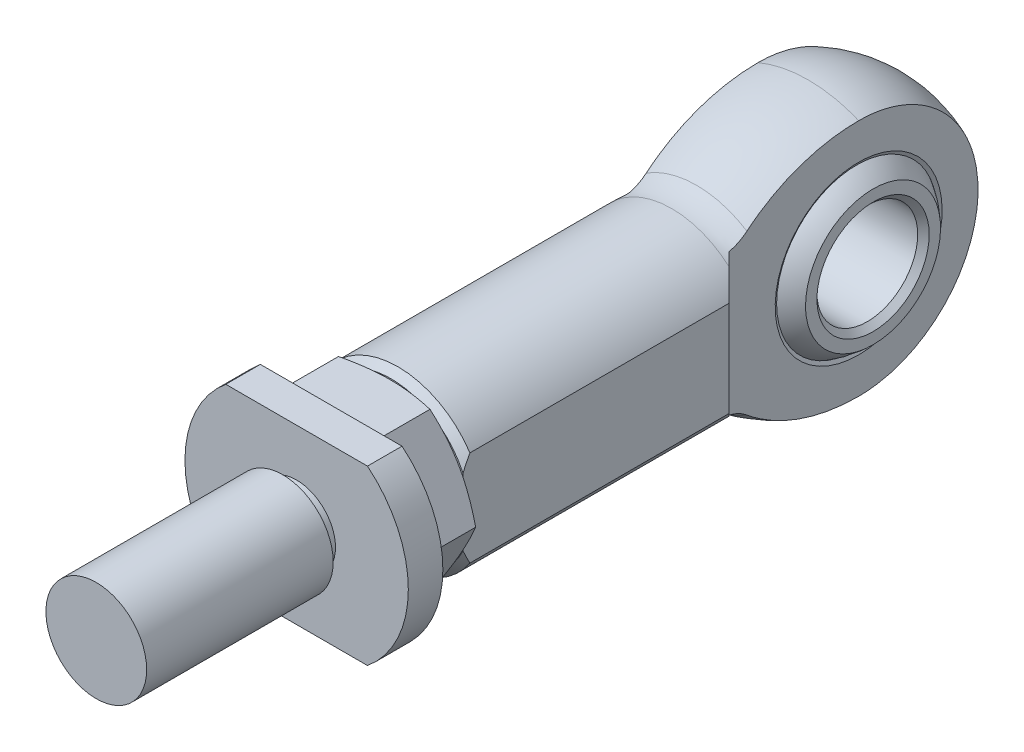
ISO-10303-21;
HEADER;
FILE_DESCRIPTION(('STEP AP214'),'2;1');
FILE_NAME('part.step','',(''),(''),'','','');
FILE_SCHEMA(('AUTOMOTIVE_DESIGN { 1 0 10303 214 1 1 1 1 }'));
ENDSEC;
DATA;
#1=APPLICATION_CONTEXT('core data for automotive mechanical design processes');
#2=APPLICATION_PROTOCOL_DEFINITION('international standard','automotive_design',2000,#1);
#3=PRODUCT_CONTEXT('',#1,'mechanical');
#4=PRODUCT('Part','Part','',(#3));
#5=PRODUCT_RELATED_PRODUCT_CATEGORY('part','',(#4));
#6=PRODUCT_DEFINITION_FORMATION('','',#4);
#7=PRODUCT_DEFINITION_CONTEXT('part definition',#1,'design');
#8=PRODUCT_DEFINITION('design','',#6,#7);
#9=PRODUCT_DEFINITION_SHAPE('','',#8);
#10=(LENGTH_UNIT() NAMED_UNIT(*) SI_UNIT(.MILLI.,.METRE.));
#11=(NAMED_UNIT(*) PLANE_ANGLE_UNIT() SI_UNIT($,.RADIAN.));
#12=(NAMED_UNIT(*) SI_UNIT($,.STERADIAN.) SOLID_ANGLE_UNIT());
#13=UNCERTAINTY_MEASURE_WITH_UNIT(LENGTH_MEASURE(1.E-05),#10,'distance_accuracy_value','');
#14=(GEOMETRIC_REPRESENTATION_CONTEXT(3) GLOBAL_UNCERTAINTY_ASSIGNED_CONTEXT((#13)) GLOBAL_UNIT_ASSIGNED_CONTEXT((#10,
#11,#12)) REPRESENTATION_CONTEXT('',''));
#15=CARTESIAN_POINT('',(0.,0.,0.));
#16=DIRECTION('',(0.,0.,1.));
#17=DIRECTION('',(1.,0.,0.));
#18=AXIS2_PLACEMENT_3D('',#15,#16,#17);
#19=CARTESIAN_POINT('',(0.,0.,-56.4387942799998));
#20=DIRECTION('',(1.,0.,0.));
#21=DIRECTION('',(0.,0.,-1.));
#22=AXIS2_PLACEMENT_3D('',#19,#20,#21);
#23=CYLINDRICAL_SURFACE('',#22,5.55625);
#24=CARTESIAN_POINT('',(-6.50239999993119,0.,-56.4387942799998));
#25=DIRECTION('',(-1.,0.,0.));
#26=DIRECTION('',(0.,0.,1.));
#27=AXIS2_PLACEMENT_3D('',#24,#25,#26);
#28=CIRCLE('',#27,5.55624999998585);
#29=CARTESIAN_POINT('',(-6.50239999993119,0.,-50.882544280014));
#30=VERTEX_POINT('',#29);
#31=EDGE_CURVE('P0_E78',#30,#30,#28,.T.);
#32=ORIENTED_EDGE('',*,*,#31,.T.);
#33=EDGE_LOOP('',(#32));
#34=FACE_BOUND('',#33,.T.);
#35=CARTESIAN_POINT('',(6.50239999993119,0.,-56.4387942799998));
#36=DIRECTION('',(1.,0.,0.));
#37=DIRECTION('',(0.,0.,1.));
#38=AXIS2_PLACEMENT_3D('',#35,#36,#37);
#39=CIRCLE('',#38,5.55624999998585);
#40=CARTESIAN_POINT('',(6.50239999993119,0.,-50.882544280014));
#41=VERTEX_POINT('',#40);
#42=EDGE_CURVE('P0_E76',#41,#41,#39,.T.);
#43=ORIENTED_EDGE('',*,*,#42,.T.);
#44=EDGE_LOOP('',(#43));
#45=FACE_BOUND('',#44,.T.);
#46=ADVANCED_FACE('P0_F15',(#34,#45),#23,.F.);
#47=CARTESIAN_POINT('',(-7.13739999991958,0.,-56.4387942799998));
#48=DIRECTION('',(-1.,0.,0.));
#49=DIRECTION('',(0.,0.,1.));
#50=AXIS2_PLACEMENT_3D('',#47,#48,#49);
#51=CONICAL_SURFACE('',#50,6.19124999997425,0.785398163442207);
#52=ORIENTED_EDGE('',*,*,#31,.F.);
#53=EDGE_LOOP('',(#52));
#54=FACE_BOUND('',#53,.T.);
#55=CARTESIAN_POINT('',(-7.13739999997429,0.,-56.4387942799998));
#56=DIRECTION('',(-1.,0.,0.));
#57=DIRECTION('',(0.,0.,1.));
#58=AXIS2_PLACEMENT_3D('',#55,#56,#57);
#59=CIRCLE('',#58,6.19125000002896);
#60=CARTESIAN_POINT('',(-7.13739999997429,0.,-50.2475442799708));
#61=VERTEX_POINT('',#60);
#62=EDGE_CURVE('P0_E21',#61,#61,#59,.T.);
#63=ORIENTED_EDGE('',*,*,#62,.T.);
#64=EDGE_LOOP('',(#63));
#65=FACE_BOUND('',#64,.T.);
#66=ADVANCED_FACE('P0_F68',(#54,#65),#51,.F.);
#67=CARTESIAN_POINT('',(7.13739999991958,0.,-56.4387942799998));
#68=DIRECTION('',(1.,0.,0.));
#69=DIRECTION('',(0.,0.,-1.));
#70=AXIS2_PLACEMENT_3D('',#67,#68,#69);
#71=CONICAL_SURFACE('',#70,6.19124999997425,0.785398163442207);
#72=ORIENTED_EDGE('',*,*,#42,.F.);
#73=EDGE_LOOP('',(#72));
#74=FACE_BOUND('',#73,.T.);
#75=CARTESIAN_POINT('',(7.13739999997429,0.,-56.4387942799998));
#76=DIRECTION('',(1.,0.,0.));
#77=DIRECTION('',(0.,0.,-1.));
#78=AXIS2_PLACEMENT_3D('',#75,#76,#77);
#79=CIRCLE('',#78,6.19125000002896);
#80=CARTESIAN_POINT('',(7.13739999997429,0.,-62.6300442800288));
#81=VERTEX_POINT('',#80);
#82=EDGE_CURVE('P0_E41',#81,#81,#79,.T.);
#83=ORIENTED_EDGE('',*,*,#82,.T.);
#84=EDGE_LOOP('',(#83));
#85=FACE_BOUND('',#84,.T.);
#86=ADVANCED_FACE('P0_F56',(#74,#85),#71,.F.);
#87=CARTESIAN_POINT('',(-7.1374,0.,-56.4387942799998));
#88=DIRECTION('',(1.,0.,0.));
#89=DIRECTION('',(0.,0.,-1.));
#90=AXIS2_PLACEMENT_3D('',#87,#88,#89);
#91=PLANE('',#90);
#92=CARTESIAN_POINT('',(-7.1374,0.,-63.8821211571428));
#93=CARTESIAN_POINT('',(-7.1374,0.209122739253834,-63.8821226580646));
#94=CARTESIAN_POINT('',(-7.1374,0.418220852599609,-63.8733044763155));
#95=CARTESIAN_POINT('',(-7.1374,0.835000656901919,-63.8380932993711));
#96=CARTESIAN_POINT('',(-7.1374,1.04268196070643,-63.8116956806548));
#97=CARTESIAN_POINT('',(-7.1374,1.45526472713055,-63.7414754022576));
#98=CARTESIAN_POINT('',(-7.1374,1.66016354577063,-63.6976372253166));
#99=CARTESIAN_POINT('',(-7.1374,2.06561280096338,-63.5928292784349));
#100=CARTESIAN_POINT('',(-7.1374,2.26616161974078,-63.5318532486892));
#101=CARTESIAN_POINT('',(-7.1374,2.66123701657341,-63.3932689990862));
#102=CARTESIAN_POINT('',(-7.1374,2.85576854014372,-63.3156748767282));
#103=CARTESIAN_POINT('',(-7.1374,3.23767444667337,-63.1443439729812));
#104=CARTESIAN_POINT('',(-7.13739999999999,3.42504616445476,-63.050601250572));
#105=CARTESIAN_POINT('',(-7.13740000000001,3.79114275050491,-62.8477045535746));
#106=CARTESIAN_POINT('',(-7.13740000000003,3.96987139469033,-62.7385573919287));
#107=CARTESIAN_POINT('',(-7.13739999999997,4.31750265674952,-62.5055946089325));
#108=CARTESIAN_POINT('',(-7.13739999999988,4.48640512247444,-62.3817787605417));
#109=CARTESIAN_POINT('',(-7.13739999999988,4.81319441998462,-62.1203488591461));
#110=CARTESIAN_POINT('',(-7.13739999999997,4.97108031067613,-61.9827336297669));
#111=CARTESIAN_POINT('',(-7.13740000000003,5.27470181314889,-61.6946886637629));
#112=CARTESIAN_POINT('',(-7.1374,5.42043713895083,-61.5442586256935));
#113=CARTESIAN_POINT('',(-7.1374,5.69869699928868,-61.2316790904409));
#114=CARTESIAN_POINT('',(-7.13740000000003,5.8312234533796,-61.0695313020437));
#115=CARTESIAN_POINT('',(-7.13739999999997,6.08219130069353,-60.734591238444));
#116=CARTESIAN_POINT('',(-7.13739999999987,6.20062780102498,-60.56179529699));
#117=CARTESIAN_POINT('',(-7.13739999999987,6.4224783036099,-60.2069054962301));
#118=CARTESIAN_POINT('',(-7.13739999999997,6.52589794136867,-60.0248151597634));
#119=CARTESIAN_POINT('',(-7.13740000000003,6.71706815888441,-59.6525019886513));
#120=CARTESIAN_POINT('',(-7.1374,6.80481293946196,-59.4622761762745));
#121=CARTESIAN_POINT('',(-7.1374,6.96394696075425,-59.0751454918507));
#122=CARTESIAN_POINT('',(-7.13740000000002,7.03533937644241,-58.8782419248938));
#123=CARTESIAN_POINT('',(-7.13739999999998,7.16128395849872,-58.4791173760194));
#124=CARTESIAN_POINT('',(-7.13739999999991,7.21583586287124,-58.2768963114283));
#125=CARTESIAN_POINT('',(-7.13739999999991,7.30770926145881,-57.8685810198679));
#126=CARTESIAN_POINT('',(-7.13739999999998,7.34503105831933,-57.6624868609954));
#127=CARTESIAN_POINT('',(-7.13740000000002,7.40218099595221,-57.2478822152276));
#128=CARTESIAN_POINT('',(-7.13740000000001,7.42200872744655,-57.0393716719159));
#129=CARTESIAN_POINT('',(-7.13739999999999,7.44402603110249,-56.6214605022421));
#130=CARTESIAN_POINT('',(-7.1374,7.44621889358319,-56.4120600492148));
#131=CARTESIAN_POINT('',(-7.1374,7.43295720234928,-55.9937460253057));
#132=CARTESIAN_POINT('',(-7.1374,7.41749653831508,-55.7848326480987));
#133=CARTESIAN_POINT('',(-7.1374,7.36903650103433,-55.3691258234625));
#134=CARTESIAN_POINT('',(-7.1374,7.33604339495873,-55.1623316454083));
#135=CARTESIAN_POINT('',(-7.1374,7.25274141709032,-54.7521811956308));
#136=CARTESIAN_POINT('',(-7.1374,7.20242615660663,-54.5488262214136));
#137=CARTESIAN_POINT('',(-7.1374,7.08485157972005,-54.1471173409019));
#138=CARTESIAN_POINT('',(-7.1374,7.01759550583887,-53.9487624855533));
#139=CARTESIAN_POINT('',(-7.1374,6.86661151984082,-53.5584205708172));
#140=CARTESIAN_POINT('',(-7.1374,6.78288335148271,-53.3664336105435));
#141=CARTESIAN_POINT('',(-7.1374,6.59955283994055,-52.9901993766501));
#142=CARTESIAN_POINT('',(-7.1374,6.49995081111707,-52.8059519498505));
#143=CARTESIAN_POINT('',(-7.1374,6.28557730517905,-52.4464985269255));
#144=CARTESIAN_POINT('',(-7.1374,6.17080547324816,-52.2712927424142));
#145=CARTESIAN_POINT('',(-7.1374,5.92693148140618,-51.931203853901));
#146=CARTESIAN_POINT('',(-7.1374,5.79783197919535,-51.7663188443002));
#147=CARTESIAN_POINT('',(-7.1374,5.5261605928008,-51.4479549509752));
#148=CARTESIAN_POINT('',(-7.1374,5.38358405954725,-51.2944800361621));
#149=CARTESIAN_POINT('',(-7.1374,5.0860455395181,-51.0001355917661));
#150=CARTESIAN_POINT('',(-7.1374,4.93108799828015,-50.8592615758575));
#151=CARTESIAN_POINT('',(-7.1374,4.60985257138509,-50.5910388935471));
#152=CARTESIAN_POINT('',(-7.1374,4.44357052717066,-50.46369524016));
#153=CARTESIAN_POINT('',(-7.1374,3.92958368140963,-50.1034898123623));
#154=CARTESIAN_POINT('',(-7.1374,3.56641448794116,-49.8921339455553));
#155=CARTESIAN_POINT('',(-7.1374,2.80993865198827,-49.5335186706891));
#156=CARTESIAN_POINT('',(-7.1374,2.41663201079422,-49.3862592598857));
#157=CARTESIAN_POINT('',(-7.1374,1.61083062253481,-49.1598253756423));
#158=CARTESIAN_POINT('',(-7.1374,1.19833587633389,-49.0806508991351));
#159=CARTESIAN_POINT('',(-7.1374,0.365908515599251,-48.9926950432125));
#160=CARTESIAN_POINT('',(-7.1374,-0.0540240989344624,-48.9839136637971));
#161=CARTESIAN_POINT('',(-7.1374,-0.88935404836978,-49.0369424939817));
#162=CARTESIAN_POINT('',(-7.1374,-1.30475138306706,-49.0987527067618));
#163=CARTESIAN_POINT('',(-7.1374,-2.1194696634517,-49.2913526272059));
#164=CARTESIAN_POINT('',(-7.1374,-2.51879060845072,-49.4221423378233));
#165=CARTESIAN_POINT('',(-7.1374,-3.0967069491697,-49.6669752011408));
#166=CARTESIAN_POINT('',(-7.1374,-3.28593071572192,-49.7567554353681));
#167=CARTESIAN_POINT('',(-7.1374,-3.65612851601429,-49.9519199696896));
#168=CARTESIAN_POINT('',(-7.1374,-3.83710556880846,-50.0572984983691));
#169=CARTESIAN_POINT('',(-7.1374,-4.18958894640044,-50.2829603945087));
#170=CARTESIAN_POINT('',(-7.1374,-4.36109186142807,-50.4032490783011));
#171=CARTESIAN_POINT('',(-7.1374,-4.69329914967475,-50.6578060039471));
#172=CARTESIAN_POINT('',(-7.1374,-4.85400723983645,-50.7920693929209));
#173=CARTESIAN_POINT('',(-7.1374,-5.16357128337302,-51.073680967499));
#174=CARTESIAN_POINT('',(-7.1374,-5.31242503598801,-51.2210315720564));
#175=CARTESIAN_POINT('',(-7.1374,-5.5971870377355,-51.5277453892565));
#176=CARTESIAN_POINT('',(-7.1374,-5.73309558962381,-51.6871083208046));
#177=CARTESIAN_POINT('',(-7.1374,-5.9910071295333,-52.0167200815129));
#178=CARTESIAN_POINT('',(-7.1374,-6.11300984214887,-52.1869691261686));
#179=CARTESIAN_POINT('',(-7.1374,-6.34223751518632,-52.5371371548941));
#180=CARTESIAN_POINT('',(-7.1374,-6.44946270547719,-52.7170559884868));
#181=CARTESIAN_POINT('',(-7.1374,-6.6483943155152,-53.0853222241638));
#182=CARTESIAN_POINT('',(-7.1374,-6.74009776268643,-53.2736712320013));
#183=CARTESIAN_POINT('',(-7.1374,-6.90727780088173,-53.6573552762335));
#184=CARTESIAN_POINT('',(-7.1374,-6.982760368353,-53.8526877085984));
#185=CARTESIAN_POINT('',(-7.1374,-7.11702908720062,-54.2490870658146));
#186=CARTESIAN_POINT('',(-7.1374,-7.17580926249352,-54.4501560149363));
#187=CARTESIAN_POINT('',(-7.1374,-7.27620177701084,-54.856461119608));
#188=CARTESIAN_POINT('',(-7.1374,-7.31782005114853,-55.061695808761));
#189=CARTESIAN_POINT('',(-7.1374,-7.38362842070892,-55.4749799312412));
#190=CARTESIAN_POINT('',(-7.1374,-7.40781526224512,-55.6830298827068));
#191=CARTESIAN_POINT('',(-7.1374,-7.43857577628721,-56.1004228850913));
#192=CARTESIAN_POINT('',(-7.1374,-7.44514986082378,-56.3097659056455));
#193=CARTESIAN_POINT('',(-7.1374,-7.44063927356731,-56.7282653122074));
#194=CARTESIAN_POINT('',(-7.1374,-7.42955429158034,-56.9374216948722));
#195=CARTESIAN_POINT('',(-7.1374,-7.38980411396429,-57.3540538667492));
#196=CARTESIAN_POINT('',(-7.1374,-7.36113919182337,-57.5615296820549));
#197=CARTESIAN_POINT('',(-7.1374,-7.28642587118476,-57.9733691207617));
#198=CARTESIAN_POINT('',(-7.1374,-7.24037409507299,-58.1777321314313));
#199=CARTESIAN_POINT('',(-7.1374,-7.1312352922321,-58.581776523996));
#200=CARTESIAN_POINT('',(-7.1374,-7.06815455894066,-58.7814596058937));
#201=CARTESIAN_POINT('',(-7.1374,-6.92537164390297,-59.1748772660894));
#202=CARTESIAN_POINT('',(-7.1374,-6.84566321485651,-59.3686095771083));
#203=CARTESIAN_POINT('',(-7.1374,-6.67023662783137,-59.7486032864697));
#204=CARTESIAN_POINT('',(-7.1374,-6.57452402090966,-59.9348672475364));
#205=CARTESIAN_POINT('',(-7.1374,-6.36773495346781,-60.2986979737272));
#206=CARTESIAN_POINT('',(-7.1374,-6.25665625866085,-60.4762634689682));
#207=CARTESIAN_POINT('',(-7.1374,-6.0199381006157,-60.8214017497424));
#208=CARTESIAN_POINT('',(-7.1374,-5.89429898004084,-60.9889747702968));
#209=CARTESIAN_POINT('',(-7.1374,-5.62936232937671,-61.3129275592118));
#210=CARTESIAN_POINT('',(-7.1374,-5.49006596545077,-61.4693082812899));
#211=CARTESIAN_POINT('',(-7.1374,-5.19879823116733,-61.7697783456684));
#212=CARTESIAN_POINT('',(-7.1374,-5.04682705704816,-61.9138678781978));
#213=CARTESIAN_POINT('',(-7.1374,-4.73121822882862,-62.1887948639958));
#214=CARTESIAN_POINT('',(-7.1374,-4.56757545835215,-62.3196264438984));
#215=CARTESIAN_POINT('',(-7.1374,-4.22990946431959,-62.5669886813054));
#216=CARTESIAN_POINT('',(-7.1374,-4.05589008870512,-62.6835245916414));
#217=CARTESIAN_POINT('',(-7.1374,-3.69850167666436,-62.9016155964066));
#218=CARTESIAN_POINT('',(-7.1374,-3.51512485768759,-63.003157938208));
#219=CARTESIAN_POINT('',(-7.1374,-3.14053273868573,-63.1903865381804));
#220=CARTESIAN_POINT('',(-7.1374,-2.94932032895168,-63.2760785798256));
#221=CARTESIAN_POINT('',(-7.1374,-2.5605237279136,-63.4309741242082));
#222=CARTESIAN_POINT('',(-7.1374,-2.3629453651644,-63.5001922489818));
#223=CARTESIAN_POINT('',(-7.1374,-1.96272783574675,-63.621728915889));
#224=CARTESIAN_POINT('',(-7.1374,-1.76009001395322,-63.6740518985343));
#225=CARTESIAN_POINT('',(-7.1374,-1.30018767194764,-63.7723340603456));
#226=CARTESIAN_POINT('',(-7.1374,-1.0418781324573,-63.8134692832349));
#227=CARTESIAN_POINT('',(-7.1374,-0.522366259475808,-63.8683618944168));
#228=CARTESIAN_POINT('',(-7.1374,-0.261163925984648,-63.8821192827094));
#229=CARTESIAN_POINT('',(-7.1374,0.,-63.8821211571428));
#230=B_SPLINE_CURVE_WITH_KNOTS('',3,(#92,#93,#94,#95,#96,#97,#98,#99,#100,#101,#102,#103,#104,
#105,#106,#107,#108,#109,#110,#111,#112,#113,#114,#115,#116,#117,#118,#119,#120,#121,#122,#123,
#124,#125,#126,#127,#128,#129,#130,#131,#132,#133,#134,#135,#136,#137,#138,#139,#140,#141,#142,
#143,#144,#145,#146,#147,#148,#149,#150,#151,#152,#153,#154,#155,#156,#157,#158,#159,#160,#161,
#162,#163,#164,#165,#166,#167,#168,#169,#170,#171,#172,#173,#174,#175,#176,#177,#178,#179,#180,
#181,#182,#183,#184,#185,#186,#187,#188,#189,#190,#191,#192,#193,#194,#195,#196,#197,#198,#199,
#200,#201,#202,#203,#204,#205,#206,#207,#208,#209,#210,#211,#212,#213,#214,#215,#216,#217,#218,
#219,#220,#221,#222,#223,#224,#225,#226,#227,#228,#229),.UNSPECIFIED.,.T.,.F.,(4,2,2,2,2,2,2,2,
2,2,2,2,2,2,2,2,2,2,2,2,2,2,2,2,2,2,2,2,2,2,2,2,2,2,2,2,2,2,2,2,2,2,2,2,2,2,2,2,2,2,2,2,2,2,2,2,
2,2,2,2,2,2,2,2,2,2,2,2,4),(0.,0.627140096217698,1.25444520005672,1.88230968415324,
2.51040380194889,3.13796718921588,3.76576195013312,4.39327992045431,5.02080760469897,
5.64838883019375,6.27598482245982,6.90348947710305,7.53121140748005,8.15869715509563,
8.78641457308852,9.41401001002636,10.0416152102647,10.6692093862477,11.2968182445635,
11.9243100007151,12.5520190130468,13.1795037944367,13.8072202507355,14.4348166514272,
15.0624228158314,15.6900165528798,16.317624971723,16.9451171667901,17.5728266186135,
18.2003116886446,18.8280284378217,20.0821144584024,21.3362004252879,22.5902863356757,
23.8443722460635,25.0984582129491,26.3525442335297,26.9802609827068,27.607746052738,
28.2354555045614,28.8629476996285,29.4905561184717,30.11814985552,30.7457560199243,
31.373352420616,32.0010688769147,32.6285536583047,33.2562626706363,33.8837544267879,
34.5113632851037,35.1389574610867,35.766562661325,36.3941580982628,37.0218755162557,
37.6493612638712,38.2770831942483,38.9045878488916,39.5321838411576,40.1597650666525,
40.7872927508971,41.4148107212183,42.0426054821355,42.6701688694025,43.2982629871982,
43.9261274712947,44.5534325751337,45.1805726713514,45.9637795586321,46.7469864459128),.UNSPECIFIED.);
#231=CARTESIAN_POINT('',(-7.1374,0.,-63.8821211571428));
#232=VERTEX_POINT('',#231);
#233=EDGE_CURVE('P0_E26',#232,#232,#230,.T.);
#234=ORIENTED_EDGE('',*,*,#233,.F.);
#235=EDGE_LOOP('',(#234));
#236=FACE_BOUND('',#235,.T.);
#237=ORIENTED_EDGE('',*,*,#62,.F.);
#238=EDGE_LOOP('',(#237));
#239=FACE_BOUND('',#238,.T.);
#240=ADVANCED_FACE('P0_F52',(#236,#239),#91,.F.);
#241=CARTESIAN_POINT('',(7.1374,0.,-56.4387942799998));
#242=DIRECTION('',(-1.,0.,0.));
#243=DIRECTION('',(0.,0.,1.));
#244=AXIS2_PLACEMENT_3D('',#241,#242,#243);
#245=PLANE('',#244);
#246=CARTESIAN_POINT('',(7.1374,0.,-48.9954674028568));
#247=CARTESIAN_POINT('',(7.13739999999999,0.209122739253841,-48.995465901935));
#248=CARTESIAN_POINT('',(7.1374,0.418220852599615,-49.004284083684));
#249=CARTESIAN_POINT('',(7.1374,0.835000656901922,-49.0394952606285));
#250=CARTESIAN_POINT('',(7.1374,1.04268196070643,-49.0658928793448));
#251=CARTESIAN_POINT('',(7.1374,1.45526472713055,-49.136113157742));
#252=CARTESIAN_POINT('',(7.1374,1.66016354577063,-49.179951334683));
#253=CARTESIAN_POINT('',(7.1374,2.06561280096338,-49.2847592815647));
#254=CARTESIAN_POINT('',(7.1374,2.26616161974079,-49.3457353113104));
#255=CARTESIAN_POINT('',(7.1374,2.66123701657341,-49.4843195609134));
#256=CARTESIAN_POINT('',(7.1374,2.85576854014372,-49.5619136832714));
#257=CARTESIAN_POINT('',(7.1374,3.23767444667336,-49.7332445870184));
#258=CARTESIAN_POINT('',(7.1374,3.42504616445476,-49.8269873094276));
#259=CARTESIAN_POINT('',(7.1374,3.79114275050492,-50.0298840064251));
#260=CARTESIAN_POINT('',(7.1374,3.96987139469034,-50.1390311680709));
#261=CARTESIAN_POINT('',(7.1374,4.31750265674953,-50.3719939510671));
#262=CARTESIAN_POINT('',(7.1374,4.48640512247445,-50.4958097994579));
#263=CARTESIAN_POINT('',(7.1374,4.81319441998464,-50.7572397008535));
#264=CARTESIAN_POINT('',(7.1374,4.97108031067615,-50.8948549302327));
#265=CARTESIAN_POINT('',(7.1374,5.27470181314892,-51.1828998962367));
#266=CARTESIAN_POINT('',(7.1374,5.42043713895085,-51.3333299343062));
#267=CARTESIAN_POINT('',(7.1374,5.69869699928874,-51.6459094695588));
#268=CARTESIAN_POINT('',(7.1374,5.83122345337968,-51.808057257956));
#269=CARTESIAN_POINT('',(7.1374,6.08219130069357,-52.1429973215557));
#270=CARTESIAN_POINT('',(7.1374,6.20062780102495,-52.3157932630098));
#271=CARTESIAN_POINT('',(7.1374,6.42247830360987,-52.6706830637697));
#272=CARTESIAN_POINT('',(7.1374,6.5258979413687,-52.8527734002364));
#273=CARTESIAN_POINT('',(7.1374,6.71706815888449,-53.2250865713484));
#274=CARTESIAN_POINT('',(7.1374,6.80481293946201,-53.4153123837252));
#275=CARTESIAN_POINT('',(7.1374,6.96394696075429,-53.8024430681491));
#276=CARTESIAN_POINT('',(7.1374,7.03533937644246,-53.9993466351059));
#277=CARTESIAN_POINT('',(7.1374,7.16128395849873,-54.3984711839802));
#278=CARTESIAN_POINT('',(7.1374,7.21583586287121,-54.6006922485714));
#279=CARTESIAN_POINT('',(7.1374,7.30770926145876,-55.0090075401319));
#280=CARTESIAN_POINT('',(7.1374,7.34503105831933,-55.2151016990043));
#281=CARTESIAN_POINT('',(7.1374,7.40218099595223,-55.6297063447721));
#282=CARTESIAN_POINT('',(7.1374,7.42200872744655,-55.8382168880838));
#283=CARTESIAN_POINT('',(7.1374,7.44402603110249,-56.2561280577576));
#284=CARTESIAN_POINT('',(7.1374,7.44621889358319,-56.4655285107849));
#285=CARTESIAN_POINT('',(7.1374,7.43295720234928,-56.883842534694));
#286=CARTESIAN_POINT('',(7.1374,7.41749653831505,-57.092755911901));
#287=CARTESIAN_POINT('',(7.1374,7.3690365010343,-57.5084627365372));
#288=CARTESIAN_POINT('',(7.1374,7.33604339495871,-57.7152569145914));
#289=CARTESIAN_POINT('',(7.1374,7.25274141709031,-58.1254073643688));
#290=CARTESIAN_POINT('',(7.1374,7.20242615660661,-58.3287623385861));
#291=CARTESIAN_POINT('',(7.1374,7.08485157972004,-58.7304712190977));
#292=CARTESIAN_POINT('',(7.1374,7.01759550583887,-58.9288260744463));
#293=CARTESIAN_POINT('',(7.1374,6.86661151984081,-59.3191679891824));
#294=CARTESIAN_POINT('',(7.1374,6.78288335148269,-59.5111549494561));
#295=CARTESIAN_POINT('',(7.1374,6.59955283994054,-59.8873891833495));
#296=CARTESIAN_POINT('',(7.1374,6.49995081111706,-60.0716366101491));
#297=CARTESIAN_POINT('',(7.1374,6.28557730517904,-60.4310900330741));
#298=CARTESIAN_POINT('',(7.1374,6.17080547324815,-60.6062958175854));
#299=CARTESIAN_POINT('',(7.1374,5.92693148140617,-60.9463847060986));
#300=CARTESIAN_POINT('',(7.1374,5.79783197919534,-61.1112697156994));
#301=CARTESIAN_POINT('',(7.1374,5.52616059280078,-61.4296336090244));
#302=CARTESIAN_POINT('',(7.1374,5.38358405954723,-61.5831085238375));
#303=CARTESIAN_POINT('',(7.1374,5.08604553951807,-61.8774529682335));
#304=CARTESIAN_POINT('',(7.1374,4.93108799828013,-62.0183269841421));
#305=CARTESIAN_POINT('',(7.1374,4.60985257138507,-62.2865496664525));
#306=CARTESIAN_POINT('',(7.1374,4.44357052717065,-62.4138933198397));
#307=CARTESIAN_POINT('',(7.1374,3.92958368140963,-62.7740987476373));
#308=CARTESIAN_POINT('',(7.1374,3.56641448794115,-62.9854546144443));
#309=CARTESIAN_POINT('',(7.1374,2.80993865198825,-63.3440698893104));
#310=CARTESIAN_POINT('',(7.1374,2.41663201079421,-63.4913293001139));
#311=CARTESIAN_POINT('',(7.1374,1.6108306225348,-63.7177631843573));
#312=CARTESIAN_POINT('',(7.1374,1.19833587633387,-63.7969376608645));
#313=CARTESIAN_POINT('',(7.1374,0.365908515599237,-63.8848935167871));
#314=CARTESIAN_POINT('',(7.1374,-0.0540240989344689,-63.8936748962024));
#315=CARTESIAN_POINT('',(7.1374,-0.889354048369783,-63.8406460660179));
#316=CARTESIAN_POINT('',(7.1374,-1.30475138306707,-63.7788358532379));
#317=CARTESIAN_POINT('',(7.1374,-2.11946966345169,-63.5862359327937));
#318=CARTESIAN_POINT('',(7.1374,-2.51879060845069,-63.4554462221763));
#319=CARTESIAN_POINT('',(7.1374,-3.09670694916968,-63.2106133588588));
#320=CARTESIAN_POINT('',(7.1374,-3.28593071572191,-63.1208331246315));
#321=CARTESIAN_POINT('',(7.1374,-3.65612851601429,-62.92566859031));
#322=CARTESIAN_POINT('',(7.1374,-3.83710556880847,-62.8202900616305));
#323=CARTESIAN_POINT('',(7.1374,-4.18958894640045,-62.594628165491));
#324=CARTESIAN_POINT('',(7.1374,-4.36109186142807,-62.4743394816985));
#325=CARTESIAN_POINT('',(7.1374,-4.69329914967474,-62.2197825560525));
#326=CARTESIAN_POINT('',(7.1374,-4.85400723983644,-62.0855191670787));
#327=CARTESIAN_POINT('',(7.1374,-5.16357128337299,-61.8039075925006));
#328=CARTESIAN_POINT('',(7.1374,-5.31242503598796,-61.6565569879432));
#329=CARTESIAN_POINT('',(7.1374,-5.59718703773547,-61.3498431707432));
#330=CARTESIAN_POINT('',(7.1374,-5.73309558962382,-61.1904802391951));
#331=CARTESIAN_POINT('',(7.1374,-5.99100712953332,-60.8608684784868));
#332=CARTESIAN_POINT('',(7.1374,-6.11300984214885,-60.6906194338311));
#333=CARTESIAN_POINT('',(7.1374,-6.34223751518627,-60.3404514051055));
#334=CARTESIAN_POINT('',(7.1374,-6.44946270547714,-60.1605325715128));
#335=CARTESIAN_POINT('',(7.1374,-6.64839431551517,-59.7922663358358));
#336=CARTESIAN_POINT('',(7.1374,-6.7400977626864,-59.6039173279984));
#337=CARTESIAN_POINT('',(7.1374,-6.90727780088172,-59.2202332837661));
#338=CARTESIAN_POINT('',(7.1374,-6.98276036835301,-59.0249008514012));
#339=CARTESIAN_POINT('',(7.1374,-7.11702908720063,-58.628501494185));
#340=CARTESIAN_POINT('',(7.1374,-7.17580926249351,-58.4274325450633));
#341=CARTESIAN_POINT('',(7.1374,-7.27620177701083,-58.0211274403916));
#342=CARTESIAN_POINT('',(7.1374,-7.31782005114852,-57.8158927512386));
#343=CARTESIAN_POINT('',(7.1374,-7.38362842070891,-57.4026086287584));
#344=CARTESIAN_POINT('',(7.1374,-7.40781526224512,-57.1945586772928));
#345=CARTESIAN_POINT('',(7.1374,-7.4385757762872,-56.7771656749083));
#346=CARTESIAN_POINT('',(7.1374,-7.44514986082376,-56.5678226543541));
#347=CARTESIAN_POINT('',(7.1374,-7.44063927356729,-56.1493232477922));
#348=CARTESIAN_POINT('',(7.1374,-7.42955429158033,-55.9401668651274));
#349=CARTESIAN_POINT('',(7.1374,-7.38980411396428,-55.5235346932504));
#350=CARTESIAN_POINT('',(7.1374,-7.36113919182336,-55.3160588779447));
#351=CARTESIAN_POINT('',(7.1374,-7.28642587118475,-54.9042194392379));
#352=CARTESIAN_POINT('',(7.1374,-7.24037409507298,-54.6998564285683));
#353=CARTESIAN_POINT('',(7.1374,-7.13123529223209,-54.2958120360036));
#354=CARTESIAN_POINT('',(7.1374,-7.06815455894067,-54.0961289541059));
#355=CARTESIAN_POINT('',(7.1374,-6.92537164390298,-53.7027112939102));
#356=CARTESIAN_POINT('',(7.1374,-6.8456632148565,-53.5089789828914));
#357=CARTESIAN_POINT('',(7.1374,-6.67023662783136,-53.1289852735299));
#358=CARTESIAN_POINT('',(7.13739999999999,-6.57452402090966,-52.9427213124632));
#359=CARTESIAN_POINT('',(7.13740000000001,-6.36773495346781,-52.5788905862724));
#360=CARTESIAN_POINT('',(7.13740000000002,-6.25665625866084,-52.4013250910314));
#361=CARTESIAN_POINT('',(7.13739999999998,-6.01993810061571,-52.0561868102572));
#362=CARTESIAN_POINT('',(7.13739999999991,-5.89429898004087,-51.8886137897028));
#363=CARTESIAN_POINT('',(7.13739999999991,-5.62936232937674,-51.5646610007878));
#364=CARTESIAN_POINT('',(7.13739999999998,-5.49006596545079,-51.4082802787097));
#365=CARTESIAN_POINT('',(7.13740000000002,-5.19879823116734,-51.1078102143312));
#366=CARTESIAN_POINT('',(7.1374,-5.04682705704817,-50.9637206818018));
#367=CARTESIAN_POINT('',(7.1374,-4.73121822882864,-50.6887936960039));
#368=CARTESIAN_POINT('',(7.13740000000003,-4.56757545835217,-50.5579621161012));
#369=CARTESIAN_POINT('',(7.13739999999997,-4.22990946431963,-50.3105998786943));
#370=CARTESIAN_POINT('',(7.13739999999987,-4.05589008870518,-50.1940639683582));
#371=CARTESIAN_POINT('',(7.13739999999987,-3.69850167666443,-49.975972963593));
#372=CARTESIAN_POINT('',(7.13739999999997,-3.51512485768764,-49.8744306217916));
#373=CARTESIAN_POINT('',(7.13740000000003,-3.14053273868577,-49.6872020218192));
#374=CARTESIAN_POINT('',(7.1374,-2.94932032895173,-49.6015099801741));
#375=CARTESIAN_POINT('',(7.1374,-2.56052372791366,-49.4466144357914));
#376=CARTESIAN_POINT('',(7.13740000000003,-2.36294536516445,-49.3773963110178));
#377=CARTESIAN_POINT('',(7.13739999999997,-1.9627278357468,-49.2558596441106));
#378=CARTESIAN_POINT('',(7.13739999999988,-1.76009001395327,-49.2035366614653));
#379=CARTESIAN_POINT('',(7.13739999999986,-1.30018767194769,-49.105254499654));
#380=CARTESIAN_POINT('',(7.13739999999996,-1.04187813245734,-49.0641192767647));
#381=CARTESIAN_POINT('',(7.13740000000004,-0.522366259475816,-49.0092266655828));
#382=CARTESIAN_POINT('',(7.13740000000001,-0.261163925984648,-48.9954692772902));
#383=CARTESIAN_POINT('',(7.1374,0.,-48.9954674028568));
#384=B_SPLINE_CURVE_WITH_KNOTS('',3,(#246,#247,#248,#249,#250,#251,#252,#253,#254,#255,#256,
#257,#258,#259,#260,#261,#262,#263,#264,#265,#266,#267,#268,#269,#270,#271,#272,#273,#274,#275,
#276,#277,#278,#279,#280,#281,#282,#283,#284,#285,#286,#287,#288,#289,#290,#291,#292,#293,#294,
#295,#296,#297,#298,#299,#300,#301,#302,#303,#304,#305,#306,#307,#308,#309,#310,#311,#312,#313,
#314,#315,#316,#317,#318,#319,#320,#321,#322,#323,#324,#325,#326,#327,#328,#329,#330,#331,#332,
#333,#334,#335,#336,#337,#338,#339,#340,#341,#342,#343,#344,#345,#346,#347,#348,#349,#350,#351,
#352,#353,#354,#355,#356,#357,#358,#359,#360,#361,#362,#363,#364,#365,#366,#367,#368,#369,#370,
#371,#372,#373,#374,#375,#376,#377,#378,#379,#380,#381,#382,#383),.UNSPECIFIED.,.T.,.F.,(4,2,2,
2,2,2,2,2,2,2,2,2,2,2,2,2,2,2,2,2,2,2,2,2,2,2,2,2,2,2,2,2,2,2,2,2,2,2,2,2,2,2,2,2,2,2,2,2,2,2,2,
2,2,2,2,2,2,2,2,2,2,2,2,2,2,2,2,2,4),(0.,0.627140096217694,1.25444520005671,1.88230968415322,
2.51040380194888,3.13796718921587,3.76576195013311,4.39327992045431,5.02080760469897,
5.64838883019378,6.27598482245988,6.90348947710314,7.53121140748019,8.15869715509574,
8.78641457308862,9.41401001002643,10.0416152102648,10.6692093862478,11.2968182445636,
11.9243100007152,12.5520190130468,13.1795037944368,13.8072202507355,14.4348166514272,
15.0624228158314,15.6900165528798,16.317624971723,16.94511716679,17.5728266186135,
18.2003116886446,18.8280284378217,20.0821144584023,21.3362004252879,22.5902863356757,
23.8443722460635,25.098458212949,26.3525442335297,26.9802609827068,27.607746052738,
28.2354555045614,28.8629476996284,29.4905561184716,30.1181498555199,30.7457560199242,
31.3733524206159,32.0010688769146,32.6285536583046,33.2562626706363,33.8837544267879,
34.5113632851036,35.1389574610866,35.766562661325,36.3941580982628,37.0218755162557,
37.6493612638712,38.2770831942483,38.9045878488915,39.5321838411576,40.1597650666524,
40.7872927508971,41.4148107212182,42.0426054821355,42.6701688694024,43.2982629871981,
43.9261274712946,44.5534325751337,45.1805726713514,45.9637795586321,46.7469864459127),.UNSPECIFIED.);
#385=CARTESIAN_POINT('',(7.1374,0.,-48.9954674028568));
#386=VERTEX_POINT('',#385);
#387=EDGE_CURVE('P0_E10',#386,#386,#384,.T.);
#388=ORIENTED_EDGE('',*,*,#387,.F.);
#389=EDGE_LOOP('',(#388));
#390=FACE_BOUND('',#389,.T.);
#391=ORIENTED_EDGE('',*,*,#82,.F.);
#392=EDGE_LOOP('',(#391));
#393=FACE_BOUND('',#392,.T.);
#394=ADVANCED_FACE('P0_F35',(#390,#393),#245,.F.);
#395=CARTESIAN_POINT('',(0.,0.,-56.4387942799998));
#396=DIRECTION('',(0.632794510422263,0.481530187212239,-0.606382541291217));
#397=DIRECTION('',(0.572409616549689,-0.818287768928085,-0.0524629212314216));
#398=AXIS2_PLACEMENT_3D('',#395,#396,#397);
#399=SPHERICAL_SURFACE('',#398,10.3124);
#400=CARTESIAN_POINT('',(-6.52563010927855,-4.96573190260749,-50.1855349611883));
#401=VERTEX_POINT('',#400);
#402=VERTEX_LOOP('',#401);
#403=FACE_BOUND('',#402,.T.);
#404=CARTESIAN_POINT('',(6.52563010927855,4.96573190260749,-62.6920535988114));
#405=VERTEX_POINT('',#404);
#406=VERTEX_LOOP('',#405);
#407=FACE_BOUND('',#406,.T.);
#408=ORIENTED_EDGE('',*,*,#387,.T.);
#409=EDGE_LOOP('',(#408));
#410=FACE_BOUND('',#409,.T.);
#411=ORIENTED_EDGE('',*,*,#233,.T.);
#412=EDGE_LOOP('',(#411));
#413=FACE_BOUND('',#412,.T.);
#414=ADVANCED_FACE('P0_F17',(#403,#407,#410,#413),#399,.T.);
#415=CLOSED_SHELL('',(#46,#66,#86,#240,#394,#414));
#416=MANIFOLD_SOLID_BREP('P0_B1',#415);
#417=CARTESIAN_POINT('',(-7.33957764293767,-4.23750712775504,-10.4139942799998));
#418=DIRECTION('',(0.,0.,-1.));
#419=DIRECTION('',(0.499999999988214,-0.866025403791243,0.));
#420=AXIS2_PLACEMENT_3D('',#417,#418,#419);
#421=PLANE('',#420);
#422=DIRECTION('',(0.,-1.,0.));
#423=VECTOR('',#422,1.);
#424=CARTESIAN_POINT('',(7.9375,-4.23750712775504,-10.4139942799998));
#425=LINE('',#424,#423);
#426=CARTESIAN_POINT('',(7.9375,2.97017851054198,-10.4139942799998));
#427=VERTEX_POINT('',#426);
#428=CARTESIAN_POINT('',(7.9375,-2.97017851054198,-10.4139942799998));
#429=VERTEX_POINT('',#428);
#430=EDGE_CURVE('P1_E390',#427,#429,#425,.T.);
#431=ORIENTED_EDGE('',*,*,#430,.F.);
#432=CARTESIAN_POINT('',(0.,0.,-10.4139942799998));
#433=DIRECTION('',(0.,0.,-1.));
#434=DIRECTION('',(0.499999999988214,-0.866025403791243,0.));
#435=AXIS2_PLACEMENT_3D('',#432,#433,#434);
#436=CIRCLE('',#435,8.47501425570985);
#437=EDGE_CURVE('P1_E331',#427,#429,#436,.T.);
#438=ORIENTED_EDGE('',*,*,#437,.T.);
#439=EDGE_LOOP('',(#431,#438));
#440=FACE_BOUND('',#439,.T.);
#441=ADVANCED_FACE('P1_F15',(#440),#421,.T.);
#442=DIRECTION('',(0.,1.,0.));
#443=VECTOR('',#442,1.);
#444=CARTESIAN_POINT('',(-7.9375,-4.23750712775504,-10.4139942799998));
#445=LINE('',#444,#443);
#446=CARTESIAN_POINT('',(-7.9375,-2.97017851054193,-10.4139942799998));
#447=VERTEX_POINT('',#446);
#448=CARTESIAN_POINT('',(-7.9375,2.97017851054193,-10.4139942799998));
#449=VERTEX_POINT('',#448);
#450=EDGE_CURVE('P1_E392',#447,#449,#445,.T.);
#451=ORIENTED_EDGE('',*,*,#450,.F.);
#452=EDGE_CURVE('P1_E332',#447,#449,#436,.T.);
#453=ORIENTED_EDGE('',*,*,#452,.T.);
#454=EDGE_LOOP('',(#451,#453));
#455=FACE_BOUND('',#454,.T.);
#456=ADVANCED_FACE('P1_F294',(#455),#421,.T.);
#457=CARTESIAN_POINT('',(-5.04465134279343,-8.73759243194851,-3.81));
#458=DIRECTION('',(1.02068353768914E-11,1.,0.));
#459=DIRECTION('',(-1.,1.02068353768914E-11,0.));
#460=AXIS2_PLACEMENT_3D('',#457,#458,#459);
#461=PLANE('',#460);
#462=CARTESIAN_POINT('',(5.04488228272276,-8.7375924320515,-4.56280890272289));
#463=CARTESIAN_POINT('',(4.7397641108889,-8.73759243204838,-4.49167032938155));
#464=CARTESIAN_POINT('',(4.43352011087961,-8.73759243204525,-4.42510023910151));
#465=CARTESIAN_POINT('',(3.8187339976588,-8.73759243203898,-4.30268275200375));
#466=CARTESIAN_POINT('',(3.51019073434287,-8.73759243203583,-4.24684115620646));
#467=CARTESIAN_POINT('',(2.89079904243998,-8.73759243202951,-4.14750010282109));
#468=CARTESIAN_POINT('',(2.57994872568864,-8.73759243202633,-4.10401225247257));
#469=CARTESIAN_POINT('',(1.95665449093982,-8.73759243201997,-4.03098394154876));
#470=CARTESIAN_POINT('',(1.64421088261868,-8.73759243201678,-4.00144086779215));
#471=CARTESIAN_POINT('',(1.02473847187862,-8.73759243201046,-3.95793406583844));
#472=CARTESIAN_POINT('',(0.717731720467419,-8.73759243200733,-3.94366001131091));
#473=CARTESIAN_POINT('',(0.103364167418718,-8.73759243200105,-3.93021461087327));
#474=CARTESIAN_POINT('',(-0.20399665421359,-8.73759243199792,-3.93104416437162));
#475=CARTESIAN_POINT('',(-0.818014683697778,-8.73759243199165,-3.94776417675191));
#476=CARTESIAN_POINT('',(-1.12467228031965,-8.73759243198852,-3.96364060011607));
#477=CARTESIAN_POINT('',(-1.73686691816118,-8.73759243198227,-4.0097708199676));
#478=CARTESIAN_POINT('',(-2.04240405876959,-8.73759243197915,-4.04002330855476));
#479=CARTESIAN_POINT('',(-2.57312099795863,-8.73759243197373,-4.10422152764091));
#480=CARTESIAN_POINT('',(-2.79866868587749,-8.73759243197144,-4.1351940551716));
#481=CARTESIAN_POINT('',(-3.24873300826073,-8.73759243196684,-4.20382757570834));
#482=CARTESIAN_POINT('',(-3.47324968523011,-8.73759243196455,-4.24148829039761));
#483=CARTESIAN_POINT('',(-3.92298657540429,-8.73759243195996,-4.32321091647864));
#484=CARTESIAN_POINT('',(-4.14819774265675,-8.73759243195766,-4.36732223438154));
#485=CARTESIAN_POINT('',(-4.59742929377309,-8.73759243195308,-4.46107518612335));
#486=CARTESIAN_POINT('',(-4.82144987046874,-8.73759243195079,-4.51071589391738));
#487=CARTESIAN_POINT('',(-5.04488228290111,-8.73759243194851,-4.56280890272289));
#488=B_SPLINE_CURVE_WITH_KNOTS('',3,(#462,#463,#464,#465,#466,#467,#468,#469,#470,#471,#472,
#473,#474,#475,#476,#477,#478,#479,#480,#481,#482,#483,#484,#485,#486,#487),.UNSPECIFIED.,.F.,
.F.,(4,2,2,2,2,2,2,2,2,2,2,2,4),(0.,0.93995771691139,1.88042225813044,2.82176753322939,
3.76293633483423,4.68459063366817,5.60629981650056,6.52715008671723,7.44791659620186,
8.13080975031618,8.81367449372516,9.50207371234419,10.1903578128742),.UNSPECIFIED.);
#489=CARTESIAN_POINT('',(5.04465134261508,-8.7375924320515,-4.56275505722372));
#490=VERTEX_POINT('',#489);
#491=CARTESIAN_POINT('',(-5.04465134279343,-8.73759243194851,-4.56275505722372));
#492=VERTEX_POINT('',#491);
#493=EDGE_CURVE('P1_E299',#490,#492,#488,.T.);
#494=ORIENTED_EDGE('',*,*,#493,.T.);
#495=DIRECTION('',(0.,0.,-1.));
#496=VECTOR('',#495,1.);
#497=CARTESIAN_POINT('',(-5.04465134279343,-8.73759243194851,-3.81));
#498=LINE('',#497,#496);
#499=CARTESIAN_POINT('',(-5.04465134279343,-8.73759243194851,-9.6612392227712));
#500=VERTEX_POINT('',#499);
#501=EDGE_CURVE('P1_E198',#492,#500,#498,.T.);
#502=ORIENTED_EDGE('',*,*,#501,.T.);
#503=CARTESIAN_POINT('',(-5.04488228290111,-8.73759243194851,-9.66118537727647));
#504=CARTESIAN_POINT('',(-4.73976411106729,-8.73759243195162,-9.73232395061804));
#505=CARTESIAN_POINT('',(-4.43352011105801,-8.73759243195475,-9.79889404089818));
#506=CARTESIAN_POINT('',(-3.8187339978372,-8.73759243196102,-9.921311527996));
#507=CARTESIAN_POINT('',(-3.51019073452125,-8.73759243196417,-9.97715312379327));
#508=CARTESIAN_POINT('',(-2.89079904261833,-8.73759243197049,-10.0764941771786));
#509=CARTESIAN_POINT('',(-2.57994872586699,-8.73759243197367,-10.1199820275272));
#510=CARTESIAN_POINT('',(-1.95665449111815,-8.73759243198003,-10.193010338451));
#511=CARTESIAN_POINT('',(-1.644210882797,-8.73759243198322,-10.2225534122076));
#512=CARTESIAN_POINT('',(-1.02473847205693,-8.73759243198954,-10.2660602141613));
#513=CARTESIAN_POINT('',(-0.717731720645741,-8.73759243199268,-10.2803342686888));
#514=CARTESIAN_POINT('',(-0.103364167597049,-8.73759243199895,-10.2937796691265));
#515=CARTESIAN_POINT('',(0.203996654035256,-8.73759243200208,-10.2929501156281));
#516=CARTESIAN_POINT('',(0.818014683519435,-8.73759243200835,-10.2762301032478));
#517=CARTESIAN_POINT('',(1.1246722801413,-8.73759243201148,-10.2603536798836));
#518=CARTESIAN_POINT('',(1.73686691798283,-8.73759243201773,-10.2142234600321));
#519=CARTESIAN_POINT('',(2.04240405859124,-8.73759243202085,-10.183970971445));
#520=CARTESIAN_POINT('',(2.57312099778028,-8.73759243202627,-10.1197727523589));
#521=CARTESIAN_POINT('',(2.79866868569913,-8.73759243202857,-10.0888002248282));
#522=CARTESIAN_POINT('',(3.24873300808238,-8.73759243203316,-10.0201667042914));
#523=CARTESIAN_POINT('',(3.47324968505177,-8.73759243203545,-9.9825059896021));
#524=CARTESIAN_POINT('',(3.92298657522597,-8.73759243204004,-9.9007833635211));
#525=CARTESIAN_POINT('',(4.14819774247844,-8.73759243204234,-9.85667204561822));
#526=CARTESIAN_POINT('',(4.59742929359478,-8.73759243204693,-9.76291909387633));
#527=CARTESIAN_POINT('',(4.82144987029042,-8.73759243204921,-9.71327838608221));
#528=CARTESIAN_POINT('',(5.04488228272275,-8.73759243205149,-9.66118537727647));
#529=B_SPLINE_CURVE_WITH_KNOTS('',3,(#503,#504,#505,#506,#507,#508,#509,#510,#511,#512,#513,
#514,#515,#516,#517,#518,#519,#520,#521,#522,#523,#524,#525,#526,#527,#528),.UNSPECIFIED.,.F.,
.F.,(4,2,2,2,2,2,2,2,2,2,2,2,4),(0.,0.939957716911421,1.8804222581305,2.82176753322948,
3.76293633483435,4.68459063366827,5.60629981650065,6.52715008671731,7.44791659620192,
8.13080975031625,8.81367449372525,9.50207371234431,10.1903578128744),.UNSPECIFIED.);
#530=CARTESIAN_POINT('',(5.04465134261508,-8.73759243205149,-9.6612392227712));
#531=VERTEX_POINT('',#530);
#532=EDGE_CURVE('P1_E279',#500,#531,#529,.T.);
#533=ORIENTED_EDGE('',*,*,#532,.T.);
#534=DIRECTION('',(0.,0.,-1.));
#535=VECTOR('',#534,1.);
#536=CARTESIAN_POINT('',(5.04465134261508,-8.7375924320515,-3.81));
#537=LINE('',#536,#535);
#538=EDGE_CURVE('P1_E319',#490,#531,#537,.T.);
#539=ORIENTED_EDGE('',*,*,#538,.F.);
#540=EDGE_LOOP('',(#494,#502,#533,#539));
#541=FACE_BOUND('',#540,.T.);
#542=ADVANCED_FACE('P1_F290',(#541),#461,.F.);
#543=CARTESIAN_POINT('',(5.04465134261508,-8.7375924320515,-3.81));
#544=DIRECTION('',(-0.866025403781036,0.500000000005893,0.));
#545=DIRECTION('',(-0.500000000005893,-0.866025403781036,0.));
#546=AXIS2_PLACEMENT_3D('',#543,#544,#545);
#547=PLANE('',#546);
#548=CARTESIAN_POINT('',(10.0894181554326,0.000199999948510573,-4.56280890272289));
#549=CARTESIAN_POINT('',(9.9368590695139,-0.264040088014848,-4.49167032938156));
#550=CARTESIAN_POINT('',(9.78373706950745,-0.529255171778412,-4.42510023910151));
#551=CARTESIAN_POINT('',(9.47634401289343,-1.06167556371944,-4.30268275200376));
#552=CARTESIAN_POINT('',(9.32207238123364,-1.32888186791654,-4.24684115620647));
#553=CARTESIAN_POINT('',(9.01237653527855,-1.86529080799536,-4.14750010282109));
#554=CARTESIAN_POINT('',(8.85695137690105,-2.1344950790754,-4.10401225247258));
#555=CARTESIAN_POINT('',(8.54530425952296,-2.67428372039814,-4.03098394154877));
#556=CARTESIAN_POINT('',(8.38908245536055,-2.94486782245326,-4.00144086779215));
#557=CARTESIAN_POINT('',(8.07934624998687,-3.48134666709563,-3.95793406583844));
#558=CARTESIAN_POINT('',(7.92584287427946,-3.74722231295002,-3.94366001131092));
#559=CARTESIAN_POINT('',(7.61865909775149,-4.27928022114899,-3.93021461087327));
#560=CARTESIAN_POINT('',(7.46497868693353,-4.54546250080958,-3.93104416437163));
#561=CARTESIAN_POINT('',(7.15796967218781,-5.07721771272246,-3.94776417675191));
#562=CARTESIAN_POINT('',(7.00464087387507,-5.34279098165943,-3.96364060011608));
#563=CARTESIAN_POINT('',(6.6985435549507,-5.87296709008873,-4.00977081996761));
#564=CARTESIAN_POINT('',(6.54577498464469,-6.13757001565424,-4.04002330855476));
#565=CARTESIAN_POINT('',(6.28041651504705,-6.59718436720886,-4.10422152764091));
#566=CARTESIAN_POINT('',(6.16764267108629,-6.79251439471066,-4.1351940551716));
#567=CARTESIAN_POINT('',(5.94261050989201,-7.18228153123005,-4.20382757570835));
#568=CARTESIAN_POINT('',(5.830352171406,-7.37671867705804,-4.24148829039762));
#569=CARTESIAN_POINT('',(5.60548372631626,-7.76620224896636,-4.32321091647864));
#570=CARTESIAN_POINT('',(5.49287814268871,-7.96124084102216,-4.36732223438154));
#571=CARTESIAN_POINT('',(5.26826236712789,-8.35028677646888,-4.46107518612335));
#572=CARTESIAN_POINT('',(5.15625207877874,-8.54429428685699,-4.51071589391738));
#573=CARTESIAN_POINT('',(5.04453587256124,-8.7377924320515,-4.56280890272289));
#574=B_SPLINE_CURVE_WITH_KNOTS('',3,(#548,#549,#550,#551,#552,#553,#554,#555,#556,#557,#558,
#559,#560,#561,#562,#563,#564,#565,#566,#567,#568,#569,#570,#571,#572,#573),.UNSPECIFIED.,.F.,
.F.,(4,2,2,2,2,2,2,2,2,2,2,2,4),(0.,0.939957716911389,1.88042225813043,2.82176753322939,
3.76293633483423,4.68459063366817,5.60629981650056,6.52715008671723,7.44791659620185,
8.13080975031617,8.81367449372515,9.50207371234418,10.1903578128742),.UNSPECIFIED.);
#575=CARTESIAN_POINT('',(10.0893026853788,-5.14908411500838E-11,-4.56275505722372));
#576=VERTEX_POINT('',#575);
#577=EDGE_CURVE('P1_E214',#576,#490,#574,.T.);
#578=ORIENTED_EDGE('',*,*,#577,.T.);
#579=ORIENTED_EDGE('',*,*,#538,.T.);
#580=CARTESIAN_POINT('',(5.04453587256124,-8.73779243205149,-9.66118537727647));
#581=CARTESIAN_POINT('',(5.19709495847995,-8.47355234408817,-9.73232395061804));
#582=CARTESIAN_POINT('',(5.3502169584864,-8.20833726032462,-9.79889404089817));
#583=CARTESIAN_POINT('',(5.65761001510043,-7.67591686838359,-9.921311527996));
#584=CARTESIAN_POINT('',(5.81188164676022,-7.40871056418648,-9.97715312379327));
#585=CARTESIAN_POINT('',(6.12157749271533,-6.87230162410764,-10.0764941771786));
#586=CARTESIAN_POINT('',(6.27700265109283,-6.60309735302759,-10.1199820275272));
#587=CARTESIAN_POINT('',(6.58864976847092,-6.06330871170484,-10.193010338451));
#588=CARTESIAN_POINT('',(6.74487157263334,-5.79272460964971,-10.2225534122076));
#589=CARTESIAN_POINT('',(7.05460777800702,-5.25624576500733,-10.2660602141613));
#590=CARTESIAN_POINT('',(7.20811115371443,-4.99037011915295,-10.2803342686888));
#591=CARTESIAN_POINT('',(7.51529493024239,-4.45831221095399,-10.2937796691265));
#592=CARTESIAN_POINT('',(7.66897534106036,-4.1921299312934,-10.2929501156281));
#593=CARTESIAN_POINT('',(7.97598435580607,-3.66037471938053,-10.2762301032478));
#594=CARTESIAN_POINT('',(8.1293131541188,-3.39480145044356,-10.2603536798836));
#595=CARTESIAN_POINT('',(8.43541047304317,-2.86462534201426,-10.2142234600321));
#596=CARTESIAN_POINT('',(8.58817904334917,-2.60002241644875,-10.183970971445));
#597=CARTESIAN_POINT('',(8.85353751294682,-2.14040806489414,-10.1197727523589));
#598=CARTESIAN_POINT('',(8.96631135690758,-1.94507803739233,-10.0888002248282));
#599=CARTESIAN_POINT('',(9.19134351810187,-1.55531090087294,-10.0201667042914));
#600=CARTESIAN_POINT('',(9.30360185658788,-1.36087375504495,-9.9825059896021));
#601=CARTESIAN_POINT('',(9.52847030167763,-0.971390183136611,-9.90078336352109));
#602=CARTESIAN_POINT('',(9.64107588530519,-0.776351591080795,-9.85667204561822));
#603=CARTESIAN_POINT('',(9.86569166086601,-0.387305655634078,-9.76291909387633));
#604=CARTESIAN_POINT('',(9.97770194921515,-0.193298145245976,-9.71327838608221));
#605=CARTESIAN_POINT('',(10.0894181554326,0.000199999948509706,-9.66118537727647));
#606=B_SPLINE_CURVE_WITH_KNOTS('',3,(#580,#581,#582,#583,#584,#585,#586,#587,#588,#589,#590,
#591,#592,#593,#594,#595,#596,#597,#598,#599,#600,#601,#602,#603,#604,#605),.UNSPECIFIED.,.F.,
.F.,(4,2,2,2,2,2,2,2,2,2,2,2,4),(0.,0.93995771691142,1.88042225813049,2.82176753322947,
3.76293633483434,4.68459063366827,5.60629981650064,6.5271500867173,7.44791659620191,
8.13080975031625,8.81367449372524,9.50207371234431,10.1903578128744),.UNSPECIFIED.);
#607=CARTESIAN_POINT('',(10.0893026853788,-5.14917085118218E-11,-9.6612392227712));
#608=VERTEX_POINT('',#607);
#609=EDGE_CURVE('P1_E273',#531,#608,#606,.T.);
#610=ORIENTED_EDGE('',*,*,#609,.T.);
#611=DIRECTION('',(0.,0.,-1.));
#612=VECTOR('',#611,1.);
#613=CARTESIAN_POINT('',(10.0893026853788,-5.14908411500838E-11,-3.81));
#614=LINE('',#613,#612);
#615=EDGE_CURVE('P1_E322',#576,#608,#614,.T.);
#616=ORIENTED_EDGE('',*,*,#615,.F.);
#617=EDGE_LOOP('',(#578,#579,#610,#616));
#618=FACE_BOUND('',#617,.T.);
#619=ADVANCED_FACE('P1_F293',(#618),#547,.F.);
#620=CARTESIAN_POINT('',(10.0893026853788,-5.14908411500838E-11,-3.81));
#621=DIRECTION('',(-0.86602540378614,-0.499999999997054,0.));
#622=DIRECTION('',(0.499999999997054,-0.86602540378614,0.));
#623=AXIS2_PLACEMENT_3D('',#620,#621,#622);
#624=PLANE('',#623);
#625=CARTESIAN_POINT('',(14.2461841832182,-7.19992995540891,-7.30134558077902));
#626=CARTESIAN_POINT('',(14.049911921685,-6.85997642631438,-7.14820287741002));
#627=CARTESIAN_POINT('',(13.8533063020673,-6.51944550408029,-6.99673739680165));
#628=CARTESIAN_POINT('',(13.4592515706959,-5.83692268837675,-6.69811234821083));
#629=CARTESIAN_POINT('',(13.2618023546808,-5.49493061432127,-6.55095333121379));
#630=CARTESIAN_POINT('',(12.8652607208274,-4.80810035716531,-6.261440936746));
#631=CARTESIAN_POINT('',(12.6661649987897,-4.46325645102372,-6.11910559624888));
#632=CARTESIAN_POINT('',(12.2668130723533,-3.77155862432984,-5.84112193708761));
#633=CARTESIAN_POINT('',(12.0665569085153,-3.42470477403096,-5.70547338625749));
#634=CARTESIAN_POINT('',(11.6673468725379,-2.73325270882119,-5.44435022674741));
#635=CARTESIAN_POINT('',(11.468411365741,-2.38868630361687,-5.31876387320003));
#636=CARTESIAN_POINT('',(11.0689582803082,-1.69681326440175,-5.07793542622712));
#637=CARTESIAN_POINT('',(10.8684406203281,-1.34950648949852,-4.9626938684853));
#638=CARTESIAN_POINT('',(10.465824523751,-0.652154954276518,-4.74540039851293));
#639=CARTESIAN_POINT('',(10.2637278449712,-0.302113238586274,-4.64333556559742));
#640=CARTESIAN_POINT('',(9.85763738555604,0.40125606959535,-4.45559692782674));
#641=CARTESIAN_POINT('',(9.65364387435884,0.754583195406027,-4.36992083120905));
#642=CARTESIAN_POINT('',(9.30877293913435,1.35191717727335,-4.2426891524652));
#643=CARTESIAN_POINT('',(9.16839149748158,1.59506496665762,-4.19575759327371));
#644=CARTESIAN_POINT('',(8.88683925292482,2.08272775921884,-4.1124997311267));
#645=CARTESIAN_POINT('',(8.74566846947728,2.3272427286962,-4.07617316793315));
#646=CARTESIAN_POINT('',(8.46275826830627,2.81725757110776,-4.01522868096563));
#647=CARTESIAN_POINT('',(8.32101915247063,3.06275692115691,-3.99060520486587));
#648=CARTESIAN_POINT('',(8.03713267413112,3.55446272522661,-3.95387099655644));
#649=CARTESIAN_POINT('',(7.89498531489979,3.80066917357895,-3.94176016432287));
#650=CARTESIAN_POINT('',(7.60995139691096,4.29436240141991,-3.93046587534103));
#651=CARTESIAN_POINT('',(7.4670642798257,4.54185014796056,-3.93133801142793));
#652=CARTESIAN_POINT('',(7.18145909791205,5.03653283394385,-3.94611251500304));
#653=CARTESIAN_POINT('',(7.03874103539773,5.28372776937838,-3.96001505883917));
#654=CARTESIAN_POINT('',(6.7537267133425,5.77738705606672,-4.0003502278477));
#655=CARTESIAN_POINT('',(6.61143053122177,6.02385127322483,-4.02678502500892));
#656=CARTESIAN_POINT('',(6.32751692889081,6.51560405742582,-4.09129560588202));
#657=CARTESIAN_POINT('',(6.18589948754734,6.76089266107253,-4.12937102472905));
#658=CARTESIAN_POINT('',(5.66187072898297,7.66853709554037,-4.29017866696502));
#659=CARTESIAN_POINT('',(5.28197044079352,8.32654369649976,-4.44630682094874));
#660=CARTESIAN_POINT('',(4.71710357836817,9.30492180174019,-4.72037430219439));
#661=CARTESIAN_POINT('',(4.52952573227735,9.62981616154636,-4.8184522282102));
#662=CARTESIAN_POINT('',(4.15585556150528,10.2770318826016,-5.02539312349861));
#663=CARTESIAN_POINT('',(3.96976314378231,10.5993534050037,-5.13425541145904));
#664=CARTESIAN_POINT('',(3.59788805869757,11.2434599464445,-5.36127057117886));
#665=CARTESIAN_POINT('',(3.41211283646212,11.5652320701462,-5.47947163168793));
#666=CARTESIAN_POINT('',(3.04172142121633,12.2067688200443,-5.72292315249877));
#667=CARTESIAN_POINT('',(2.857105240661,12.526533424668,-5.84817368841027));
#668=CARTESIAN_POINT('',(2.4889576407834,13.1641837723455,-6.10430640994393));
#669=CARTESIAN_POINT('',(2.3054257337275,13.4820703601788,-6.23518580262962));
#670=CARTESIAN_POINT('',(1.93920693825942,14.1163799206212,-6.50157342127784));
#671=CARTESIAN_POINT('',(1.75652004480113,14.4328029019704,-6.63708161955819));
#672=CARTESIAN_POINT('',(1.39120266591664,15.0655511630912,-6.91239069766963));
#673=CARTESIAN_POINT('',(1.20857477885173,15.381871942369,-7.05220534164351));
#674=CARTESIAN_POINT('',(0.843931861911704,16.0134520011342,-7.33499894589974));
#675=CARTESIAN_POINT('',(0.661916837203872,16.3287112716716,-7.47797793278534));
#676=CARTESIAN_POINT('',(0.116608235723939,17.2732134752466,-7.9108766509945));
#677=CARTESIAN_POINT('',(-0.245905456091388,17.901105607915,-8.20472511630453));
#678=CARTESIAN_POINT('',(-0.964774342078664,19.1462230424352,-8.79602171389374));
#679=CARTESIAN_POINT('',(-1.32114898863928,19.7634820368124,-9.09337568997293));
#680=CARTESIAN_POINT('',(-1.85482738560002,20.6878401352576,-9.54337230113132));
#681=CARTESIAN_POINT('',(-2.03255358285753,20.9956709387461,-9.69401546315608));
#682=CARTESIAN_POINT('',(-2.38775726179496,21.6109017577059,-9.99646450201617));
#683=CARTESIAN_POINT('',(-2.56523474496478,21.9183017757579,-10.1482703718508));
#684=CARTESIAN_POINT('',(-2.74260531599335,22.2255166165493,-10.3005737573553));
#685=B_SPLINE_CURVE_WITH_KNOTS('',3,(#625,#626,#627,#628,#629,#630,#631,#632,#633,#634,#635,
#636,#637,#638,#639,#640,#641,#642,#643,#644,#645,#646,#647,#648,#649,#650,#651,#652,#653,#654,
#655,#656,#657,#658,#659,#660,#661,#662,#663,#664,#665,#666,#667,#668,#669,#670,#671,#672,#673,
#674,#675,#676,#677,#678,#679,#680,#681,#682,#683,#684),.UNSPECIFIED.,.F.,.F.,(4,2,2,2,2,2,2,2,
2,2,2,2,2,2,2,2,2,2,2,2,2,2,2,2,2,2,2,2,2,4),(0.,1.26409214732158,2.52834532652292,
3.79689623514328,5.06540306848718,6.31695628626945,7.5685742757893,8.81895549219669,
10.0691617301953,10.9229642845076,11.7767458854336,12.6301220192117,13.4834913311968,
14.3405158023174,15.1975518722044,16.0547365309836,16.9118943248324,19.2353724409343,
20.3986144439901,21.5617830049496,22.7314041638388,23.9010378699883,25.0700977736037,
26.2391506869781,27.4124357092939,28.5857305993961,30.9325990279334,33.2494409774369,
34.4076092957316,35.5657706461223),.UNSPECIFIED.);
#686=CARTESIAN_POINT('',(5.04465134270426,8.737592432,-4.56275505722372));
#687=VERTEX_POINT('',#686);
#688=EDGE_CURVE('P1_E212',#687,#576,#685,.F.);
#689=ORIENTED_EDGE('',*,*,#688,.T.);
#690=ORIENTED_EDGE('',*,*,#615,.T.);
#691=CARTESIAN_POINT('',(14.2461841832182,-7.19992995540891,-6.92264869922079));
#692=CARTESIAN_POINT('',(14.049911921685,-6.85997642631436,-7.07579140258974));
#693=CARTESIAN_POINT('',(13.8533063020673,-6.51944550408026,-7.2272568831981));
#694=CARTESIAN_POINT('',(13.4592515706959,-5.83692268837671,-7.52588193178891));
#695=CARTESIAN_POINT('',(13.2618023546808,-5.49493061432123,-7.67304094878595));
#696=CARTESIAN_POINT('',(12.8652607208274,-4.80810035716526,-7.96255334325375));
#697=CARTESIAN_POINT('',(12.6661649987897,-4.46325645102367,-8.10488868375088));
#698=CARTESIAN_POINT('',(12.2668130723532,-3.77155862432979,-8.38287234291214));
#699=CARTESIAN_POINT('',(12.0665569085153,-3.4247047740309,-8.51852089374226));
#700=CARTESIAN_POINT('',(11.6673468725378,-2.73325270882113,-8.77964405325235));
#701=CARTESIAN_POINT('',(11.468411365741,-2.38868630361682,-8.90523040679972));
#702=CARTESIAN_POINT('',(11.0689582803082,-1.6968132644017,-9.14605885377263));
#703=CARTESIAN_POINT('',(10.868440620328,-1.34950648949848,-9.26130041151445));
#704=CARTESIAN_POINT('',(10.465824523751,-0.652154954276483,-9.47859388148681));
#705=CARTESIAN_POINT('',(10.2637278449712,-0.30211323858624,-9.5806587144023));
#706=CARTESIAN_POINT('',(9.85763738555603,0.401256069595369,-9.76839735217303));
#707=CARTESIAN_POINT('',(9.65364387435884,0.75458319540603,-9.85407344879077));
#708=CARTESIAN_POINT('',(9.30877293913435,1.35191717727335,-9.9813051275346));
#709=CARTESIAN_POINT('',(9.16839149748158,1.59506496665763,-10.028236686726));
#710=CARTESIAN_POINT('',(8.88683925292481,2.08272775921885,-10.111494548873));
#711=CARTESIAN_POINT('',(8.74566846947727,2.32724272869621,-10.1478211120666));
#712=CARTESIAN_POINT('',(8.46275826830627,2.81725757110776,-10.2087655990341));
#713=CARTESIAN_POINT('',(8.32101915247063,3.06275692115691,-10.2333890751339));
#714=CARTESIAN_POINT('',(8.03713267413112,3.55446272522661,-10.2701232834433));
#715=CARTESIAN_POINT('',(7.89498531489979,3.80066917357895,-10.2822341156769));
#716=CARTESIAN_POINT('',(7.60995139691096,4.29436240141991,-10.2935284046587));
#717=CARTESIAN_POINT('',(7.4670642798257,4.54185014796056,-10.2926562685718));
#718=CARTESIAN_POINT('',(7.18145909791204,5.03653283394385,-10.2778817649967));
#719=CARTESIAN_POINT('',(7.03874103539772,5.28372776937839,-10.2639792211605));
#720=CARTESIAN_POINT('',(6.75372671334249,5.77738705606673,-10.223644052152));
#721=CARTESIAN_POINT('',(6.61143053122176,6.02385127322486,-10.1972092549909));
#722=CARTESIAN_POINT('',(6.32751692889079,6.51560405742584,-10.1326986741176));
#723=CARTESIAN_POINT('',(6.18589948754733,6.76089266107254,-10.0946232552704));
#724=CARTESIAN_POINT('',(5.66187072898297,7.66853709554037,-9.93381561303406));
#725=CARTESIAN_POINT('',(5.28197044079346,8.32654369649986,-9.77768745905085));
#726=CARTESIAN_POINT('',(4.71710357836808,9.30492180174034,-9.50361997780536));
#727=CARTESIAN_POINT('',(4.52952573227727,9.62981616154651,-9.40554205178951));
#728=CARTESIAN_POINT('',(4.1558555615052,10.2770318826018,-9.19860115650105));
#729=CARTESIAN_POINT('',(3.96976314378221,10.5993534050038,-9.08973886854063));
#730=CARTESIAN_POINT('',(3.59788805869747,11.2434599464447,-8.86272370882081));
#731=CARTESIAN_POINT('',(3.41211283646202,11.5652320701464,-8.74452264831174));
#732=CARTESIAN_POINT('',(3.04172142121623,12.2067688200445,-8.50107112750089));
#733=CARTESIAN_POINT('',(2.8571052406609,12.5265334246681,-8.37582059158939));
#734=CARTESIAN_POINT('',(2.48895764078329,13.1641837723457,-8.11968787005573));
#735=CARTESIAN_POINT('',(2.30542573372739,13.482070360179,-7.98880847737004));
#736=CARTESIAN_POINT('',(1.93920693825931,14.1163799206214,-7.72242085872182));
#737=CARTESIAN_POINT('',(1.75652004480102,14.4328029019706,-7.58691266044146));
#738=CARTESIAN_POINT('',(1.39120266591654,15.0655511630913,-7.31160358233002));
#739=CARTESIAN_POINT('',(1.20857477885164,15.3818719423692,-7.17178893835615));
#740=CARTESIAN_POINT('',(0.843931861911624,16.0134520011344,-6.88899533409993));
#741=CARTESIAN_POINT('',(0.661916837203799,16.3287112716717,-6.74601634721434));
#742=CARTESIAN_POINT('',(0.116608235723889,17.2732134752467,-6.3131176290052));
#743=CARTESIAN_POINT('',(-0.245905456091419,17.9011056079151,-6.01926916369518));
#744=CARTESIAN_POINT('',(-0.964774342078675,19.1462230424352,-5.42797256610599));
#745=CARTESIAN_POINT('',(-1.32114898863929,19.7634820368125,-5.13061859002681));
#746=CARTESIAN_POINT('',(-1.85482738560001,20.6878401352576,-4.68062197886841));
#747=CARTESIAN_POINT('',(-2.03255358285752,20.995670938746,-4.52997881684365));
#748=CARTESIAN_POINT('',(-2.38775726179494,21.6109017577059,-4.22752977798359));
#749=CARTESIAN_POINT('',(-2.56523474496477,21.9183017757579,-4.075723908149));
#750=CARTESIAN_POINT('',(-2.74260531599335,22.2255166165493,-3.92342052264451));
#751=B_SPLINE_CURVE_WITH_KNOTS('',3,(#691,#692,#693,#694,#695,#696,#697,#698,#699,#700,#701,
#702,#703,#704,#705,#706,#707,#708,#709,#710,#711,#712,#713,#714,#715,#716,#717,#718,#719,#720,
#721,#722,#723,#724,#725,#726,#727,#728,#729,#730,#731,#732,#733,#734,#735,#736,#737,#738,#739,
#740,#741,#742,#743,#744,#745,#746,#747,#748,#749,#750),.UNSPECIFIED.,.F.,.F.,(4,2,2,2,2,2,2,2,
2,2,2,2,2,2,2,2,2,2,2,2,2,2,2,2,2,2,2,2,2,4),(0.,1.2640921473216,2.52834532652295,
3.79689623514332,5.06540306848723,6.31695628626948,7.56857427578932,8.8189554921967,
10.0691617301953,10.9229642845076,11.7767458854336,12.6301220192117,13.4834913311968,
14.3405158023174,15.1975518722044,16.0547365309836,16.9118943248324,19.2353724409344,
20.3986144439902,21.5617830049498,22.731404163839,23.9010378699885,25.0700977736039,
26.2391506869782,27.4124357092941,28.5857305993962,30.9325990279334,33.2494409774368,
34.4076092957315,35.5657706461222),.UNSPECIFIED.);
#752=CARTESIAN_POINT('',(5.04465134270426,8.737592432,-9.6612392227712));
#753=VERTEX_POINT('',#752);
#754=EDGE_CURVE('P1_E248',#608,#753,#751,.T.);
#755=ORIENTED_EDGE('',*,*,#754,.T.);
#756=DIRECTION('',(0.,0.,-1.));
#757=VECTOR('',#756,1.);
#758=CARTESIAN_POINT('',(5.04465134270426,8.737592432,-3.81));
#759=LINE('',#758,#757);
#760=EDGE_CURVE('P1_E207',#687,#753,#759,.T.);
#761=ORIENTED_EDGE('',*,*,#760,.F.);
#762=EDGE_LOOP('',(#689,#690,#755,#761));
#763=FACE_BOUND('',#762,.T.);
#764=ADVANCED_FACE('P1_F237',(#763),#624,.F.);
#765=CARTESIAN_POINT('',(5.04465134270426,8.737592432,-3.81));
#766=DIRECTION('',(0.,-1.,0.));
#767=DIRECTION('',(1.,0.,0.));
#768=AXIS2_PLACEMENT_3D('',#765,#766,#767);
#769=PLANE('',#768);
#770=CARTESIAN_POINT('',(-5.04488228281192,8.73759243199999,-4.56280890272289));
#771=CARTESIAN_POINT('',(-4.73976411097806,8.737592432,-4.49167032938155));
#772=CARTESIAN_POINT('',(-4.43352011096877,8.737592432,-4.42510023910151));
#773=CARTESIAN_POINT('',(-3.81873399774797,8.737592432,-4.30268275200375));
#774=CARTESIAN_POINT('',(-3.51019073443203,8.737592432,-4.24684115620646));
#775=CARTESIAN_POINT('',(-2.89079904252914,8.737592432,-4.14750010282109));
#776=CARTESIAN_POINT('',(-2.5799487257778,8.737592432,-4.10401225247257));
#777=CARTESIAN_POINT('',(-1.95665449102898,8.737592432,-4.03098394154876));
#778=CARTESIAN_POINT('',(-1.64421088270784,8.737592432,-4.00144086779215));
#779=CARTESIAN_POINT('',(-1.02473847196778,8.737592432,-3.95793406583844));
#780=CARTESIAN_POINT('',(-0.717731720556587,8.737592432,-3.94366001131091));
#781=CARTESIAN_POINT('',(-0.103364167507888,8.737592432,-3.93021461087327));
#782=CARTESIAN_POINT('',(0.20399665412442,8.737592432,-3.93104416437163));
#783=CARTESIAN_POINT('',(0.818014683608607,8.737592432,-3.94776417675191));
#784=CARTESIAN_POINT('',(1.12467228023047,8.737592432,-3.96364060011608));
#785=CARTESIAN_POINT('',(1.73686691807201,8.737592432,-4.00977081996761));
#786=CARTESIAN_POINT('',(2.04240405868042,8.737592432,-4.04002330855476));
#787=CARTESIAN_POINT('',(2.57312099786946,8.737592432,-4.10422152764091));
#788=CARTESIAN_POINT('',(2.79866868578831,8.737592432,-4.1351940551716));
#789=CARTESIAN_POINT('',(3.24873300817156,8.737592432,-4.20382757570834));
#790=CARTESIAN_POINT('',(3.47324968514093,8.737592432,-4.24148829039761));
#791=CARTESIAN_POINT('',(3.92298657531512,8.737592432,-4.32321091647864));
#792=CARTESIAN_POINT('',(4.14819774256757,8.737592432,-4.36732223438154));
#793=CARTESIAN_POINT('',(4.59742929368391,8.737592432,-4.46107518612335));
#794=CARTESIAN_POINT('',(4.82144987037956,8.737592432,-4.51071589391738));
#795=CARTESIAN_POINT('',(5.04488228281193,8.737592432,-4.56280890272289));
#796=B_SPLINE_CURVE_WITH_KNOTS('',3,(#770,#771,#772,#773,#774,#775,#776,#777,#778,#779,#780,
#781,#782,#783,#784,#785,#786,#787,#788,#789,#790,#791,#792,#793,#794,#795),.UNSPECIFIED.,.F.,
.F.,(4,2,2,2,2,2,2,2,2,2,2,2,4),(0.,0.939957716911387,1.88042225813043,2.82176753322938,
3.76293633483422,4.68459063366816,5.60629981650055,6.52715008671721,7.44791659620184,
8.13080975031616,8.81367449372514,9.50207371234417,10.1903578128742),.UNSPECIFIED.);
#797=CARTESIAN_POINT('',(-5.04465134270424,8.73759243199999,-4.56275505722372));
#798=VERTEX_POINT('',#797);
#799=EDGE_CURVE('P1_E199',#798,#687,#796,.T.);
#800=ORIENTED_EDGE('',*,*,#799,.T.);
#801=ORIENTED_EDGE('',*,*,#760,.T.);
#802=CARTESIAN_POINT('',(5.04488228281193,8.737592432,-9.66118537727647));
#803=CARTESIAN_POINT('',(4.73976411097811,8.737592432,-9.73232395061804));
#804=CARTESIAN_POINT('',(4.43352011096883,8.737592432,-9.79889404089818));
#805=CARTESIAN_POINT('',(3.81873399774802,8.737592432,-9.92131152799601));
#806=CARTESIAN_POINT('',(3.51019073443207,8.737592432,-9.97715312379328));
#807=CARTESIAN_POINT('',(2.89079904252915,8.737592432,-10.0764941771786));
#808=CARTESIAN_POINT('',(2.57994872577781,8.737592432,-10.1199820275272));
#809=CARTESIAN_POINT('',(1.95665449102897,8.737592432,-10.193010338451));
#810=CARTESIAN_POINT('',(1.64421088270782,8.737592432,-10.2225534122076));
#811=CARTESIAN_POINT('',(1.02473847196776,8.737592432,-10.2660602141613));
#812=CARTESIAN_POINT('',(0.717731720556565,8.737592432,-10.2803342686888));
#813=CARTESIAN_POINT('',(0.103364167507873,8.737592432,-10.2937796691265));
#814=CARTESIAN_POINT('',(-0.203996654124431,8.737592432,-10.2929501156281));
#815=CARTESIAN_POINT('',(-0.81801468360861,8.737592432,-10.2762301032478));
#816=CARTESIAN_POINT('',(-1.12467228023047,8.737592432,-10.2603536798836));
#817=CARTESIAN_POINT('',(-1.736866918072,8.737592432,-10.2142234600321));
#818=CARTESIAN_POINT('',(-2.04240405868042,8.737592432,-10.183970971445));
#819=CARTESIAN_POINT('',(-2.57312099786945,8.737592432,-10.1197727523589));
#820=CARTESIAN_POINT('',(-2.79866868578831,8.737592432,-10.0888002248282));
#821=CARTESIAN_POINT('',(-3.24873300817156,8.737592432,-10.0201667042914));
#822=CARTESIAN_POINT('',(-3.47324968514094,8.737592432,-9.9825059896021));
#823=CARTESIAN_POINT('',(-3.92298657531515,8.737592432,-9.9007833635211));
#824=CARTESIAN_POINT('',(-4.14819774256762,8.737592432,-9.85667204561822));
#825=CARTESIAN_POINT('',(-4.59742929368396,8.737592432,-9.76291909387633));
#826=CARTESIAN_POINT('',(-4.8214498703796,8.737592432,-9.71327838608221));
#827=CARTESIAN_POINT('',(-5.04488228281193,8.737592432,-9.66118537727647));
#828=B_SPLINE_CURVE_WITH_KNOTS('',3,(#802,#803,#804,#805,#806,#807,#808,#809,#810,#811,#812,
#813,#814,#815,#816,#817,#818,#819,#820,#821,#822,#823,#824,#825,#826,#827),.UNSPECIFIED.,.F.,
.F.,(4,2,2,2,2,2,2,2,2,2,2,2,4),(0.,0.939957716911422,1.8804222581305,2.82176753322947,
3.76293633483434,4.68459063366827,5.60629981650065,6.5271500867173,7.44791659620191,
8.13080975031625,8.81367449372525,9.50207371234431,10.1903578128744),.UNSPECIFIED.);
#829=CARTESIAN_POINT('',(-5.04465134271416,8.73759243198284,-9.66123922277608));
#830=VERTEX_POINT('',#829);
#831=EDGE_CURVE('P1_E206',#753,#830,#828,.T.);
#832=ORIENTED_EDGE('',*,*,#831,.T.);
#833=DIRECTION('',(0.,0.,-1.));
#834=VECTOR('',#833,1.);
#835=CARTESIAN_POINT('',(-5.04465134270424,8.73759243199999,-3.81));
#836=LINE('',#835,#834);
#837=EDGE_CURVE('P1_E192',#798,#830,#836,.T.);
#838=ORIENTED_EDGE('',*,*,#837,.F.);
#839=EDGE_LOOP('',(#800,#801,#832,#838));
#840=FACE_BOUND('',#839,.T.);
#841=ADVANCED_FACE('P1_F202',(#840),#769,.F.);
#842=CARTESIAN_POINT('',(-5.04465134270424,8.73759243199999,-3.81));
#843=DIRECTION('',(0.86602540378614,-0.499999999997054,0.));
#844=DIRECTION('',(0.499999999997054,0.86602540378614,0.));
#845=AXIS2_PLACEMENT_3D('',#842,#843,#844);
#846=PLANE('',#845);
#847=CARTESIAN_POINT('',(-10.0894181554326,-0.000200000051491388,-4.56280890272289));
#848=CARTESIAN_POINT('',(-9.93685906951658,0.264040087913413,-4.49167032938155));
#849=CARTESIAN_POINT('',(-9.78373706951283,0.529255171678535,-4.4251002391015));
#850=CARTESIAN_POINT('',(-9.47634401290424,1.06167556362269,-4.30268275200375));
#851=CARTESIAN_POINT('',(-9.32207238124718,1.32888186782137,-4.24684115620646));
#852=CARTESIAN_POINT('',(-9.01237653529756,1.86529080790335,-4.14750010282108));
#853=CARTESIAN_POINT('',(-8.85695137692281,2.13449507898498,-4.10401225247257));
#854=CARTESIAN_POINT('',(-8.54530425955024,2.6742837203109,-4.03098394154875));
#855=CARTESIAN_POINT('',(-8.38908245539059,2.94486782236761,-4.00144086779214));
#856=CARTESIAN_POINT('',(-8.07934625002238,3.48134666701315,-3.95793406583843));
#857=CARTESIAN_POINT('',(-7.92584287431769,3.7472223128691,-3.94366001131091));
#858=CARTESIAN_POINT('',(-7.61865909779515,4.2792802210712,-3.93021461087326));
#859=CARTESIAN_POINT('',(-7.4649786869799,4.54546250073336,-3.93104416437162));
#860=CARTESIAN_POINT('',(-7.15796967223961,5.07721771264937,-3.9477641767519));
#861=CARTESIAN_POINT('',(-7.00464087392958,5.34279098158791,-3.96364060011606));
#862=CARTESIAN_POINT('',(-6.69854355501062,5.87296709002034,-4.0097708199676));
#863=CARTESIAN_POINT('',(-6.54577498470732,6.1375700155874,-4.04002330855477));
#864=CARTESIAN_POINT('',(-6.28041651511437,6.59718436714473,-4.10422152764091));
#865=CARTESIAN_POINT('',(-6.1676426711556,6.79251439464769,-4.13519405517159));
#866=CARTESIAN_POINT('',(-5.9426105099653,7.18228153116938,-4.20382757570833));
#867=CARTESIAN_POINT('',(-5.83035217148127,7.3767186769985,-4.2414882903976));
#868=CARTESIAN_POINT('',(-5.60548372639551,7.76620224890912,-4.32321091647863));
#869=CARTESIAN_POINT('',(-5.49287814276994,7.96124084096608,-4.36732223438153));
#870=CARTESIAN_POINT('',(-5.26826236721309,8.35028677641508,-4.46107518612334));
#871=CARTESIAN_POINT('',(-5.15625207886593,8.54429428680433,-4.51071589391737));
#872=CARTESIAN_POINT('',(-5.04453587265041,8.73779243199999,-4.56280890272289));
#873=B_SPLINE_CURVE_WITH_KNOTS('',3,(#847,#848,#849,#850,#851,#852,#853,#854,#855,#856,#857,
#858,#859,#860,#861,#862,#863,#864,#865,#866,#867,#868,#869,#870,#871,#872),.UNSPECIFIED.,.F.,
.F.,(4,2,2,2,2,2,2,2,2,2,2,2,4),(0.,0.939957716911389,1.88042225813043,2.82176753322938,
3.76293633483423,4.68459063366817,5.60629981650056,6.52715008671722,7.44791659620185,
8.13080975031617,8.81367449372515,9.50207371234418,10.1903578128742),.UNSPECIFIED.);
#874=CARTESIAN_POINT('',(-10.0893026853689,-3.43274870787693E-11,-4.56275505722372));
#875=VERTEX_POINT('',#874);
#876=EDGE_CURVE('P1_E190',#875,#798,#873,.T.);
#877=ORIENTED_EDGE('',*,*,#876,.T.);
#878=ORIENTED_EDGE('',*,*,#837,.T.);
#879=CARTESIAN_POINT('',(-5.04453587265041,8.737792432,-9.66118537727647));
#880=CARTESIAN_POINT('',(-5.19709495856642,8.47355234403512,-9.73232395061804));
#881=CARTESIAN_POINT('',(-5.35021695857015,8.20833726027,-9.79889404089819));
#882=CARTESIAN_POINT('',(-5.65761001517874,7.67591686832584,-9.92131152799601));
#883=CARTESIAN_POINT('',(-5.81188164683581,7.40871056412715,-9.97715312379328));
#884=CARTESIAN_POINT('',(-6.12157749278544,6.87230162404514,-10.0764941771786));
#885=CARTESIAN_POINT('',(-6.2770026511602,6.60309735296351,-10.1199820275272));
#886=CARTESIAN_POINT('',(-6.58864976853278,6.06330871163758,-10.193010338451));
#887=CARTESIAN_POINT('',(-6.74487157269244,5.79272460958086,-10.2225534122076));
#888=CARTESIAN_POINT('',(-7.05460777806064,5.25624576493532,-10.2660602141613));
#889=CARTESIAN_POINT('',(-7.20811115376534,4.99037011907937,-10.2803342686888));
#890=CARTESIAN_POINT('',(-7.51529493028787,4.45831221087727,-10.2937796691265));
#891=CARTESIAN_POINT('',(-7.66897534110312,4.19212993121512,-10.2929501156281));
#892=CARTESIAN_POINT('',(-7.9759843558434,3.66037471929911,-10.2762301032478));
#893=CARTESIAN_POINT('',(-8.12931315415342,3.39480145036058,-10.2603536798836));
#894=CARTESIAN_POINT('',(-8.43541047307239,2.86462534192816,-10.2142234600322));
#895=CARTESIAN_POINT('',(-8.5881790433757,2.6000224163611,-10.183970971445));
#896=CARTESIAN_POINT('',(-8.85353751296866,2.14040806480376,-10.1197727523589));
#897=CARTESIAN_POINT('',(-8.96631135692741,1.9450780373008,-10.0888002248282));
#898=CARTESIAN_POINT('',(-9.19134351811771,1.55531090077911,-10.0201667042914));
#899=CARTESIAN_POINT('',(-9.30360185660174,1.36087375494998,-9.98250598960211));
#900=CARTESIAN_POINT('',(-9.52847030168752,0.971390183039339,-9.9007833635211));
#901=CARTESIAN_POINT('',(-9.64107588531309,0.776351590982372,-9.85667204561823));
#902=CARTESIAN_POINT('',(-9.86569166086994,0.387305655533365,-9.76291909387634));
#903=CARTESIAN_POINT('',(-9.97770194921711,0.193298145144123,-9.71327838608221));
#904=CARTESIAN_POINT('',(-10.0894181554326,-0.000200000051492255,-9.66118537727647));
#905=B_SPLINE_CURVE_WITH_KNOTS('',3,(#879,#880,#881,#882,#883,#884,#885,#886,#887,#888,#889,
#890,#891,#892,#893,#894,#895,#896,#897,#898,#899,#900,#901,#902,#903,#904),.UNSPECIFIED.,.F.,
.F.,(4,2,2,2,2,2,2,2,2,2,2,2,4),(0.,0.939957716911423,1.8804222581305,2.82176753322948,
3.76293633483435,4.68459063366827,5.60629981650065,6.5271500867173,7.44791659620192,
8.13080975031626,8.81367449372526,9.50207371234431,10.1903578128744),.UNSPECIFIED.);
#906=CARTESIAN_POINT('',(-10.0893026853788,-5.14891064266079E-11,-9.6612392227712));
#907=VERTEX_POINT('',#906);
#908=EDGE_CURVE('P1_E186',#830,#907,#905,.T.);
#909=ORIENTED_EDGE('',*,*,#908,.T.);
#910=DIRECTION('',(0.,0.,-1.));
#911=VECTOR('',#910,1.);
#912=CARTESIAN_POINT('',(-10.0893026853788,-5.14882390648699E-11,-3.81));
#913=LINE('',#912,#911);
#914=EDGE_CURVE('P1_E20',#875,#907,#913,.T.);
#915=ORIENTED_EDGE('',*,*,#914,.F.);
#916=EDGE_LOOP('',(#877,#878,#909,#915));
#917=FACE_BOUND('',#916,.T.);
#918=ADVANCED_FACE('P1_F17',(#917),#846,.F.);
#919=CARTESIAN_POINT('',(-10.0893026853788,-5.14882390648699E-11,-3.81));
#920=DIRECTION('',(0.86602540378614,0.499999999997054,0.));
#921=DIRECTION('',(-0.499999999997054,0.86602540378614,0.));
#922=AXIS2_PLACEMENT_3D('',#919,#920,#921);
#923=PLANE('',#922);
#924=CARTESIAN_POINT('',(-0.887769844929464,-15.9375223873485,-7.30134558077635));
#925=CARTESIAN_POINT('',(-1.08404210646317,-15.597568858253,-7.14820287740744));
#926=CARTESIAN_POINT('',(-1.28064772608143,-15.2570379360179,-6.99673739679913));
#927=CARTESIAN_POINT('',(-1.67470245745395,-14.5745151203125,-6.69811234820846));
#928=CARTESIAN_POINT('',(-1.87215167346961,-14.232523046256,-6.5509533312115));
#929=CARTESIAN_POINT('',(-2.26869330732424,-13.545692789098,-6.26144093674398));
#930=CARTESIAN_POINT('',(-2.46778902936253,-13.2008488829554,-6.11910559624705));
#931=CARTESIAN_POINT('',(-2.8671409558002,-12.5091510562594,-5.84112193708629));
#932=CARTESIAN_POINT('',(-3.06739711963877,-12.1622972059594,-5.70547338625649));
#933=CARTESIAN_POINT('',(-3.46660715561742,-11.4708451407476,-5.44435022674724));
#934=CARTESIAN_POINT('',(-3.66554266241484,-11.1262787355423,-5.31876387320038));
#935=CARTESIAN_POINT('',(-4.06499574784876,-10.4344056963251,-5.07793542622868));
#936=CARTESIAN_POINT('',(-4.26551340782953,-10.0870989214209,-4.96269386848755));
#937=CARTESIAN_POINT('',(-4.66812950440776,-9.38974738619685,-4.74540039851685));
#938=CARTESIAN_POINT('',(-4.87022618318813,-9.03970567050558,-4.64333556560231));
#939=CARTESIAN_POINT('',(-5.27631664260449,-8.33633636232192,-4.45559692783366));
#940=CARTESIAN_POINT('',(-5.48031015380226,-7.98300923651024,-4.36992083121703));
#941=CARTESIAN_POINT('',(-5.82518108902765,-7.38567525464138,-4.24268915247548));
#942=CARTESIAN_POINT('',(-5.96556253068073,-7.14252746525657,-4.19575759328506));
#943=CARTESIAN_POINT('',(-6.24711477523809,-6.65486467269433,-4.11249973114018));
#944=CARTESIAN_POINT('',(-6.38828555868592,-6.41034970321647,-4.07617316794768));
#945=CARTESIAN_POINT('',(-6.67119575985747,-5.92033486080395,-4.01522868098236));
#946=CARTESIAN_POINT('',(-6.81293487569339,-5.67483551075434,-3.99060520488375));
#947=CARTESIAN_POINT('',(-7.09682135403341,-5.18312970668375,-3.95387099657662));
#948=CARTESIAN_POINT('',(-7.23896871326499,-4.93692325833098,-3.94176016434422));
#949=CARTESIAN_POINT('',(-7.52400263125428,-4.44323003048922,-3.93046587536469));
#950=CARTESIAN_POINT('',(-7.66688974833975,-4.1957422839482,-3.93133801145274));
#951=CARTESIAN_POINT('',(-7.95249493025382,-3.70105959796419,-3.9461125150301));
#952=CARTESIAN_POINT('',(-8.09521299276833,-3.45386466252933,-3.96001505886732));
#953=CARTESIAN_POINT('',(-8.38022731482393,-2.96020537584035,-4.00035022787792));
#954=CARTESIAN_POINT('',(-8.52252349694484,-2.71374115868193,-4.0267850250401));
#955=CARTESIAN_POINT('',(-8.80643709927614,-2.22198837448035,-4.09129560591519));
#956=CARTESIAN_POINT('',(-8.94805454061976,-1.97669977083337,-4.12937102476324));
#957=CARTESIAN_POINT('',(-9.4720832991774,-1.06905533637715,-4.29017866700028));
#958=CARTESIAN_POINT('',(-9.85198358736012,-0.411048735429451,-4.44630682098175));
#959=CARTESIAN_POINT('',(-10.4168504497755,0.567329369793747,-4.72037430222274));
#960=CARTESIAN_POINT('',(-10.6044282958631,0.892223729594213,-4.81845222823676));
#961=CARTESIAN_POINT('',(-10.9780984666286,1.53943945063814,-5.02539312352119));
#962=CARTESIAN_POINT('',(-11.1641908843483,1.8617609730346,-5.13425541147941));
#963=CARTESIAN_POINT('',(-11.5360659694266,2.50586751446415,-5.36127057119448));
#964=CARTESIAN_POINT('',(-11.7218411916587,2.82763963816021,-5.47947163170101));
#965=CARTESIAN_POINT('',(-12.092232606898,3.46917638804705,-5.72292315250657));
#966=CARTESIAN_POINT('',(-12.2768487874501,3.7889409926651,-5.84817368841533));
#967=CARTESIAN_POINT('',(-12.6449963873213,4.42659134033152,-6.10430640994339));
#968=CARTESIAN_POINT('',(-12.828528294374,4.74447792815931,-6.23518580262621));
#969=CARTESIAN_POINT('',(-13.1947470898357,5.37878748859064,-6.50157342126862));
#970=CARTESIAN_POINT('',(-13.3774339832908,5.6952104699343,-6.63708161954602));
#971=CARTESIAN_POINT('',(-13.7427513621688,6.3279587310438,-6.91239069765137));
#972=CARTESIAN_POINT('',(-13.9253792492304,6.64427951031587,-7.0522053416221));
#973=CARTESIAN_POINT('',(-14.2900221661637,7.27585956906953,-7.33499894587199));
#974=CARTESIAN_POINT('',(-14.4720371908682,7.59111883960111,-7.4779779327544));
#975=CARTESIAN_POINT('',(-15.0173457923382,8.53562104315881,-7.91087665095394));
#976=CARTESIAN_POINT('',(-15.3798594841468,9.16351317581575,-8.20472511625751));
#977=CARTESIAN_POINT('',(-16.0987283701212,10.4086306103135,-8.79602171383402));
#978=CARTESIAN_POINT('',(-16.4551030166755,11.0258896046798,-9.09337568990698));
#979=CARTESIAN_POINT('',(-16.9887814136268,11.9502477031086,-9.54337230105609));
#980=CARTESIAN_POINT('',(-17.1665076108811,12.2580785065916,-9.69401546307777));
#981=CARTESIAN_POINT('',(-17.5217112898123,12.8733093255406,-9.99646450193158));
#982=CARTESIAN_POINT('',(-17.699188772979,13.1807093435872,-10.148270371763));
#983=CARTESIAN_POINT('',(-17.8765593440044,13.4879241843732,-10.3005737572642));
#984=B_SPLINE_CURVE_WITH_KNOTS('',3,(#924,#925,#926,#927,#928,#929,#930,#931,#932,#933,#934,
#935,#936,#937,#938,#939,#940,#941,#942,#943,#944,#945,#946,#947,#948,#949,#950,#951,#952,#953,
#954,#955,#956,#957,#958,#959,#960,#961,#962,#963,#964,#965,#966,#967,#968,#969,#970,#971,#972,
#973,#974,#975,#976,#977,#978,#979,#980,#981,#982,#983),.UNSPECIFIED.,.F.,.F.,(4,2,2,2,2,2,2,2,
2,2,2,2,2,2,2,2,2,2,2,2,2,2,2,2,2,2,2,2,2,4),(0.,1.26409214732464,2.52834532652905,
3.79689623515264,5.06540306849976,6.31695628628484,7.5685742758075,8.81895549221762,
10.069161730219,10.9229642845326,11.7767458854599,12.6301220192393,13.4834913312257,
14.3405158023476,15.1975518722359,16.0547365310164,16.9118943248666,19.2353724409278,
20.398614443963,21.5617830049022,22.7314041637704,23.9010378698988,25.0700977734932,
26.2391506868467,27.4124357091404,28.5857305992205,30.9325990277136,33.249440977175,
34.4076092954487,35.5657706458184),.UNSPECIFIED.);
#985=EDGE_CURVE('P1_E305',#492,#875,#984,.T.);
#986=ORIENTED_EDGE('',*,*,#985,.T.);
#987=ORIENTED_EDGE('',*,*,#914,.T.);
#988=CARTESIAN_POINT('',(-0.887769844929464,-15.9375223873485,-6.92264869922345));
#989=CARTESIAN_POINT('',(-1.08404210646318,-15.597568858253,-7.07579140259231));
#990=CARTESIAN_POINT('',(-1.28064772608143,-15.2570379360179,-7.22725688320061));
#991=CARTESIAN_POINT('',(-1.67470245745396,-14.5745151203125,-7.52588193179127));
#992=CARTESIAN_POINT('',(-1.87215167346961,-14.232523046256,-7.67304094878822));
#993=CARTESIAN_POINT('',(-2.26869330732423,-13.545692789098,-7.96255334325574));
#994=CARTESIAN_POINT('',(-2.46778902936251,-13.2008488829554,-8.10488868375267));
#995=CARTESIAN_POINT('',(-2.86714095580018,-12.5091510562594,-8.38287234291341));
#996=CARTESIAN_POINT('',(-3.06739711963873,-12.1622972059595,-8.51852089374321));
#997=CARTESIAN_POINT('',(-3.46660715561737,-11.4708451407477,-8.77964405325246));
#998=CARTESIAN_POINT('',(-3.66554266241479,-11.1262787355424,-8.90523040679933));
#999=CARTESIAN_POINT('',(-4.06499574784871,-10.4344056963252,-9.14605885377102));
#1000=CARTESIAN_POINT('',(-4.26551340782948,-10.087098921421,-9.26130041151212));
#1001=CARTESIAN_POINT('',(-4.66812950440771,-9.38974738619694,-9.47859388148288));
#1002=CARTESIAN_POINT('',(-4.87022618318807,-9.03970567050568,-9.58065871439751));
#1003=CARTESIAN_POINT('',(-5.27631664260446,-8.33633636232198,-9.76839735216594));
#1004=CARTESIAN_POINT('',(-5.48031015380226,-7.98300923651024,-9.85407344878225));
#1005=CARTESIAN_POINT('',(-5.82518108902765,-7.38567525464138,-9.98130512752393));
#1006=CARTESIAN_POINT('',(-5.96556253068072,-7.1425274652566,-10.0282366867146));
#1007=CARTESIAN_POINT('',(-6.24711477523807,-6.65486467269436,-10.1114945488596));
#1008=CARTESIAN_POINT('',(-6.3882855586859,-6.4103497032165,-10.1478211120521));
#1009=CARTESIAN_POINT('',(-6.67119575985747,-5.92033486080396,-10.2087655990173));
#1010=CARTESIAN_POINT('',(-6.81293487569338,-5.67483551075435,-10.233389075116));
#1011=CARTESIAN_POINT('',(-7.09682135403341,-5.18312970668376,-10.2701232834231));
#1012=CARTESIAN_POINT('',(-7.23896871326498,-4.93692325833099,-10.2822341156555));
#1013=CARTESIAN_POINT('',(-7.52400263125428,-4.44323003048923,-10.293528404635));
#1014=CARTESIAN_POINT('',(-7.66688974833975,-4.1957422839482,-10.292656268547));
#1015=CARTESIAN_POINT('',(-7.95249493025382,-3.7010595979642,-10.2778817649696));
#1016=CARTESIAN_POINT('',(-8.09521299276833,-3.45386466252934,-10.2639792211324));
#1017=CARTESIAN_POINT('',(-8.38022731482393,-2.96020537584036,-10.2236440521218));
#1018=CARTESIAN_POINT('',(-8.52252349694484,-2.71374115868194,-10.1972092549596));
#1019=CARTESIAN_POINT('',(-8.80643709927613,-2.22198837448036,-10.1326986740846));
#1020=CARTESIAN_POINT('',(-8.94805454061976,-1.97669977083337,-10.0946232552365));
#1021=CARTESIAN_POINT('',(-9.4720832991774,-1.06905533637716,-9.93381561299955));
#1022=CARTESIAN_POINT('',(-9.85198358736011,-0.411048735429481,-9.777687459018));
#1023=CARTESIAN_POINT('',(-10.4168504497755,0.567329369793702,-9.50361997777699));
#1024=CARTESIAN_POINT('',(-10.604428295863,0.892223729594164,-9.40554205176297));
#1025=CARTESIAN_POINT('',(-10.9780984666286,1.53943945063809,-9.19860115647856));
#1026=CARTESIAN_POINT('',(-11.1641908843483,1.86176097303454,-9.08973886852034));
#1027=CARTESIAN_POINT('',(-11.5360659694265,2.50586751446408,-8.86272370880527));
#1028=CARTESIAN_POINT('',(-11.7218411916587,2.82763963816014,-8.74452264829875));
#1029=CARTESIAN_POINT('',(-12.092232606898,3.46917638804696,-8.50107112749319));
#1030=CARTESIAN_POINT('',(-12.2768487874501,3.78894099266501,-8.37582059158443));
#1031=CARTESIAN_POINT('',(-12.6449963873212,4.42659134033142,-8.11968787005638));
#1032=CARTESIAN_POINT('',(-12.8285282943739,4.7444779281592,-7.98880847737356));
#1033=CARTESIAN_POINT('',(-13.1947470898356,5.37878748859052,-7.72242085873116));
#1034=CARTESIAN_POINT('',(-13.3774339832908,5.69521046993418,-7.58691266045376));
#1035=CARTESIAN_POINT('',(-13.7427513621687,6.32795873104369,-7.31160358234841));
#1036=CARTESIAN_POINT('',(-13.9253792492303,6.64427951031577,-7.17178893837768));
#1037=CARTESIAN_POINT('',(-14.2900221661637,7.27585956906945,-6.88899533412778));
#1038=CARTESIAN_POINT('',(-14.4720371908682,7.59111883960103,-6.74601634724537));
#1039=CARTESIAN_POINT('',(-15.0173457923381,8.53562104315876,-6.31311762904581));
#1040=CARTESIAN_POINT('',(-15.3798594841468,9.16351317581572,-6.01926916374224));
#1041=CARTESIAN_POINT('',(-16.0987283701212,10.4086306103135,-5.4279725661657));
#1042=CARTESIAN_POINT('',(-16.4551030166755,11.0258896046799,-5.13061859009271));
#1043=CARTESIAN_POINT('',(-16.9887814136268,11.9502477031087,-4.68062197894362));
#1044=CARTESIAN_POINT('',(-17.1665076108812,12.2580785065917,-4.52997881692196));
#1045=CARTESIAN_POINT('',(-17.5217112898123,12.8733093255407,-4.22752977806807));
#1046=CARTESIAN_POINT('',(-17.699188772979,13.1807093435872,-4.07572390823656));
#1047=CARTESIAN_POINT('',(-17.8765593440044,13.4879241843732,-3.92342052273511));
#1048=B_SPLINE_CURVE_WITH_KNOTS('',3,(#988,#989,#990,#991,#992,#993,#994,#995,#996,#997,#998,
#999,#1000,#1001,#1002,#1003,#1004,#1005,#1006,#1007,#1008,#1009,#1010,#1011,#1012,#1013,#1014,
#1015,#1016,#1017,#1018,#1019,#1020,#1021,#1022,#1023,#1024,#1025,#1026,#1027,#1028,#1029,#1030,
#1031,#1032,#1033,#1034,#1035,#1036,#1037,#1038,#1039,#1040,#1041,#1042,#1043,#1044,#1045,#1046,
#1047),.UNSPECIFIED.,.F.,.F.,(4,2,2,2,2,2,2,2,2,2,2,2,2,2,2,2,2,2,2,2,2,2,2,2,2,2,2,2,2,4),(0.,
1.26409214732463,2.52834532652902,3.79689623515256,5.06540306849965,6.31695628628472,
7.56857427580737,8.8189554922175,10.0691617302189,10.9229642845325,11.7767458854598,
12.6301220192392,13.4834913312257,14.3405158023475,15.1975518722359,16.0547365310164,
16.9118943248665,19.2353724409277,20.398614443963,21.5617830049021,22.7314041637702,
23.9010378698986,25.0700977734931,26.2391506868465,27.4124357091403,28.5857305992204,
30.9325990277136,33.249440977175,34.4076092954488,35.5657706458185),.UNSPECIFIED.);
#1049=EDGE_CURVE('P1_E284',#907,#500,#1048,.F.);
#1050=ORIENTED_EDGE('',*,*,#1049,.T.);
#1051=ORIENTED_EDGE('',*,*,#501,.F.);
#1052=EDGE_LOOP('',(#986,#987,#1050,#1051));
#1053=FACE_BOUND('',#1052,.T.);
#1054=ADVANCED_FACE('P1_F263',(#1053),#923,.F.);
#1055=CARTESIAN_POINT('',(0.,0.,-10.4139942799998));
#1056=DIRECTION('',(0.,0.,1.));
#1057=DIRECTION('',(-0.499999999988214,0.866025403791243,0.));
#1058=AXIS2_PLACEMENT_3D('',#1055,#1056,#1057);
#1059=CONICAL_SURFACE('',#1058,8.47501425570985,1.1344640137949);
#1060=ORIENTED_EDGE('',*,*,#1049,.F.);
#1061=ORIENTED_EDGE('',*,*,#908,.F.);
#1062=ORIENTED_EDGE('',*,*,#831,.F.);
#1063=ORIENTED_EDGE('',*,*,#754,.F.);
#1064=ORIENTED_EDGE('',*,*,#609,.F.);
#1065=ORIENTED_EDGE('',*,*,#532,.F.);
#1066=EDGE_LOOP('',(#1060,#1061,#1062,#1063,#1064,#1065));
#1067=FACE_BOUND('',#1066,.T.);
#1068=ORIENTED_EDGE('',*,*,#452,.F.);
#1069=EDGE_CURVE('P1_E329',#429,#447,#436,.T.);
#1070=ORIENTED_EDGE('',*,*,#1069,.F.);
#1071=ORIENTED_EDGE('',*,*,#437,.F.);
#1072=EDGE_CURVE('P1_E338',#449,#427,#436,.T.);
#1073=ORIENTED_EDGE('',*,*,#1072,.F.);
#1074=EDGE_LOOP('',(#1068,#1070,#1071,#1073));
#1075=FACE_BOUND('',#1074,.T.);
#1076=ADVANCED_FACE('P1_F259',(#1067,#1075),#1059,.T.);
#1077=CARTESIAN_POINT('',(0.,0.,-4.56275505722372));
#1078=DIRECTION('',(0.,0.,-1.));
#1079=DIRECTION('',(0.499999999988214,-0.866025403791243,0.));
#1080=AXIS2_PLACEMENT_3D('',#1077,#1078,#1079);
#1081=CONICAL_SURFACE('',#1080,10.0893026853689,1.1344640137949);
#1082=ORIENTED_EDGE('',*,*,#985,.F.);
#1083=ORIENTED_EDGE('',*,*,#493,.F.);
#1084=ORIENTED_EDGE('',*,*,#577,.F.);
#1085=ORIENTED_EDGE('',*,*,#688,.F.);
#1086=ORIENTED_EDGE('',*,*,#799,.F.);
#1087=ORIENTED_EDGE('',*,*,#876,.F.);
#1088=EDGE_LOOP('',(#1082,#1083,#1084,#1085,#1086,#1087));
#1089=FACE_BOUND('',#1088,.T.);
#1090=CARTESIAN_POINT('',(0.,0.,-3.81));
#1091=DIRECTION('',(0.,0.,-1.));
#1092=DIRECTION('',(0.499999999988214,-0.866025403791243,0.));
#1093=AXIS2_PLACEMENT_3D('',#1090,#1091,#1092);
#1094=CIRCLE('',#1093,8.47501425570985);
#1095=CARTESIAN_POINT('',(4.23750712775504,-7.33957764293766,-3.81));
#1096=VERTEX_POINT('',#1095);
#1097=EDGE_CURVE('P1_E340',#1096,#1096,#1094,.T.);
#1098=ORIENTED_EDGE('',*,*,#1097,.T.);
#1099=EDGE_LOOP('',(#1098));
#1100=FACE_BOUND('',#1099,.T.);
#1101=ADVANCED_FACE('P1_F209',(#1089,#1100),#1081,.T.);
#1102=CARTESIAN_POINT('',(0.,0.,-56.9467942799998));
#1103=DIRECTION('',(0.,-1.,0.));
#1104=DIRECTION('',(0.,0.,-1.));
#1105=AXIS2_PLACEMENT_3D('',#1102,#1103,#1104);
#1106=CIRCLE('',#1105,9.88802179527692);
#1107=TRIMMED_CURVE('',#1106,(PARAMETER_VALUE(-1.62219424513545)),
(PARAMETER_VALUE(1.62219424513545)),.T.,.PARAMETER.);
#1108=CARTESIAN_POINT('',(0.,0.,-56.4387942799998));
#1109=DIRECTION('',(-1.,0.,0.));
#1110=AXIS1_PLACEMENT('',#1108,#1109);
#1111=SURFACE_OF_REVOLUTION('',#1107,#1110);
#1112=CARTESIAN_POINT('',(-5.33427876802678,0.,-56.4387942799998));
#1113=DIRECTION('',(-1.,0.,0.));
#1114=DIRECTION('',(0.,0.,1.));
#1115=AXIS2_PLACEMENT_3D('',#1112,#1113,#1114);
#1116=CIRCLE('',#1115,8.8337699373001);
#1117=CARTESIAN_POINT('',(-5.33427876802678,0.,-47.6050243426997));
#1118=VERTEX_POINT('',#1117);
#1119=EDGE_CURVE('P1_E389',#1118,#1118,#1116,.T.);
#1120=ORIENTED_EDGE('',*,*,#1119,.T.);
#1121=EDGE_LOOP('',(#1120));
#1122=FACE_BOUND('',#1121,.T.);
#1123=CARTESIAN_POINT('',(5.33427876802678,0.,-56.4387942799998));
#1124=DIRECTION('',(1.,0.,0.));
#1125=DIRECTION('',(0.,0.,1.));
#1126=AXIS2_PLACEMENT_3D('',#1123,#1124,#1125);
#1127=CIRCLE('',#1126,8.8337699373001);
#1128=CARTESIAN_POINT('',(5.33427876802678,0.,-47.6050243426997));
#1129=VERTEX_POINT('',#1128);
#1130=EDGE_CURVE('P1_E1108',#1129,#1129,#1127,.T.);
#1131=ORIENTED_EDGE('',*,*,#1130,.T.);
#1132=EDGE_LOOP('',(#1131));
#1133=FACE_BOUND('',#1132,.T.);
#1134=ADVANCED_FACE('P1_F423',(#1122,#1133),#1111,.T.);
#1135=CARTESIAN_POINT('',(5.5499,0.,-56.4387942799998));
#1136=DIRECTION('',(1.,0.,0.));
#1137=DIRECTION('',(0.,-1.,0.));
#1138=AXIS2_PLACEMENT_3D('',#1135,#1136,#1137);
#1139=CONICAL_SURFACE('',#1138,9.20723686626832,1.0471975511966);
#1140=CARTESIAN_POINT('',(5.5499,0.,-56.4387942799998));
#1141=DIRECTION('',(1.,0.,0.));
#1142=DIRECTION('',(0.,-1.,0.));
#1143=AXIS2_PLACEMENT_3D('',#1140,#1141,#1142);
#1144=CIRCLE('',#1143,9.20723686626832);
#1145=CARTESIAN_POINT('',(5.5499,-9.20723686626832,-56.4387942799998));
#1146=VERTEX_POINT('',#1145);
#1147=EDGE_CURVE('P1_E1082',#1146,#1146,#1144,.F.);
#1148=ORIENTED_EDGE('',*,*,#1147,.F.);
#1149=EDGE_LOOP('',(#1148));
#1150=FACE_BOUND('',#1149,.T.);
#1151=ORIENTED_EDGE('',*,*,#1130,.F.);
#1152=EDGE_LOOP('',(#1151));
#1153=FACE_BOUND('',#1152,.T.);
#1154=ADVANCED_FACE('P1_F420',(#1150,#1153),#1139,.F.);
#1155=CARTESIAN_POINT('',(-5.5499,0.,-56.4387942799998));
#1156=DIRECTION('',(-1.,0.,0.));
#1157=DIRECTION('',(0.,0.,1.));
#1158=AXIS2_PLACEMENT_3D('',#1155,#1156,#1157);
#1159=CONICAL_SURFACE('',#1158,9.20723686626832,1.0471975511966);
#1160=CARTESIAN_POINT('',(-5.5499,0.,-56.4387942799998));
#1161=DIRECTION('',(-1.,0.,0.));
#1162=DIRECTION('',(0.,0.,1.));
#1163=AXIS2_PLACEMENT_3D('',#1160,#1161,#1162);
#1164=CIRCLE('',#1163,9.20723686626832);
#1165=CARTESIAN_POINT('',(-5.5499,0.,-47.2315574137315));
#1166=VERTEX_POINT('',#1165);
#1167=EDGE_CURVE('P1_E1084',#1166,#1166,#1164,.F.);
#1168=ORIENTED_EDGE('',*,*,#1167,.F.);
#1169=EDGE_LOOP('',(#1168));
#1170=FACE_BOUND('',#1169,.T.);
#1171=ORIENTED_EDGE('',*,*,#1119,.F.);
#1172=EDGE_LOOP('',(#1171));
#1173=FACE_BOUND('',#1172,.T.);
#1174=ADVANCED_FACE('P1_F409',(#1170,#1173),#1159,.F.);
#1175=CARTESIAN_POINT('',(0.,7.14375,-56.4387942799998));
#1176=DIRECTION('',(1.,0.,0.));
#1177=DIRECTION('',(0.,-1.,0.));
#1178=AXIS2_PLACEMENT_3D('',#1175,#1176,#1177);
#1179=CIRCLE('',#1178,21.43125);
#1180=TRIMMED_CURVE('',#1179,(PARAMETER_VALUE(-1.23095941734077)),
(PARAMETER_VALUE(1.23095941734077)),.T.,.PARAMETER.);
#1181=CARTESIAN_POINT('',(0.,0.,-56.4387942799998));
#1182=DIRECTION('',(0.,0.,1.));
#1183=AXIS1_PLACEMENT('',#1181,#1182);
#1184=SURFACE_OF_REVOLUTION('',#1180,#1183);
#1185=CARTESIAN_POINT('',(5.5499,-13.1655332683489,-56.4387942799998));
#1186=CARTESIAN_POINT('',(5.5499,-13.1655718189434,-55.89113514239));
#1187=CARTESIAN_POINT('',(5.5499,-13.1427521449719,-55.3434997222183));
#1188=CARTESIAN_POINT('',(5.5499,-13.0516987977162,-54.2520734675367));
#1189=CARTESIAN_POINT('',(5.5499,-12.9834697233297,-53.7082822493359));
#1190=CARTESIAN_POINT('',(5.5499,-12.8044411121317,-52.6433452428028));
#1191=CARTESIAN_POINT('',(5.5499,-12.6948866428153,-52.121991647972));
#1192=CARTESIAN_POINT('',(5.5499,-12.4990622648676,-51.3480814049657));
#1193=CARTESIAN_POINT('',(5.5499,-12.4285343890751,-51.0914520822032));
#1194=CARTESIAN_POINT('',(5.5499,-12.277037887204,-50.5812080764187));
#1195=CARTESIAN_POINT('',(5.5499,-12.1960659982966,-50.3275943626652));
#1196=CARTESIAN_POINT('',(5.5499,-11.9275840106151,-49.5426262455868));
#1197=CARTESIAN_POINT('',(5.5499,-11.7220583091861,-49.0173105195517));
#1198=CARTESIAN_POINT('',(5.5499,-11.2658200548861,-47.9867873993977));
#1199=CARTESIAN_POINT('',(5.5499,-11.0151144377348,-47.4815769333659));
#1200=CARTESIAN_POINT('',(5.5499,-10.5551734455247,-46.6498402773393));
#1201=CARTESIAN_POINT('',(5.5499,-10.3575085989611,-46.3168681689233));
#1202=CARTESIAN_POINT('',(5.5499,-9.94185929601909,-45.663759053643));
#1203=CARTESIAN_POINT('',(5.5499,-9.72387230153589,-45.3436236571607));
#1204=CARTESIAN_POINT('',(5.5499,-9.26795585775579,-44.7176487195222));
#1205=CARTESIAN_POINT('',(5.5499,-9.03001663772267,-44.4118162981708));
#1206=CARTESIAN_POINT('',(5.5499,-8.78238715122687,-44.114002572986));
#1207=B_SPLINE_CURVE_WITH_KNOTS('',3,(#1185,#1186,#1187,#1188,#1189,#1190,#1191,#1192,#1193,
#1194,#1195,#1196,#1197,#1198,#1199,#1200,#1201,#1202,#1203,#1204,#1205,#1206),.UNSPECIFIED.,
.F.,.F.,(4,2,2,2,2,2,2,2,2,2,4),(0.,1.64245644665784,3.28474657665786,4.88106663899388,
5.67930631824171,6.47779598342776,8.16776709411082,9.85747899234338,11.0184671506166,
12.1796005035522,13.341305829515),.UNSPECIFIED.);
#1208=CARTESIAN_POINT('',(5.5499,-13.1655332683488,-56.4387942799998));
#1209=VERTEX_POINT('',#1208);
#1210=CARTESIAN_POINT('',(5.5499,-8.78238715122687,-44.114002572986));
#1211=VERTEX_POINT('',#1210);
#1212=EDGE_CURVE('P1_E1053',#1209,#1211,#1207,.T.);
#1213=ORIENTED_EDGE('',*,*,#1212,.T.);
#1214=CARTESIAN_POINT('',(0.,0.,-44.114002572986));
#1215=DIRECTION('',(0.,0.,1.));
#1216=DIRECTION('',(0.,-1.,0.));
#1217=AXIS2_PLACEMENT_3D('',#1214,#1215,#1216);
#1218=CIRCLE('',#1217,10.3890189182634);
#1219=CARTESIAN_POINT('',(-5.5499,-8.78238715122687,-44.114002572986));
#1220=VERTEX_POINT('',#1219);
#1221=EDGE_CURVE('P1_E442',#1220,#1211,#1218,.T.);
#1222=ORIENTED_EDGE('',*,*,#1221,.F.);
#1223=CARTESIAN_POINT('',(-5.5499,-8.78238715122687,-44.114002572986));
#1224=CARTESIAN_POINT('',(-5.5499,-8.92075367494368,-44.2804022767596));
#1225=CARTESIAN_POINT('',(-5.5499,-9.05608396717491,-44.4492983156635));
#1226=CARTESIAN_POINT('',(-5.5499,-9.32058005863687,-44.7917866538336));
#1227=CARTESIAN_POINT('',(-5.5499,-9.44974732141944,-44.9653778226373));
#1228=CARTESIAN_POINT('',(-5.5499,-9.82787267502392,-45.492743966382));
#1229=CARTESIAN_POINT('',(-5.5499,-10.0675540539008,-45.853231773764));
#1230=CARTESIAN_POINT('',(-5.5499,-10.5216711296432,-46.5902643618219));
#1231=CARTESIAN_POINT('',(-5.5499,-10.7360787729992,-46.9668263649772));
#1232=CARTESIAN_POINT('',(-5.5499,-11.1387629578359,-47.7336858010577));
#1233=CARTESIAN_POINT('',(-5.5499,-11.3270379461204,-48.1239840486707));
#1234=CARTESIAN_POINT('',(-5.5499,-11.7139428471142,-49.0003426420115));
#1235=CARTESIAN_POINT('',(-5.5499,-11.9063195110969,-49.4891763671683));
#1236=CARTESIAN_POINT('',(-5.5499,-12.2508893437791,-50.4806234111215));
#1237=CARTESIAN_POINT('',(-5.5499,-12.4030937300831,-50.9832328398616));
#1238=CARTESIAN_POINT('',(-5.5499,-12.6665683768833,-51.9985935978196));
#1239=CARTESIAN_POINT('',(-5.5499,-12.7778737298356,-52.5113358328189));
#1240=CARTESIAN_POINT('',(-5.5499,-12.9591549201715,-53.5438682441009));
#1241=CARTESIAN_POINT('',(-5.5499,-13.0291503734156,-54.0636549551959));
#1242=CARTESIAN_POINT('',(-5.5499,-13.1074183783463,-54.8935765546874));
#1243=CARTESIAN_POINT('',(-5.5499,-13.1292269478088,-55.2024960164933));
#1244=CARTESIAN_POINT('',(-5.5499,-13.1582733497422,-55.8205318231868));
#1245=CARTESIAN_POINT('',(-5.5499,-13.1655340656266,-56.1296470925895));
#1246=CARTESIAN_POINT('',(-5.5499,-13.1655332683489,-56.4387942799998));
#1247=B_SPLINE_CURVE_WITH_KNOTS('',3,(#1223,#1224,#1225,#1226,#1227,#1228,#1229,#1230,#1231,
#1232,#1233,#1234,#1235,#1236,#1237,#1238,#1239,#1240,#1241,#1242,#1243,#1244,#1245,#1246),
.UNSPECIFIED.,.F.,.F.,(4,2,2,2,2,2,2,2,2,2,2,4),(0.,0.649159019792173,1.29816310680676,
2.59570381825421,3.89467148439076,5.19371632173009,6.76790912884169,8.34166189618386,
9.91406117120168,11.4857131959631,12.4144678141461,13.3417603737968),.UNSPECIFIED.);
#1248=CARTESIAN_POINT('',(-5.5499,-13.1655332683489,-56.4387942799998));
#1249=VERTEX_POINT('',#1248);
#1250=EDGE_CURVE('P1_E1060',#1220,#1249,#1247,.T.);
#1251=ORIENTED_EDGE('',*,*,#1250,.T.);
#1252=CARTESIAN_POINT('',(0.,0.,-56.4387942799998));
#1253=DIRECTION('',(0.,0.,1.));
#1254=DIRECTION('',(0.,-1.,0.));
#1255=AXIS2_PLACEMENT_3D('',#1252,#1253,#1254);
#1256=CIRCLE('',#1255,14.2875);
#1257=EDGE_CURVE('P1_E1059',#1209,#1249,#1256,.F.);
#1258=ORIENTED_EDGE('',*,*,#1257,.F.);
#1259=EDGE_LOOP('',(#1213,#1222,#1251,#1258));
#1260=FACE_BOUND('',#1259,.T.);
#1261=ADVANCED_FACE('P1_F406',(#1260),#1184,.F.);
#1262=CARTESIAN_POINT('',(0.,0.,-56.4387942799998));
#1263=DIRECTION('',(0.792353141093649,0.591294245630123,-0.150158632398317));
#1264=DIRECTION('',(0.459573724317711,-0.740405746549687,-0.490501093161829));
#1265=AXIS2_PLACEMENT_3D('',#1262,#1263,#1264);
#1266=SPHERICAL_SURFACE('',#1265,14.2875);
#1267=CARTESIAN_POINT('',(5.5499,13.1655332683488,-56.4387942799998));
#1268=CARTESIAN_POINT('',(5.5499,13.165573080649,-56.809079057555));
#1269=CARTESIAN_POINT('',(5.5499,13.1499133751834,-57.1793581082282));
#1270=CARTESIAN_POINT('',(5.5499,13.087482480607,-57.9172671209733));
#1271=CARTESIAN_POINT('',(5.5499,13.0407127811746,-58.2848972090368));
#1272=CARTESIAN_POINT('',(5.5499,12.9163931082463,-59.0146500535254));
#1273=CARTESIAN_POINT('',(5.5499,12.8388647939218,-59.3767764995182));
#1274=CARTESIAN_POINT('',(5.5499,12.6535919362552,-60.0932103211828));
#1275=CARTESIAN_POINT('',(5.5499,12.5458477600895,-60.4475177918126));
#1276=CARTESIAN_POINT('',(5.5499,12.3008470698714,-61.1459655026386));
#1277=CARTESIAN_POINT('',(5.5499,12.1635766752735,-61.4901008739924));
#1278=CARTESIAN_POINT('',(5.5499,11.8605305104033,-62.1655830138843));
#1279=CARTESIAN_POINT('',(5.5499,11.6947547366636,-62.4969297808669));
#1280=CARTESIAN_POINT('',(5.5499,11.3359113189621,-63.1444155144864));
#1281=CARTESIAN_POINT('',(5.5499,11.1428489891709,-63.4605574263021));
#1282=CARTESIAN_POINT('',(5.5499,10.7307814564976,-64.0754538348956));
#1283=CARTESIAN_POINT('',(5.5499,10.5117763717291,-64.3742084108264));
#1284=CARTESIAN_POINT('',(5.5499,10.0493738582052,-64.952214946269));
#1285=CARTESIAN_POINT('',(5.5499,9.80597585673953,-65.2314664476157));
#1286=CARTESIAN_POINT('',(5.5499,9.2965215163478,-65.7684745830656));
#1287=CARTESIAN_POINT('',(5.5499,9.03046513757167,-66.0262311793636));
#1288=CARTESIAN_POINT('',(5.5499,8.47754357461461,-66.5184541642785));
#1289=CARTESIAN_POINT('',(5.5499,8.19067523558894,-66.7529170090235));
#1290=CARTESIAN_POINT('',(5.5499,7.59820538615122,-67.1968407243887));
#1291=CARTESIAN_POINT('',(5.5499,7.29260388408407,-67.4063016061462));
#1292=CARTESIAN_POINT('',(5.5499,6.66485439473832,-67.7987235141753));
#1293=CARTESIAN_POINT('',(5.5499,6.34270713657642,-67.9816857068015));
#1294=CARTESIAN_POINT('',(5.5499,5.68414415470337,-68.3198203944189));
#1295=CARTESIAN_POINT('',(5.5499,5.34772843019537,-68.474992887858));
#1296=CARTESIAN_POINT('',(5.5499,4.66304237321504,-68.7564358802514));
#1297=CARTESIAN_POINT('',(5.5499,4.31477280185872,-68.88270823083));
#1298=CARTESIAN_POINT('',(5.5499,3.60883446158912,-69.1054660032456));
#1299=CARTESIAN_POINT('',(5.5499,3.25116569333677,-69.2019514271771));
#1300=CARTESIAN_POINT('',(5.5499,2.52896416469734,-69.3644511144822));
#1301=CARTESIAN_POINT('',(5.5499,2.16443126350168,-69.4304647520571));
#1302=CARTESIAN_POINT('',(5.5499,1.43110014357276,-69.5315486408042));
#1303=CARTESIAN_POINT('',(5.5499,1.06230192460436,-69.5666188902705));
#1304=CARTESIAN_POINT('',(5.5499,0.323053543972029,-69.6055671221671));
#1305=CARTESIAN_POINT('',(5.5499,-0.0473966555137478,-69.6094443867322));
#1306=CARTESIAN_POINT('',(5.5499,-0.787306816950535,-69.5859771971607));
#1307=CARTESIAN_POINT('',(5.5499,-1.15676677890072,-69.5586327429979));
#1308=CARTESIAN_POINT('',(5.5499,-1.89206611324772,-69.4729169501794));
#1309=CARTESIAN_POINT('',(5.5499,-2.25790552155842,-69.4145459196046));
#1310=CARTESIAN_POINT('',(5.5499,-2.9833665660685,-69.2671921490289));
#1311=CARTESIAN_POINT('',(5.5499,-3.34298820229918,-69.178209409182));
#1312=CARTESIAN_POINT('',(5.5499,-4.05345588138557,-68.9702651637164));
#1313=CARTESIAN_POINT('',(5.5499,-4.40430195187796,-68.851303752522));
#1314=CARTESIAN_POINT('',(5.5499,-5.09472535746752,-68.5842477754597));
#1315=CARTESIAN_POINT('',(5.5499,-5.43430269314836,-68.4361532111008));
#1316=CARTESIAN_POINT('',(5.5499,-6.09978315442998,-68.1118795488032));
#1317=CARTESIAN_POINT('',(5.5499,-6.42568592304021,-67.9356997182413));
#1318=CARTESIAN_POINT('',(5.5499,-7.06149088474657,-67.556510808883));
#1319=CARTESIAN_POINT('',(5.5499,-7.37139307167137,-67.3535017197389));
#1320=CARTESIAN_POINT('',(5.5499,-7.97297877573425,-66.9221081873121));
#1321=CARTESIAN_POINT('',(5.5499,-8.26466317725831,-66.6937249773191));
#1322=CARTESIAN_POINT('',(5.5499,-8.82775558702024,-66.2131992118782));
#1323=CARTESIAN_POINT('',(5.5499,-9.09916363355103,-65.961056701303));
#1324=CARTESIAN_POINT('',(5.5499,-9.61973869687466,-65.4348406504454));
#1325=CARTESIAN_POINT('',(5.5499,-9.86890876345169,-65.1607701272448));
#1326=CARTESIAN_POINT('',(5.5499,-10.3432806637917,-64.5926136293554));
#1327=CARTESIAN_POINT('',(5.5499,-10.5684823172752,-64.2985275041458));
#1328=CARTESIAN_POINT('',(5.5499,-10.993384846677,-63.6923316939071));
#1329=CARTESIAN_POINT('',(5.5499,-11.1930772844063,-63.3802160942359));
#1330=CARTESIAN_POINT('',(5.5499,-11.5654484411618,-62.7402789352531));
#1331=CARTESIAN_POINT('',(5.5499,-11.7381279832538,-62.4124578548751));
#1332=CARTESIAN_POINT('',(5.5499,-12.0553521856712,-61.7432230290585));
#1333=CARTESIAN_POINT('',(5.5499,-12.1998791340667,-61.4018008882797));
#1334=CARTESIAN_POINT('',(5.5499,-12.459633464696,-60.7079869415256));
#1335=CARTESIAN_POINT('',(5.5499,-12.5748610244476,-60.3555952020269));
#1336=CARTESIAN_POINT('',(5.5499,-12.7750676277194,-59.6428207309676));
#1337=CARTESIAN_POINT('',(5.5499,-12.8600853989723,-59.2824488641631));
#1338=CARTESIAN_POINT('',(5.5499,-12.9994435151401,-58.5559692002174));
#1339=CARTESIAN_POINT('',(5.5499,-13.0537989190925,-58.1898643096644));
#1340=CARTESIAN_POINT('',(5.5499,-13.1169451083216,-57.5922679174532));
#1341=CARTESIAN_POINT('',(5.5499,-13.1351772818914,-57.361733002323));
#1342=CARTESIAN_POINT('',(5.5499,-13.1594626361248,-56.9004048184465));
#1343=CARTESIAN_POINT('',(5.5499,-13.1655359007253,-56.6696126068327));
#1344=CARTESIAN_POINT('',(5.5499,-13.1655332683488,-56.4387942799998));
#1345=B_SPLINE_CURVE_WITH_KNOTS('',3,(#1267,#1268,#1269,#1270,#1271,#1272,#1273,#1274,#1275,
#1276,#1277,#1278,#1279,#1280,#1281,#1282,#1283,#1284,#1285,#1286,#1287,#1288,#1289,#1290,#1291,
#1292,#1293,#1294,#1295,#1296,#1297,#1298,#1299,#1300,#1301,#1302,#1303,#1304,#1305,#1306,#1307,
#1308,#1309,#1310,#1311,#1312,#1313,#1314,#1315,#1316,#1317,#1318,#1319,#1320,#1321,#1322,#1323,
#1324,#1325,#1326,#1327,#1328,#1329,#1330,#1331,#1332,#1333,#1334,#1335,#1336,#1337,#1338,#1339,
#1340,#1341,#1342,#1343,#1344),.UNSPECIFIED.,.F.,.F.,(4,2,2,2,2,2,2,2,2,2,2,2,2,2,2,2,2,2,2,2,2,
2,2,2,2,2,2,2,2,2,2,2,2,2,2,2,2,2,4),(0.,1.11051526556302,2.22097735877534,3.33065888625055,
4.44032692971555,5.55051778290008,6.66070877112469,7.77068384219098,8.88065385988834,
9.99064994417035,11.1006479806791,12.2108146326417,13.3209807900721,14.431098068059,
15.5412154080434,16.6512616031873,17.7613077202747,18.8713766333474,19.9814456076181,
21.0915401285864,22.2016346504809,23.3117181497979,24.4218016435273,25.5318816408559,
26.6419615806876,27.7520704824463,28.8621798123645,29.9722352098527,31.0822885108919,
32.1921893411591,33.302098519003,34.4123738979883,35.5226154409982,36.6335532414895,
37.7444843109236,38.8539860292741,39.9629423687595,40.6564119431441,41.3487351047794),.UNSPECIFIED.);
#1346=CARTESIAN_POINT('',(5.5499,13.1655332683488,-56.4387942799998));
#1347=VERTEX_POINT('',#1346);
#1348=EDGE_CURVE('P1_E480',#1347,#1209,#1345,.T.);
#1349=ORIENTED_EDGE('',*,*,#1348,.T.);
#1350=ORIENTED_EDGE('',*,*,#1257,.T.);
#1351=CARTESIAN_POINT('',(-5.5499,-13.1655332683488,-56.4387942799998));
#1352=CARTESIAN_POINT('',(-5.5499,-13.165573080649,-56.809079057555));
#1353=CARTESIAN_POINT('',(-5.5499,-13.1499133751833,-57.1793581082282));
#1354=CARTESIAN_POINT('',(-5.5499,-13.0874824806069,-57.9172671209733));
#1355=CARTESIAN_POINT('',(-5.5499,-13.0407127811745,-58.2848972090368));
#1356=CARTESIAN_POINT('',(-5.5499,-12.9163931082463,-59.0146500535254));
#1357=CARTESIAN_POINT('',(-5.5499,-12.8388647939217,-59.3767764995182));
#1358=CARTESIAN_POINT('',(-5.5499,-12.6535919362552,-60.0932103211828));
#1359=CARTESIAN_POINT('',(-5.5499,-12.5458477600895,-60.4475177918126));
#1360=CARTESIAN_POINT('',(-5.5499,-12.3008470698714,-61.1459655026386));
#1361=CARTESIAN_POINT('',(-5.5499,-12.1635766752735,-61.4901008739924));
#1362=CARTESIAN_POINT('',(-5.5499,-11.8605305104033,-62.1655830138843));
#1363=CARTESIAN_POINT('',(-5.5499,-11.6947547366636,-62.4969297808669));
#1364=CARTESIAN_POINT('',(-5.5499,-11.335911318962,-63.1444155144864));
#1365=CARTESIAN_POINT('',(-5.5499,-11.1428489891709,-63.460557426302));
#1366=CARTESIAN_POINT('',(-5.5499,-10.7307814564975,-64.0754538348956));
#1367=CARTESIAN_POINT('',(-5.5499,-10.5117763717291,-64.3742084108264));
#1368=CARTESIAN_POINT('',(-5.5499,-10.0493738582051,-64.952214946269));
#1369=CARTESIAN_POINT('',(-5.5499,-9.80597585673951,-65.2314664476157));
#1370=CARTESIAN_POINT('',(-5.5499,-9.29652151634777,-65.7684745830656));
#1371=CARTESIAN_POINT('',(-5.5499,-9.03046513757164,-66.0262311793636));
#1372=CARTESIAN_POINT('',(-5.5499,-8.47754357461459,-66.5184541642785));
#1373=CARTESIAN_POINT('',(-5.5499,-8.19067523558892,-66.7529170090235));
#1374=CARTESIAN_POINT('',(-5.5499,-7.5982053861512,-67.1968407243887));
#1375=CARTESIAN_POINT('',(-5.5499,-7.29260388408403,-67.4063016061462));
#1376=CARTESIAN_POINT('',(-5.5499,-6.66485439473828,-67.7987235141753));
#1377=CARTESIAN_POINT('',(-5.5499,-6.34270713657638,-67.9816857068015));
#1378=CARTESIAN_POINT('',(-5.5499,-5.68414415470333,-68.3198203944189));
#1379=CARTESIAN_POINT('',(-5.5499,-5.34772843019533,-68.474992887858));
#1380=CARTESIAN_POINT('',(-5.5499,-4.663042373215,-68.7564358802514));
#1381=CARTESIAN_POINT('',(-5.5499,-4.31477280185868,-68.88270823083));
#1382=CARTESIAN_POINT('',(-5.5499,-3.60883446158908,-69.1054660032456));
#1383=CARTESIAN_POINT('',(-5.5499,-3.25116569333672,-69.2019514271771));
#1384=CARTESIAN_POINT('',(-5.5499,-2.52896416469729,-69.3644511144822));
#1385=CARTESIAN_POINT('',(-5.5499,-2.16443126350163,-69.4304647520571));
#1386=CARTESIAN_POINT('',(-5.5499,-1.43110014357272,-69.5315486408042));
#1387=CARTESIAN_POINT('',(-5.5499,-1.06230192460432,-69.5666188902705));
#1388=CARTESIAN_POINT('',(-5.5499,-0.323053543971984,-69.6055671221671));
#1389=CARTESIAN_POINT('',(-5.5499,0.047396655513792,-69.6094443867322));
#1390=CARTESIAN_POINT('',(-5.5499,0.787306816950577,-69.5859771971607));
#1391=CARTESIAN_POINT('',(-5.5499,1.15676677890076,-69.5586327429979));
#1392=CARTESIAN_POINT('',(-5.5499,1.89206611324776,-69.4729169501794));
#1393=CARTESIAN_POINT('',(-5.5499,2.25790552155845,-69.4145459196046));
#1394=CARTESIAN_POINT('',(-5.5499,2.98336656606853,-69.2671921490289));
#1395=CARTESIAN_POINT('',(-5.5499,3.34298820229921,-69.178209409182));
#1396=CARTESIAN_POINT('',(-5.5499,4.05345588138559,-68.9702651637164));
#1397=CARTESIAN_POINT('',(-5.5499,4.40430195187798,-68.851303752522));
#1398=CARTESIAN_POINT('',(-5.5499,5.09472535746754,-68.5842477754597));
#1399=CARTESIAN_POINT('',(-5.5499,5.43430269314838,-68.4361532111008));
#1400=CARTESIAN_POINT('',(-5.5499,6.09978315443,-68.1118795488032));
#1401=CARTESIAN_POINT('',(-5.5499,6.42568592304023,-67.9356997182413));
#1402=CARTESIAN_POINT('',(-5.5499,7.06149088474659,-67.556510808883));
#1403=CARTESIAN_POINT('',(-5.5499,7.37139307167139,-67.3535017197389));
#1404=CARTESIAN_POINT('',(-5.5499,7.97297877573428,-66.9221081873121));
#1405=CARTESIAN_POINT('',(-5.5499,8.26466317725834,-66.6937249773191));
#1406=CARTESIAN_POINT('',(-5.5499,8.82775558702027,-66.2131992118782));
#1407=CARTESIAN_POINT('',(-5.5499,9.09916363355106,-65.961056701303));
#1408=CARTESIAN_POINT('',(-5.5499,9.61973869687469,-65.4348406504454));
#1409=CARTESIAN_POINT('',(-5.5499,9.86890876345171,-65.1607701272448));
#1410=CARTESIAN_POINT('',(-5.5499,10.3432806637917,-64.5926136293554));
#1411=CARTESIAN_POINT('',(-5.5499,10.5684823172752,-64.2985275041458));
#1412=CARTESIAN_POINT('',(-5.5499,10.9933848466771,-63.6923316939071));
#1413=CARTESIAN_POINT('',(-5.5499,11.1930772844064,-63.3802160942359));
#1414=CARTESIAN_POINT('',(-5.5499,11.5654484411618,-62.7402789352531));
#1415=CARTESIAN_POINT('',(-5.5499,11.7381279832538,-62.4124578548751));
#1416=CARTESIAN_POINT('',(-5.5499,12.0553521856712,-61.7432230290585));
#1417=CARTESIAN_POINT('',(-5.5499,12.1998791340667,-61.4018008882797));
#1418=CARTESIAN_POINT('',(-5.5499,12.459633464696,-60.7079869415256));
#1419=CARTESIAN_POINT('',(-5.5499,12.5748610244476,-60.3555952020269));
#1420=CARTESIAN_POINT('',(-5.5499,12.7750676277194,-59.6428207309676));
#1421=CARTESIAN_POINT('',(-5.5499,12.8600853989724,-59.2824488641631));
#1422=CARTESIAN_POINT('',(-5.5499,12.9994435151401,-58.5559692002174));
#1423=CARTESIAN_POINT('',(-5.5499,13.0537989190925,-58.1898643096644));
#1424=CARTESIAN_POINT('',(-5.5499,13.1169451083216,-57.5922679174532));
#1425=CARTESIAN_POINT('',(-5.5499,13.1351772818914,-57.361733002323));
#1426=CARTESIAN_POINT('',(-5.5499,13.1594626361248,-56.9004048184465));
#1427=CARTESIAN_POINT('',(-5.5499,13.1655359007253,-56.6696126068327));
#1428=CARTESIAN_POINT('',(-5.5499,13.1655332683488,-56.4387942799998));
#1429=B_SPLINE_CURVE_WITH_KNOTS('',3,(#1351,#1352,#1353,#1354,#1355,#1356,#1357,#1358,#1359,
#1360,#1361,#1362,#1363,#1364,#1365,#1366,#1367,#1368,#1369,#1370,#1371,#1372,#1373,#1374,#1375,
#1376,#1377,#1378,#1379,#1380,#1381,#1382,#1383,#1384,#1385,#1386,#1387,#1388,#1389,#1390,#1391,
#1392,#1393,#1394,#1395,#1396,#1397,#1398,#1399,#1400,#1401,#1402,#1403,#1404,#1405,#1406,#1407,
#1408,#1409,#1410,#1411,#1412,#1413,#1414,#1415,#1416,#1417,#1418,#1419,#1420,#1421,#1422,#1423,
#1424,#1425,#1426,#1427,#1428),.UNSPECIFIED.,.F.,.F.,(4,2,2,2,2,2,2,2,2,2,2,2,2,2,2,2,2,2,2,2,2,
2,2,2,2,2,2,2,2,2,2,2,2,2,2,2,2,2,4),(0.,1.11051526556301,2.22097735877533,3.33065888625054,
4.44032692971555,5.55051778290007,6.66070877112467,7.77068384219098,8.88065385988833,
9.99064994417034,11.1006479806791,12.2108146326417,13.3209807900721,14.431098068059,
15.5412154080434,16.6512616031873,17.7613077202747,18.8713766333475,19.9814456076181,
21.0915401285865,22.2016346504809,23.3117181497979,24.4218016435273,25.5318816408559,
26.6419615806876,27.7520704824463,28.8621798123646,29.9722352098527,31.082288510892,
32.1921893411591,33.302098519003,34.4123738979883,35.5226154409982,36.6335532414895,
37.7444843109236,38.8539860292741,39.9629423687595,40.6564119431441,41.3487351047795),.UNSPECIFIED.);
#1430=CARTESIAN_POINT('',(-5.5499,13.1655332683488,-56.4387942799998));
#1431=VERTEX_POINT('',#1430);
#1432=EDGE_CURVE('P1_E1041',#1249,#1431,#1429,.T.);
#1433=ORIENTED_EDGE('',*,*,#1432,.T.);
#1434=CARTESIAN_POINT('',(0.,0.,-56.4387942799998));
#1435=DIRECTION('',(0.,0.,1.));
#1436=DIRECTION('',(0.,-1.,0.));
#1437=AXIS2_PLACEMENT_3D('',#1434,#1435,#1436);
#1438=CIRCLE('',#1437,14.2875);
#1439=EDGE_CURVE('P1_E1036',#1347,#1431,#1438,.T.);
#1440=ORIENTED_EDGE('',*,*,#1439,.F.);
#1441=EDGE_LOOP('',(#1349,#1350,#1433,#1440));
#1442=FACE_BOUND('',#1441,.T.);
#1443=ADVANCED_FACE('P1_F408',(#1442),#1266,.T.);
#1444=CARTESIAN_POINT('',(0.,7.14375,-56.4387942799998));
#1445=DIRECTION('',(1.,0.,0.));
#1446=DIRECTION('',(0.,-1.,0.));
#1447=AXIS2_PLACEMENT_3D('',#1444,#1445,#1446);
#1448=CIRCLE('',#1447,21.43125);
#1449=TRIMMED_CURVE('',#1448,(PARAMETER_VALUE(-1.23095941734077)),
(PARAMETER_VALUE(1.23095941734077)),.T.,.PARAMETER.);
#1450=CARTESIAN_POINT('',(0.,0.,-56.4387942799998));
#1451=DIRECTION('',(0.,0.,1.));
#1452=AXIS1_PLACEMENT('',#1450,#1451);
#1453=SURFACE_OF_REVOLUTION('',#1449,#1452);
#1454=CARTESIAN_POINT('',(5.5499,8.78238715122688,-44.114002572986));
#1455=CARTESIAN_POINT('',(5.5499,8.9207536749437,-44.2804022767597));
#1456=CARTESIAN_POINT('',(5.5499,9.05608396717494,-44.4492983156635));
#1457=CARTESIAN_POINT('',(5.5499,9.32058005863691,-44.7917866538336));
#1458=CARTESIAN_POINT('',(5.5499,9.44974732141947,-44.9653778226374));
#1459=CARTESIAN_POINT('',(5.5499,9.82787267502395,-45.492743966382));
#1460=CARTESIAN_POINT('',(5.5499,10.0675540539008,-45.8532317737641));
#1461=CARTESIAN_POINT('',(5.5499,10.5216711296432,-46.5902643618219));
#1462=CARTESIAN_POINT('',(5.5499,10.7360787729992,-46.9668263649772));
#1463=CARTESIAN_POINT('',(5.5499,11.1387629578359,-47.7336858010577));
#1464=CARTESIAN_POINT('',(5.5499,11.3270379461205,-48.1239840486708));
#1465=CARTESIAN_POINT('',(5.5499,11.7139428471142,-49.0003426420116));
#1466=CARTESIAN_POINT('',(5.5499,11.9063195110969,-49.4891763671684));
#1467=CARTESIAN_POINT('',(5.5499,12.2508893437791,-50.4806234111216));
#1468=CARTESIAN_POINT('',(5.5499,12.4030937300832,-50.9832328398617));
#1469=CARTESIAN_POINT('',(5.5499,12.6665683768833,-51.9985935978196));
#1470=CARTESIAN_POINT('',(5.5499,12.7778737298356,-52.511335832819));
#1471=CARTESIAN_POINT('',(5.5499,12.9591549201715,-53.5438682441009));
#1472=CARTESIAN_POINT('',(5.5499,13.0291503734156,-54.0636549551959));
#1473=CARTESIAN_POINT('',(5.5499,13.1074183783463,-54.8935765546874));
#1474=CARTESIAN_POINT('',(5.5499,13.1292269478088,-55.2024960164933));
#1475=CARTESIAN_POINT('',(5.5499,13.1582733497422,-55.8205318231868));
#1476=CARTESIAN_POINT('',(5.5499,13.1655340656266,-56.1296470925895));
#1477=CARTESIAN_POINT('',(5.5499,13.1655332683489,-56.4387942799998));
#1478=B_SPLINE_CURVE_WITH_KNOTS('',3,(#1454,#1455,#1456,#1457,#1458,#1459,#1460,#1461,#1462,
#1463,#1464,#1465,#1466,#1467,#1468,#1469,#1470,#1471,#1472,#1473,#1474,#1475,#1476,#1477),
.UNSPECIFIED.,.F.,.F.,(4,2,2,2,2,2,2,2,2,2,2,4),(0.,0.649159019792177,1.29816310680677,
2.59570381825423,3.8946714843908,5.19371632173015,6.76790912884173,8.34166189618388,
9.91406117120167,11.485713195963,12.414467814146,13.3417603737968),.UNSPECIFIED.);
#1479=CARTESIAN_POINT('',(5.5499,8.78238715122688,-44.114002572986));
#1480=VERTEX_POINT('',#1479);
#1481=EDGE_CURVE('P1_E1032',#1480,#1347,#1478,.T.);
#1482=ORIENTED_EDGE('',*,*,#1481,.T.);
#1483=ORIENTED_EDGE('',*,*,#1439,.T.);
#1484=CARTESIAN_POINT('',(-5.5499,13.1655332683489,-56.4387942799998));
#1485=CARTESIAN_POINT('',(-5.5499,13.1655718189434,-55.89113514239));
#1486=CARTESIAN_POINT('',(-5.5499,13.1427521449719,-55.3434997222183));
#1487=CARTESIAN_POINT('',(-5.5499,13.0516987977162,-54.2520734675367));
#1488=CARTESIAN_POINT('',(-5.5499,12.9834697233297,-53.7082822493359));
#1489=CARTESIAN_POINT('',(-5.5499,12.8044411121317,-52.6433452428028));
#1490=CARTESIAN_POINT('',(-5.5499,12.6948866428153,-52.121991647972));
#1491=CARTESIAN_POINT('',(-5.5499,12.4990622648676,-51.3480814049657));
#1492=CARTESIAN_POINT('',(-5.5499,12.4285343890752,-51.0914520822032));
#1493=CARTESIAN_POINT('',(-5.5499,12.277037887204,-50.5812080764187));
#1494=CARTESIAN_POINT('',(-5.5499,12.1960659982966,-50.3275943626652));
#1495=CARTESIAN_POINT('',(-5.5499,11.9275840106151,-49.5426262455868));
#1496=CARTESIAN_POINT('',(-5.5499,11.7220583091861,-49.0173105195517));
#1497=CARTESIAN_POINT('',(-5.5499,11.2658200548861,-47.9867873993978));
#1498=CARTESIAN_POINT('',(-5.5499,11.0151144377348,-47.481576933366));
#1499=CARTESIAN_POINT('',(-5.5499,10.5551734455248,-46.6498402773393));
#1500=CARTESIAN_POINT('',(-5.5499,10.3575085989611,-46.3168681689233));
#1501=CARTESIAN_POINT('',(-5.5499,9.94185929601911,-45.663759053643));
#1502=CARTESIAN_POINT('',(-5.5499,9.72387230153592,-45.3436236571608));
#1503=CARTESIAN_POINT('',(-5.5499,9.26795585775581,-44.7176487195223));
#1504=CARTESIAN_POINT('',(-5.5499,9.03001663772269,-44.4118162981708));
#1505=CARTESIAN_POINT('',(-5.5499,8.78238715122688,-44.114002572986));
#1506=B_SPLINE_CURVE_WITH_KNOTS('',3,(#1484,#1485,#1486,#1487,#1488,#1489,#1490,#1491,#1492,
#1493,#1494,#1495,#1496,#1497,#1498,#1499,#1500,#1501,#1502,#1503,#1504,#1505),.UNSPECIFIED.,
.F.,.F.,(4,2,2,2,2,2,2,2,2,2,4),(0.,1.64245644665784,3.28474657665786,4.88106663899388,
5.67930631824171,6.47779598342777,8.16776709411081,9.85747899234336,11.0184671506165,
12.1796005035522,13.3413058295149),.UNSPECIFIED.);
#1507=CARTESIAN_POINT('',(-5.5499,8.78238715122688,-44.114002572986));
#1508=VERTEX_POINT('',#1507);
#1509=EDGE_CURVE('P1_E1038',#1431,#1508,#1506,.T.);
#1510=ORIENTED_EDGE('',*,*,#1509,.T.);
#1511=CARTESIAN_POINT('',(0.,0.,-44.114002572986));
#1512=DIRECTION('',(0.,0.,1.));
#1513=DIRECTION('',(0.,-1.,0.));
#1514=AXIS2_PLACEMENT_3D('',#1511,#1512,#1513);
#1515=CIRCLE('',#1514,10.3890189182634);
#1516=EDGE_CURVE('P1_E525',#1480,#1508,#1515,.T.);
#1517=ORIENTED_EDGE('',*,*,#1516,.F.);
#1518=EDGE_LOOP('',(#1482,#1483,#1510,#1517));
#1519=FACE_BOUND('',#1518,.T.);
#1520=ADVANCED_FACE('P1_F416',(#1519),#1453,.F.);
#1521=CARTESIAN_POINT('',(5.5499,-14.2875,-56.4387942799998));
#1522=DIRECTION('',(-1.,0.,0.));
#1523=DIRECTION('',(0.,0.,1.));
#1524=AXIS2_PLACEMENT_3D('',#1521,#1522,#1523);
#1525=PLANE('',#1524);
#1526=DIRECTION('',(0.,1.,0.));
#1527=VECTOR('',#1526,1.);
#1528=CARTESIAN_POINT('',(5.5499,-14.2875,-42.1639942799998));
#1529=LINE('',#1528,#1527);
#1530=CARTESIAN_POINT('',(5.5499,7.82059314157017,-42.1639942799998));
#1531=VERTEX_POINT('',#1530);
#1532=CARTESIAN_POINT('',(5.5499,-7.82059314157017,-42.1639942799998));
#1533=VERTEX_POINT('',#1532);
#1534=EDGE_CURVE('P1_E624',#1531,#1533,#1529,.F.);
#1535=ORIENTED_EDGE('',*,*,#1534,.T.);
#1536=CARTESIAN_POINT('',(5.5499,-8.78238715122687,-44.114002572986));
#1537=CARTESIAN_POINT('',(5.5499,-8.70132743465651,-44.0165268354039));
#1538=CARTESIAN_POINT('',(5.5499,-8.62389086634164,-43.9159884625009));
#1539=CARTESIAN_POINT('',(5.5499,-8.47699126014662,-43.7090571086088));
#1540=CARTESIAN_POINT('',(5.5499,-8.40753866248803,-43.6026567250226));
#1541=CARTESIAN_POINT('',(5.5499,-8.2789176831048,-43.3868243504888));
#1542=CARTESIAN_POINT('',(5.5499,-8.2195634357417,-43.2775034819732));
#1543=CARTESIAN_POINT('',(5.5499,-8.11025333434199,-43.0543491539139));
#1544=CARTESIAN_POINT('',(5.5499,-8.06029020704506,-42.9405192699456));
#1545=CARTESIAN_POINT('',(5.5499,-7.97406475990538,-42.7180671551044));
#1546=CARTESIAN_POINT('',(5.5499,-7.93703179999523,-42.6097441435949));
#1547=CARTESIAN_POINT('',(5.5499,-7.87181636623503,-42.3893143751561));
#1548=CARTESIAN_POINT('',(5.5499,-7.84372426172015,-42.2771809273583));
#1549=CARTESIAN_POINT('',(5.5499,-7.82059314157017,-42.1639942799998));
#1550=B_SPLINE_CURVE_WITH_KNOTS('',3,(#1536,#1537,#1538,#1539,#1540,#1541,#1542,#1543,#1544,
#1545,#1546,#1547,#1548,#1549),.UNSPECIFIED.,.F.,.F.,(4,2,2,2,2,2,4),(0.,0.380298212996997,
0.761088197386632,1.1338544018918,1.50633070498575,1.84937521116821,2.19578434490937),.UNSPECIFIED.);
#1551=EDGE_CURVE('P1_E455',#1211,#1533,#1550,.T.);
#1552=ORIENTED_EDGE('',*,*,#1551,.F.);
#1553=ORIENTED_EDGE('',*,*,#1212,.F.);
#1554=ORIENTED_EDGE('',*,*,#1348,.F.);
#1555=ORIENTED_EDGE('',*,*,#1481,.F.);
#1556=CARTESIAN_POINT('',(5.5499,7.82059314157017,-42.1639942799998));
#1557=CARTESIAN_POINT('',(5.5499,7.84597849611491,-42.2882499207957));
#1558=CARTESIAN_POINT('',(5.5499,7.87735222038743,-42.4112318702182));
#1559=CARTESIAN_POINT('',(5.5499,7.95127634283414,-42.6537133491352));
#1560=CARTESIAN_POINT('',(5.5499,7.99381973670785,-42.7732150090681));
#1561=CARTESIAN_POINT('',(5.5499,8.08839044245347,-43.0056812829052));
#1562=CARTESIAN_POINT('',(5.5499,8.14021773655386,-43.1187277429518));
#1563=CARTESIAN_POINT('',(5.5499,8.25305790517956,-43.3401040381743));
#1564=CARTESIAN_POINT('',(5.5499,8.31406913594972,-43.4484347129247));
#1565=CARTESIAN_POINT('',(5.5499,8.43939248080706,-43.6516711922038));
#1566=CARTESIAN_POINT('',(5.5499,8.5030777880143,-43.7469655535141));
#1567=CARTESIAN_POINT('',(5.5499,8.63759184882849,-43.9337148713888));
#1568=CARTESIAN_POINT('',(5.5499,8.70848101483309,-44.0251263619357));
#1569=CARTESIAN_POINT('',(5.5499,8.78238715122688,-44.114002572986));
#1570=B_SPLINE_CURVE_WITH_KNOTS('',3,(#1556,#1557,#1558,#1559,#1560,#1561,#1562,#1563,#1564,
#1565,#1566,#1567,#1568,#1569),.UNSPECIFIED.,.F.,.F.,(4,2,2,2,2,2,4),(0.,0.380249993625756,
0.760262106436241,1.13290136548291,1.50547400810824,1.84903991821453,2.19577141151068),.UNSPECIFIED.);
#1571=EDGE_CURVE('P1_E526',#1531,#1480,#1570,.T.);
#1572=ORIENTED_EDGE('',*,*,#1571,.F.);
#1573=EDGE_LOOP('',(#1535,#1552,#1553,#1554,#1555,#1572));
#1574=FACE_BOUND('',#1573,.T.);
#1575=ORIENTED_EDGE('',*,*,#1147,.T.);
#1576=EDGE_LOOP('',(#1575));
#1577=FACE_BOUND('',#1576,.T.);
#1578=ADVANCED_FACE('P1_F448',(#1574,#1577),#1525,.F.);
#1579=CARTESIAN_POINT('',(0.,0.,-41.3824635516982));
#1580=DIRECTION('',(0.,0.,1.));
#1581=DIRECTION('',(0.,-1.,0.));
#1582=AXIS2_PLACEMENT_3D('',#1579,#1580,#1581);
#1583=TOROIDAL_SURFACE('',#1582,14.2748,4.7498);
#1584=CARTESIAN_POINT('',(0.,0.,-41.3824635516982));
#1585=DIRECTION('',(0.,0.,-1.));
#1586=DIRECTION('',(0.,1.,0.));
#1587=AXIS2_PLACEMENT_3D('',#1584,#1585,#1586);
#1588=CIRCLE('',#1587,9.525);
#1589=CARTESIAN_POINT('',(-6.33143072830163,-7.11608107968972,-41.3824635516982));
#1590=VERTEX_POINT('',#1589);
#1591=CARTESIAN_POINT('',(6.33143072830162,-7.11608107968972,-41.3824635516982));
#1592=VERTEX_POINT('',#1591);
#1593=EDGE_CURVE('P1_E606',#1590,#1592,#1588,.F.);
#1594=ORIENTED_EDGE('',*,*,#1593,.F.);
#1595=CARTESIAN_POINT('',(-6.33143072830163,-7.11608107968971,-41.3824635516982));
#1596=CARTESIAN_POINT('',(-6.26605961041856,-7.17424866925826,-41.4478346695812));
#1597=CARTESIAN_POINT('',(-6.20074691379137,-7.23254756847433,-41.5131473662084));
#1598=CARTESIAN_POINT('',(-6.07024106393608,-7.349410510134,-41.6436532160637));
#1599=CARTESIAN_POINT('',(-6.0050479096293,-7.40797455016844,-41.7088463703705));
#1600=CARTESIAN_POINT('',(-5.87478264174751,-7.52537136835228,-41.8391116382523));
#1601=CARTESIAN_POINT('',(-5.80971052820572,-7.58420414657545,-41.9041837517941));
#1602=CARTESIAN_POINT('',(-5.67970076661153,-7.7021678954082,-42.0341935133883));
#1603=CARTESIAN_POINT('',(-5.61476311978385,-7.76129886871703,-42.099131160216));
#1604=CARTESIAN_POINT('',(-5.5499,-7.82059314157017,-42.1639942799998));
#1605=B_SPLINE_CURVE_WITH_KNOTS('',3,(#1595,#1596,#1597,#1598,#1599,#1600,#1601,#1602,#1603,
#1604),.UNSPECIFIED.,.F.,.F.,(4,2,2,2,4),(0.,0.32767671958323,0.655350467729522,
0.98302430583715,1.3107011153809),.UNSPECIFIED.);
#1606=CARTESIAN_POINT('',(-5.5499,-7.82059314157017,-42.1639942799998));
#1607=VERTEX_POINT('',#1606);
#1608=EDGE_CURVE('P1_E473',#1590,#1607,#1605,.T.);
#1609=ORIENTED_EDGE('',*,*,#1608,.T.);
#1610=CARTESIAN_POINT('',(-5.5499,-7.82059314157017,-42.1639942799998));
#1611=CARTESIAN_POINT('',(-5.5499,-7.84597849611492,-42.2882499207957));
#1612=CARTESIAN_POINT('',(-5.5499,-7.87735222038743,-42.4112318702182));
#1613=CARTESIAN_POINT('',(-5.5499,-7.95127634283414,-42.6537133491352));
#1614=CARTESIAN_POINT('',(-5.5499,-7.99381973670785,-42.7732150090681));
#1615=CARTESIAN_POINT('',(-5.5499,-8.08839044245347,-43.0056812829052));
#1616=CARTESIAN_POINT('',(-5.5499,-8.14021773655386,-43.1187277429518));
#1617=CARTESIAN_POINT('',(-5.5499,-8.25305790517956,-43.3401040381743));
#1618=CARTESIAN_POINT('',(-5.5499,-8.31406913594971,-43.4484347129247));
#1619=CARTESIAN_POINT('',(-5.5499,-8.43939248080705,-43.6516711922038));
#1620=CARTESIAN_POINT('',(-5.5499,-8.5030777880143,-43.7469655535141));
#1621=CARTESIAN_POINT('',(-5.5499,-8.63759184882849,-43.9337148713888));
#1622=CARTESIAN_POINT('',(-5.5499,-8.70848101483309,-44.0251263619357));
#1623=CARTESIAN_POINT('',(-5.5499,-8.78238715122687,-44.114002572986));
#1624=B_SPLINE_CURVE_WITH_KNOTS('',3,(#1610,#1611,#1612,#1613,#1614,#1615,#1616,#1617,#1618,
#1619,#1620,#1621,#1622,#1623),.UNSPECIFIED.,.F.,.F.,(4,2,2,2,2,2,4),(0.,0.38024999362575,
0.760262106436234,1.13290136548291,1.50547400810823,1.84903991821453,2.19577141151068),.UNSPECIFIED.);
#1625=EDGE_CURVE('P1_E464',#1607,#1220,#1624,.T.);
#1626=ORIENTED_EDGE('',*,*,#1625,.T.);
#1627=ORIENTED_EDGE('',*,*,#1221,.T.);
#1628=ORIENTED_EDGE('',*,*,#1551,.T.);
#1629=CARTESIAN_POINT('',(5.5499,-7.82059314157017,-42.1639942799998));
#1630=CARTESIAN_POINT('',(5.61476311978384,-7.76129886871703,-42.0991311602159));
#1631=CARTESIAN_POINT('',(5.67970076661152,-7.7021678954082,-42.0341935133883));
#1632=CARTESIAN_POINT('',(5.80971052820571,-7.58420414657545,-41.9041837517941));
#1633=CARTESIAN_POINT('',(5.8747826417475,-7.52537136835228,-41.8391116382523));
#1634=CARTESIAN_POINT('',(6.0050479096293,-7.40797455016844,-41.7088463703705));
#1635=CARTESIAN_POINT('',(6.07024106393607,-7.34941051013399,-41.6436532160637));
#1636=CARTESIAN_POINT('',(6.20074691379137,-7.23254756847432,-41.5131473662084));
#1637=CARTESIAN_POINT('',(6.26605961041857,-7.17424866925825,-41.4478346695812));
#1638=CARTESIAN_POINT('',(6.33143072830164,-7.11608107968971,-41.3824635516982));
#1639=B_SPLINE_CURVE_WITH_KNOTS('',3,(#1629,#1630,#1631,#1632,#1633,#1634,#1635,#1636,#1637,
#1638),.UNSPECIFIED.,.F.,.F.,(4,2,2,2,4),(0.,0.327676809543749,0.655350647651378,
0.983024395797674,1.31070111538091),.UNSPECIFIED.);
#1640=EDGE_CURVE('P1_E481',#1533,#1592,#1639,.T.);
#1641=ORIENTED_EDGE('',*,*,#1640,.T.);
#1642=EDGE_LOOP('',(#1594,#1609,#1626,#1627,#1628,#1641));
#1643=FACE_BOUND('',#1642,.T.);
#1644=ADVANCED_FACE('P1_F419',(#1643),#1583,.F.);
#1645=CARTESIAN_POINT('',(-5.5499,14.2875,-56.4387942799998));
#1646=DIRECTION('',(1.,0.,0.));
#1647=DIRECTION('',(0.,0.,-1.));
#1648=AXIS2_PLACEMENT_3D('',#1645,#1646,#1647);
#1649=PLANE('',#1648);
#1650=DIRECTION('',(0.,1.,0.));
#1651=VECTOR('',#1650,1.);
#1652=CARTESIAN_POINT('',(-5.5499,14.2875,-42.1639942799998));
#1653=LINE('',#1652,#1651);
#1654=CARTESIAN_POINT('',(-5.5499,7.82059314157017,-42.1639942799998));
#1655=VERTEX_POINT('',#1654);
#1656=EDGE_CURVE('P1_E515',#1607,#1655,#1653,.T.);
#1657=ORIENTED_EDGE('',*,*,#1656,.T.);
#1658=CARTESIAN_POINT('',(-5.5499,8.78238715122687,-44.114002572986));
#1659=CARTESIAN_POINT('',(-5.5499,8.70132743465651,-44.0165268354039));
#1660=CARTESIAN_POINT('',(-5.5499,8.62389086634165,-43.9159884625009));
#1661=CARTESIAN_POINT('',(-5.5499,8.47699126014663,-43.7090571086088));
#1662=CARTESIAN_POINT('',(-5.5499,8.40753866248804,-43.6026567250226));
#1663=CARTESIAN_POINT('',(-5.5499,8.27891768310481,-43.3868243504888));
#1664=CARTESIAN_POINT('',(-5.5499,8.2195634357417,-43.2775034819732));
#1665=CARTESIAN_POINT('',(-5.5499,8.11025333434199,-43.0543491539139));
#1666=CARTESIAN_POINT('',(-5.5499,8.06029020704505,-42.9405192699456));
#1667=CARTESIAN_POINT('',(-5.5499,7.97406475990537,-42.7180671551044));
#1668=CARTESIAN_POINT('',(-5.5499,7.93703179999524,-42.6097441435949));
#1669=CARTESIAN_POINT('',(-5.5499,7.87181636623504,-42.3893143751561));
#1670=CARTESIAN_POINT('',(-5.5499,7.84372426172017,-42.2771809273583));
#1671=CARTESIAN_POINT('',(-5.5499,7.82059314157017,-42.1639942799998));
#1672=B_SPLINE_CURVE_WITH_KNOTS('',3,(#1658,#1659,#1660,#1661,#1662,#1663,#1664,#1665,#1666,
#1667,#1668,#1669,#1670,#1671),.UNSPECIFIED.,.F.,.F.,(4,2,2,2,2,2,4),(0.,0.380298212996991,
0.761088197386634,1.13385440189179,1.50633070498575,1.84937521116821,2.19578434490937),.UNSPECIFIED.);
#1673=EDGE_CURVE('P1_E540',#1508,#1655,#1672,.T.);
#1674=ORIENTED_EDGE('',*,*,#1673,.F.);
#1675=ORIENTED_EDGE('',*,*,#1509,.F.);
#1676=ORIENTED_EDGE('',*,*,#1432,.F.);
#1677=ORIENTED_EDGE('',*,*,#1250,.F.);
#1678=ORIENTED_EDGE('',*,*,#1625,.F.);
#1679=EDGE_LOOP('',(#1657,#1674,#1675,#1676,#1677,#1678));
#1680=FACE_BOUND('',#1679,.T.);
#1681=ORIENTED_EDGE('',*,*,#1167,.T.);
#1682=EDGE_LOOP('',(#1681));
#1683=FACE_BOUND('',#1682,.T.);
#1684=ADVANCED_FACE('P1_F447',(#1680,#1683),#1649,.F.);
#1685=CARTESIAN_POINT('',(0.,0.,-41.3824635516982));
#1686=DIRECTION('',(0.,0.,1.));
#1687=DIRECTION('',(0.,-1.,0.));
#1688=AXIS2_PLACEMENT_3D('',#1685,#1686,#1687);
#1689=TOROIDAL_SURFACE('',#1688,14.2748,4.7498);
#1690=ORIENTED_EDGE('',*,*,#1571,.T.);
#1691=ORIENTED_EDGE('',*,*,#1516,.T.);
#1692=ORIENTED_EDGE('',*,*,#1673,.T.);
#1693=CARTESIAN_POINT('',(-5.5499,7.82059314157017,-42.1639942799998));
#1694=CARTESIAN_POINT('',(-5.61476311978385,7.76129886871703,-42.099131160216));
#1695=CARTESIAN_POINT('',(-5.67970076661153,7.7021678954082,-42.0341935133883));
#1696=CARTESIAN_POINT('',(-5.80971052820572,7.58420414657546,-41.9041837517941));
#1697=CARTESIAN_POINT('',(-5.87478264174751,7.52537136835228,-41.8391116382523));
#1698=CARTESIAN_POINT('',(-6.00504790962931,7.40797455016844,-41.7088463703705));
#1699=CARTESIAN_POINT('',(-6.07024106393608,7.349410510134,-41.6436532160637));
#1700=CARTESIAN_POINT('',(-6.20074691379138,7.23254756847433,-41.5131473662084));
#1701=CARTESIAN_POINT('',(-6.26605961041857,7.17424866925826,-41.4478346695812));
#1702=CARTESIAN_POINT('',(-6.33143072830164,7.11608107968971,-41.3824635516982));
#1703=B_SPLINE_CURVE_WITH_KNOTS('',3,(#1693,#1694,#1695,#1696,#1697,#1698,#1699,#1700,#1701,
#1702),.UNSPECIFIED.,.F.,.F.,(4,2,2,2,4),(0.,0.327676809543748,0.655350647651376,
0.983024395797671,1.31070111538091),.UNSPECIFIED.);
#1704=CARTESIAN_POINT('',(-6.33143072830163,7.11608107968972,-41.3824635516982));
#1705=VERTEX_POINT('',#1704);
#1706=EDGE_CURVE('P1_E507',#1655,#1705,#1703,.T.);
#1707=ORIENTED_EDGE('',*,*,#1706,.T.);
#1708=CARTESIAN_POINT('',(0.,0.,-41.3824635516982));
#1709=DIRECTION('',(0.,0.,-1.));
#1710=DIRECTION('',(0.,1.,0.));
#1711=AXIS2_PLACEMENT_3D('',#1708,#1709,#1710);
#1712=CIRCLE('',#1711,9.525);
#1713=CARTESIAN_POINT('',(6.33143072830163,7.11608107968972,-41.3824635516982));
#1714=VERTEX_POINT('',#1713);
#1715=EDGE_CURVE('P1_E638',#1714,#1705,#1712,.F.);
#1716=ORIENTED_EDGE('',*,*,#1715,.F.);
#1717=CARTESIAN_POINT('',(6.33143072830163,7.11608107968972,-41.3824635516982));
#1718=CARTESIAN_POINT('',(6.26605961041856,7.17424866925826,-41.4478346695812));
#1719=CARTESIAN_POINT('',(6.20074691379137,7.23254756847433,-41.5131473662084));
#1720=CARTESIAN_POINT('',(6.07024106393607,7.349410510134,-41.6436532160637));
#1721=CARTESIAN_POINT('',(6.0050479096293,7.40797455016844,-41.7088463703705));
#1722=CARTESIAN_POINT('',(5.8747826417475,7.52537136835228,-41.8391116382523));
#1723=CARTESIAN_POINT('',(5.80971052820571,7.58420414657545,-41.9041837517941));
#1724=CARTESIAN_POINT('',(5.67970076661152,7.7021678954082,-42.0341935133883));
#1725=CARTESIAN_POINT('',(5.61476311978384,7.76129886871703,-42.0991311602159));
#1726=CARTESIAN_POINT('',(5.5499,7.82059314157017,-42.1639942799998));
#1727=B_SPLINE_CURVE_WITH_KNOTS('',3,(#1717,#1718,#1719,#1720,#1721,#1722,#1723,#1724,#1725,
#1726),.UNSPECIFIED.,.F.,.F.,(4,2,2,2,4),(0.,0.32767671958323,0.655350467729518,
0.983024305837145,1.31070111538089),.UNSPECIFIED.);
#1728=EDGE_CURVE('P1_E533',#1714,#1531,#1727,.T.);
#1729=ORIENTED_EDGE('',*,*,#1728,.T.);
#1730=EDGE_LOOP('',(#1690,#1691,#1692,#1707,#1716,#1729));
#1731=FACE_BOUND('',#1730,.T.);
#1732=ADVANCED_FACE('P1_F500',(#1731),#1689,.F.);
#1733=CARTESIAN_POINT('',(12.8418679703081,-14.2875,-34.8720263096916));
#1734=DIRECTION('',(-0.707106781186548,0.,0.707106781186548));
#1735=DIRECTION('',(0.707106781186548,0.,0.707106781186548));
#1736=AXIS2_PLACEMENT_3D('',#1733,#1734,#1735);
#1737=PLANE('',#1736);
#1738=CARTESIAN_POINT('',(0.,0.,-47.7138942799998));
#1739=DIRECTION('',(-0.707106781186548,0.,0.707106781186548));
#1740=DIRECTION('',(-0.707106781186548,0.,-0.707106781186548));
#1741=AXIS2_PLACEMENT_3D('',#1738,#1739,#1740);
#1742=ELLIPSE('',#1741,13.4703841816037,9.525);
#1743=CARTESIAN_POINT('',(7.9375,-5.26514185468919,-39.7763942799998));
#1744=VERTEX_POINT('',#1743);
#1745=EDGE_CURVE('P1_E623',#1592,#1744,#1742,.T.);
#1746=ORIENTED_EDGE('',*,*,#1745,.F.);
#1747=ORIENTED_EDGE('',*,*,#1640,.F.);
#1748=ORIENTED_EDGE('',*,*,#1534,.F.);
#1749=ORIENTED_EDGE('',*,*,#1728,.F.);
#1750=CARTESIAN_POINT('',(0.,0.,-47.7138942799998));
#1751=DIRECTION('',(-0.707106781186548,0.,0.707106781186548));
#1752=DIRECTION('',(-0.707106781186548,0.,-0.707106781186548));
#1753=AXIS2_PLACEMENT_3D('',#1750,#1751,#1752);
#1754=ELLIPSE('',#1753,13.4703841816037,9.525);
#1755=CARTESIAN_POINT('',(7.9375,5.2651418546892,-39.7763942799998));
#1756=VERTEX_POINT('',#1755);
#1757=EDGE_CURVE('P1_E641',#1756,#1714,#1754,.T.);
#1758=ORIENTED_EDGE('',*,*,#1757,.F.);
#1759=DIRECTION('',(0.,1.,0.));
#1760=VECTOR('',#1759,1.);
#1761=CARTESIAN_POINT('',(7.9375,-14.2875,-39.7763942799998));
#1762=LINE('',#1761,#1760);
#1763=EDGE_CURVE('P1_E621',#1744,#1756,#1762,.T.);
#1764=ORIENTED_EDGE('',*,*,#1763,.F.);
#1765=EDGE_LOOP('',(#1746,#1747,#1748,#1749,#1758,#1764));
#1766=FACE_BOUND('',#1765,.T.);
#1767=ADVANCED_FACE('P1_F546',(#1766),#1737,.F.);
#1768=CARTESIAN_POINT('',(0.,0.,-25.898228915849));
#1769=DIRECTION('',(0.,0.,-1.));
#1770=DIRECTION('',(0.,1.,0.));
#1771=AXIS2_PLACEMENT_3D('',#1768,#1769,#1770);
#1772=CYLINDRICAL_SURFACE('',#1771,9.525);
#1773=CARTESIAN_POINT('',(0.,0.,-47.7138942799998));
#1774=DIRECTION('',(0.707106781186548,0.,0.707106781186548));
#1775=DIRECTION('',(0.707106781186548,0.,-0.707106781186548));
#1776=AXIS2_PLACEMENT_3D('',#1773,#1774,#1775);
#1777=ELLIPSE('',#1776,13.4703841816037,9.525);
#1778=CARTESIAN_POINT('',(-7.9375,5.2651418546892,-39.7763942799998));
#1779=VERTEX_POINT('',#1778);
#1780=EDGE_CURVE('P1_E26',#1705,#1779,#1777,.T.);
#1781=ORIENTED_EDGE('',*,*,#1780,.T.);
#1782=DIRECTION('',(0.,0.,-1.));
#1783=VECTOR('',#1782,1.);
#1784=CARTESIAN_POINT('',(-7.9375,5.2651418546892,-25.898228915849));
#1785=LINE('',#1784,#1783);
#1786=CARTESIAN_POINT('',(-7.9375,5.26514185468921,-11.1759942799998));
#1787=VERTEX_POINT('',#1786);
#1788=EDGE_CURVE('P1_E10',#1779,#1787,#1785,.F.);
#1789=ORIENTED_EDGE('',*,*,#1788,.T.);
#1790=CARTESIAN_POINT('',(0.,0.,-11.1759942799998));
#1791=DIRECTION('',(0.,0.,-1.));
#1792=DIRECTION('',(0.,1.,0.));
#1793=AXIS2_PLACEMENT_3D('',#1790,#1791,#1792);
#1794=CIRCLE('',#1793,9.525);
#1795=CARTESIAN_POINT('',(7.9375,5.26514185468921,-11.1759942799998));
#1796=VERTEX_POINT('',#1795);
#1797=EDGE_CURVE('P1_E634',#1787,#1796,#1794,.T.);
#1798=ORIENTED_EDGE('',*,*,#1797,.T.);
#1799=DIRECTION('',(0.,0.,-1.));
#1800=VECTOR('',#1799,1.);
#1801=CARTESIAN_POINT('',(7.9375,5.2651418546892,-25.898228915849));
#1802=LINE('',#1801,#1800);
#1803=EDGE_CURVE('P1_E613',#1796,#1756,#1802,.T.);
#1804=ORIENTED_EDGE('',*,*,#1803,.T.);
#1805=ORIENTED_EDGE('',*,*,#1757,.T.);
#1806=ORIENTED_EDGE('',*,*,#1715,.T.);
#1807=EDGE_LOOP('',(#1781,#1789,#1798,#1804,#1805,#1806));
#1808=FACE_BOUND('',#1807,.T.);
#1809=ADVANCED_FACE('P1_F550',(#1808),#1772,.T.);
#1810=CARTESIAN_POINT('',(0.,0.,-25.898228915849));
#1811=DIRECTION('',(0.,0.,-1.));
#1812=DIRECTION('',(0.,1.,0.));
#1813=AXIS2_PLACEMENT_3D('',#1810,#1811,#1812);
#1814=CYLINDRICAL_SURFACE('',#1813,9.525);
#1815=ORIENTED_EDGE('',*,*,#1745,.T.);
#1816=DIRECTION('',(0.,0.,-1.));
#1817=VECTOR('',#1816,1.);
#1818=CARTESIAN_POINT('',(7.9375,-5.2651418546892,-28.199468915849));
#1819=LINE('',#1818,#1817);
#1820=CARTESIAN_POINT('',(7.9375,-5.2651418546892,-11.1759942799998));
#1821=VERTEX_POINT('',#1820);
#1822=EDGE_CURVE('P1_E576',#1821,#1744,#1819,.T.);
#1823=ORIENTED_EDGE('',*,*,#1822,.F.);
#1824=CARTESIAN_POINT('',(0.,0.,-11.1759942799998));
#1825=DIRECTION('',(0.,0.,-1.));
#1826=DIRECTION('',(0.,1.,0.));
#1827=AXIS2_PLACEMENT_3D('',#1824,#1825,#1826);
#1828=CIRCLE('',#1827,9.525);
#1829=CARTESIAN_POINT('',(-7.9375,-5.2651418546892,-11.1759942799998));
#1830=VERTEX_POINT('',#1829);
#1831=EDGE_CURVE('P1_E645',#1821,#1830,#1828,.T.);
#1832=ORIENTED_EDGE('',*,*,#1831,.T.);
#1833=DIRECTION('',(0.,0.,-1.));
#1834=VECTOR('',#1833,1.);
#1835=CARTESIAN_POINT('',(-7.9375,-5.2651418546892,-28.199468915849));
#1836=LINE('',#1835,#1834);
#1837=CARTESIAN_POINT('',(-7.9375,-5.2651418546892,-39.7763942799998));
#1838=VERTEX_POINT('',#1837);
#1839=EDGE_CURVE('P1_E631',#1838,#1830,#1836,.F.);
#1840=ORIENTED_EDGE('',*,*,#1839,.F.);
#1841=CARTESIAN_POINT('',(0.,0.,-47.7138942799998));
#1842=DIRECTION('',(0.707106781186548,0.,0.707106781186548));
#1843=DIRECTION('',(0.707106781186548,0.,-0.707106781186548));
#1844=AXIS2_PLACEMENT_3D('',#1841,#1842,#1843);
#1845=ELLIPSE('',#1844,13.4703841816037,9.525);
#1846=EDGE_CURVE('P1_E522',#1838,#1590,#1845,.T.);
#1847=ORIENTED_EDGE('',*,*,#1846,.T.);
#1848=ORIENTED_EDGE('',*,*,#1593,.T.);
#1849=EDGE_LOOP('',(#1815,#1823,#1832,#1840,#1847,#1848));
#1850=FACE_BOUND('',#1849,.T.);
#1851=ADVANCED_FACE('P1_F498',(#1850),#1814,.T.);
#1852=CARTESIAN_POINT('',(-12.8418679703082,14.2875,-34.8720263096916));
#1853=DIRECTION('',(0.707106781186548,0.,0.707106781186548));
#1854=DIRECTION('',(0.707106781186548,0.,-0.707106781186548));
#1855=AXIS2_PLACEMENT_3D('',#1852,#1853,#1854);
#1856=PLANE('',#1855);
#1857=ORIENTED_EDGE('',*,*,#1780,.F.);
#1858=ORIENTED_EDGE('',*,*,#1706,.F.);
#1859=ORIENTED_EDGE('',*,*,#1656,.F.);
#1860=ORIENTED_EDGE('',*,*,#1608,.F.);
#1861=ORIENTED_EDGE('',*,*,#1846,.F.);
#1862=DIRECTION('',(0.,1.,0.));
#1863=VECTOR('',#1862,1.);
#1864=CARTESIAN_POINT('',(-7.9375,0.,-39.7763942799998));
#1865=LINE('',#1864,#1863);
#1866=EDGE_CURVE('P1_E35',#1779,#1838,#1865,.F.);
#1867=ORIENTED_EDGE('',*,*,#1866,.F.);
#1868=EDGE_LOOP('',(#1857,#1858,#1859,#1860,#1861,#1867));
#1869=FACE_BOUND('',#1868,.T.);
#1870=ADVANCED_FACE('P1_F492',(#1869),#1856,.F.);
#1871=CARTESIAN_POINT('',(0.,0.,-10.4139942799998));
#1872=DIRECTION('',(0.,0.,-1.));
#1873=DIRECTION('',(0.,1.,0.));
#1874=AXIS2_PLACEMENT_3D('',#1871,#1872,#1873);
#1875=CONICAL_SURFACE('',#1874,8.763,0.785398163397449);
#1876=CARTESIAN_POINT('',(0.,0.,-10.4139942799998));
#1877=DIRECTION('',(0.,0.,-1.));
#1878=DIRECTION('',(0.,1.,0.));
#1879=AXIS2_PLACEMENT_3D('',#1876,#1877,#1878);
#1880=CIRCLE('',#1879,8.763);
#1881=CARTESIAN_POINT('',(7.9375,3.71298569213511,-10.4139942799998));
#1882=VERTEX_POINT('',#1881);
#1883=CARTESIAN_POINT('',(-7.9375,3.71298569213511,-10.4139942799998));
#1884=VERTEX_POINT('',#1883);
#1885=EDGE_CURVE('P1_E577',#1882,#1884,#1880,.F.);
#1886=ORIENTED_EDGE('',*,*,#1885,.F.);
#1887=CARTESIAN_POINT('',(7.9375,5.26514185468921,-11.1759942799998));
#1888=CARTESIAN_POINT('',(7.9375,5.13894152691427,-11.1062407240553));
#1889=CARTESIAN_POINT('',(7.9375,5.01200203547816,-11.0378077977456));
#1890=CARTESIAN_POINT('',(7.9375,4.7566431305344,-10.9039783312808));
#1891=CARTESIAN_POINT('',(7.9375,4.62822477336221,-10.838579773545));
#1892=CARTESIAN_POINT('',(7.9375,4.36972480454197,-10.7111133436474));
#1893=CARTESIAN_POINT('',(7.9375,4.23964304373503,-10.6490457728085));
#1894=CARTESIAN_POINT('',(7.9375,3.9776692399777,-10.5286202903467));
#1895=CARTESIAN_POINT('',(7.9375,3.84577603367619,-10.4702649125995));
#1896=CARTESIAN_POINT('',(7.9375,3.71298569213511,-10.4139942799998));
#1897=B_SPLINE_CURVE_WITH_KNOTS('',3,(#1887,#1888,#1889,#1890,#1891,#1892,#1893,#1894,#1895,
#1896),.UNSPECIFIED.,.F.,.F.,(4,2,2,2,4),(0.,0.432587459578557,0.864883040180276,
1.29721766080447,1.7298442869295),.UNSPECIFIED.);
#1898=EDGE_CURVE('P1_E563',#1796,#1882,#1897,.T.);
#1899=ORIENTED_EDGE('',*,*,#1898,.F.);
#1900=ORIENTED_EDGE('',*,*,#1797,.F.);
#1901=CARTESIAN_POINT('',(-7.9375,3.7129856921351,-10.4139942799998));
#1902=CARTESIAN_POINT('',(-7.9375,3.84577603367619,-10.4702649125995));
#1903=CARTESIAN_POINT('',(-7.9375,3.9776692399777,-10.5286202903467));
#1904=CARTESIAN_POINT('',(-7.9375,4.23964304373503,-10.6490457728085));
#1905=CARTESIAN_POINT('',(-7.9375,4.36972480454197,-10.7111133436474));
#1906=CARTESIAN_POINT('',(-7.9375,4.62822477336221,-10.838579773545));
#1907=CARTESIAN_POINT('',(-7.9375,4.7566431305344,-10.9039783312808));
#1908=CARTESIAN_POINT('',(-7.9375,5.01200203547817,-11.0378077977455));
#1909=CARTESIAN_POINT('',(-7.9375,5.13894152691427,-11.1062407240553));
#1910=CARTESIAN_POINT('',(-7.9375,5.26514185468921,-11.1759942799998));
#1911=B_SPLINE_CURVE_WITH_KNOTS('',3,(#1901,#1902,#1903,#1904,#1905,#1906,#1907,#1908,#1909,
#1910),.UNSPECIFIED.,.F.,.F.,(4,2,2,2,4),(0.,0.432626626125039,0.864961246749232,
1.29725682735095,1.72984428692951),.UNSPECIFIED.);
#1912=EDGE_CURVE('P1_E603',#1884,#1787,#1911,.T.);
#1913=ORIENTED_EDGE('',*,*,#1912,.F.);
#1914=EDGE_LOOP('',(#1886,#1899,#1900,#1913));
#1915=FACE_BOUND('',#1914,.T.);
#1916=ADVANCED_FACE('P1_F497',(#1915),#1875,.T.);
#1917=CARTESIAN_POINT('',(0.,0.,-10.4139942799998));
#1918=DIRECTION('',(0.,0.,-1.));
#1919=DIRECTION('',(0.,1.,0.));
#1920=AXIS2_PLACEMENT_3D('',#1917,#1918,#1919);
#1921=CONICAL_SURFACE('',#1920,8.763,0.785398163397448);
#1922=CARTESIAN_POINT('',(0.,0.,-10.4139942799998));
#1923=DIRECTION('',(0.,0.,-1.));
#1924=DIRECTION('',(0.,1.,0.));
#1925=AXIS2_PLACEMENT_3D('',#1922,#1923,#1924);
#1926=CIRCLE('',#1925,8.763);
#1927=CARTESIAN_POINT('',(-7.9375,-3.7129856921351,-10.4139942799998));
#1928=VERTEX_POINT('',#1927);
#1929=CARTESIAN_POINT('',(7.9375,-3.7129856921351,-10.4139942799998));
#1930=VERTEX_POINT('',#1929);
#1931=EDGE_CURVE('P1_E648',#1928,#1930,#1926,.F.);
#1932=ORIENTED_EDGE('',*,*,#1931,.F.);
#1933=CARTESIAN_POINT('',(-7.9375,-5.2651418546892,-11.1759942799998));
#1934=CARTESIAN_POINT('',(-7.9375,-5.13894152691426,-11.1062407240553));
#1935=CARTESIAN_POINT('',(-7.9375,-5.01200203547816,-11.0378077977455));
#1936=CARTESIAN_POINT('',(-7.9375,-4.7566431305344,-10.9039783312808));
#1937=CARTESIAN_POINT('',(-7.9375,-4.6282247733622,-10.838579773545));
#1938=CARTESIAN_POINT('',(-7.9375,-4.36972480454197,-10.7111133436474));
#1939=CARTESIAN_POINT('',(-7.9375,-4.23964304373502,-10.6490457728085));
#1940=CARTESIAN_POINT('',(-7.9375,-3.97766923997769,-10.5286202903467));
#1941=CARTESIAN_POINT('',(-7.9375,-3.84577603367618,-10.4702649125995));
#1942=CARTESIAN_POINT('',(-7.9375,-3.7129856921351,-10.4139942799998));
#1943=B_SPLINE_CURVE_WITH_KNOTS('',3,(#1933,#1934,#1935,#1936,#1937,#1938,#1939,#1940,#1941,
#1942),.UNSPECIFIED.,.F.,.F.,(4,2,2,2,4),(0.,0.432587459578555,0.864883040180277,
1.29721766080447,1.72984428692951),.UNSPECIFIED.);
#1944=EDGE_CURVE('P1_E514',#1830,#1928,#1943,.T.);
#1945=ORIENTED_EDGE('',*,*,#1944,.F.);
#1946=ORIENTED_EDGE('',*,*,#1831,.F.);
#1947=CARTESIAN_POINT('',(7.9375,-3.7129856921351,-10.4139942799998));
#1948=CARTESIAN_POINT('',(7.9375,-3.84577603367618,-10.4702649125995));
#1949=CARTESIAN_POINT('',(7.9375,-3.97766923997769,-10.5286202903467));
#1950=CARTESIAN_POINT('',(7.9375,-4.23964304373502,-10.6490457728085));
#1951=CARTESIAN_POINT('',(7.9375,-4.36972480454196,-10.7111133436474));
#1952=CARTESIAN_POINT('',(7.9375,-4.6282247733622,-10.838579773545));
#1953=CARTESIAN_POINT('',(7.9375,-4.75664313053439,-10.9039783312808));
#1954=CARTESIAN_POINT('',(7.9375,-5.01200203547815,-11.0378077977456));
#1955=CARTESIAN_POINT('',(7.9375,-5.13894152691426,-11.1062407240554));
#1956=CARTESIAN_POINT('',(7.9375,-5.2651418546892,-11.1759942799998));
#1957=B_SPLINE_CURVE_WITH_KNOTS('',3,(#1947,#1948,#1949,#1950,#1951,#1952,#1953,#1954,#1955,
#1956),.UNSPECIFIED.,.F.,.F.,(4,2,2,2,4),(0.,0.432626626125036,0.864961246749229,
1.29725682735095,1.7298442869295),.UNSPECIFIED.);
#1958=EDGE_CURVE('P1_E569',#1930,#1821,#1957,.T.);
#1959=ORIENTED_EDGE('',*,*,#1958,.F.);
#1960=EDGE_LOOP('',(#1932,#1945,#1946,#1959));
#1961=FACE_BOUND('',#1960,.T.);
#1962=ADVANCED_FACE('P1_F578',(#1961),#1921,.T.);
#1963=CARTESIAN_POINT('',(-7.9375,0.,-28.199468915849));
#1964=DIRECTION('',(-1.,0.,0.));
#1965=DIRECTION('',(0.,1.,0.));
#1966=AXIS2_PLACEMENT_3D('',#1963,#1964,#1965);
#1967=PLANE('',#1966);
#1968=ORIENTED_EDGE('',*,*,#1866,.T.);
#1969=ORIENTED_EDGE('',*,*,#1839,.T.);
#1970=ORIENTED_EDGE('',*,*,#1944,.T.);
#1971=DIRECTION('',(0.,1.,0.));
#1972=VECTOR('',#1971,1.);
#1973=CARTESIAN_POINT('',(-7.9375,0.,-10.4139942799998));
#1974=LINE('',#1973,#1972);
#1975=EDGE_CURVE('P1_E635',#1928,#447,#1974,.T.);
#1976=ORIENTED_EDGE('',*,*,#1975,.T.);
#1977=ORIENTED_EDGE('',*,*,#450,.T.);
#1978=EDGE_CURVE('P1_E636',#449,#1884,#1974,.T.);
#1979=ORIENTED_EDGE('',*,*,#1978,.T.);
#1980=ORIENTED_EDGE('',*,*,#1912,.T.);
#1981=ORIENTED_EDGE('',*,*,#1788,.F.);
#1982=EDGE_LOOP('',(#1968,#1969,#1970,#1976,#1977,#1979,#1980,#1981));
#1983=FACE_BOUND('',#1982,.T.);
#1984=ADVANCED_FACE('P1_F499',(#1983),#1967,.T.);
#1985=CARTESIAN_POINT('',(7.9375,0.,-28.199468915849));
#1986=DIRECTION('',(1.,0.,0.));
#1987=DIRECTION('',(0.,0.,-1.));
#1988=AXIS2_PLACEMENT_3D('',#1985,#1986,#1987);
#1989=PLANE('',#1988);
#1990=ORIENTED_EDGE('',*,*,#1898,.T.);
#1991=DIRECTION('',(0.,1.,0.));
#1992=VECTOR('',#1991,1.);
#1993=CARTESIAN_POINT('',(7.9375,0.,-10.4139942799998));
#1994=LINE('',#1993,#1992);
#1995=EDGE_CURVE('P1_E608',#1882,#427,#1994,.F.);
#1996=ORIENTED_EDGE('',*,*,#1995,.T.);
#1997=ORIENTED_EDGE('',*,*,#430,.T.);
#1998=EDGE_CURVE('P1_E610',#429,#1930,#1994,.F.);
#1999=ORIENTED_EDGE('',*,*,#1998,.T.);
#2000=ORIENTED_EDGE('',*,*,#1958,.T.);
#2001=ORIENTED_EDGE('',*,*,#1822,.T.);
#2002=ORIENTED_EDGE('',*,*,#1763,.T.);
#2003=ORIENTED_EDGE('',*,*,#1803,.F.);
#2004=EDGE_LOOP('',(#1990,#1996,#1997,#1999,#2000,#2001,#2002,#2003));
#2005=FACE_BOUND('',#2004,.T.);
#2006=ADVANCED_FACE('P1_F552',(#2005),#1989,.T.);
#2007=CARTESIAN_POINT('',(0.,0.,-10.4139942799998));
#2008=DIRECTION('',(0.,0.,1.));
#2009=DIRECTION('',(0.,-1.,0.));
#2010=AXIS2_PLACEMENT_3D('',#2007,#2008,#2009);
#2011=PLANE('',#2010);
#2012=ORIENTED_EDGE('',*,*,#1998,.F.);
#2013=ORIENTED_EDGE('',*,*,#1069,.T.);
#2014=ORIENTED_EDGE('',*,*,#1975,.F.);
#2015=ORIENTED_EDGE('',*,*,#1931,.T.);
#2016=EDGE_LOOP('',(#2012,#2013,#2014,#2015));
#2017=FACE_BOUND('',#2016,.T.);
#2018=ADVANCED_FACE('P1_F557',(#2017),#2011,.T.);
#2019=ORIENTED_EDGE('',*,*,#1978,.F.);
#2020=ORIENTED_EDGE('',*,*,#1072,.T.);
#2021=ORIENTED_EDGE('',*,*,#1995,.F.);
#2022=ORIENTED_EDGE('',*,*,#1885,.T.);
#2023=EDGE_LOOP('',(#2019,#2020,#2021,#2022));
#2024=FACE_BOUND('',#2023,.T.);
#2025=ADVANCED_FACE('P1_F586',(#2024),#2011,.T.);
#2026=CARTESIAN_POINT('',(0.,0.,22.098));
#2027=DIRECTION('',(0.,0.,1.));
#2028=DIRECTION('',(1.,0.,0.));
#2029=AXIS2_PLACEMENT_3D('',#2026,#2027,#2028);
#2030=PLANE('',#2029);
#2031=CARTESIAN_POINT('',(0.,0.,22.098));
#2032=DIRECTION('',(0.,0.,1.));
#2033=DIRECTION('',(1.,0.,0.));
#2034=AXIS2_PLACEMENT_3D('',#2031,#2032,#2033);
#2035=CIRCLE('',#2034,5.55625);
#2036=CARTESIAN_POINT('',(5.55625,0.,22.098));
#2037=VERTEX_POINT('',#2036);
#2038=EDGE_CURVE('P1_E372',#2037,#2037,#2035,.T.);
#2039=ORIENTED_EDGE('',*,*,#2038,.T.);
#2040=EDGE_LOOP('',(#2039));
#2041=FACE_BOUND('',#2040,.T.);
#2042=ADVANCED_FACE('P1_F681',(#2041),#2030,.T.);
#2043=CARTESIAN_POINT('',(0.,0.,22.098));
#2044=DIRECTION('',(0.,0.,-1.));
#2045=DIRECTION('',(-1.,0.,0.));
#2046=AXIS2_PLACEMENT_3D('',#2043,#2044,#2045);
#2047=CYLINDRICAL_SURFACE('',#2046,5.55625);
#2048=ORIENTED_EDGE('',*,*,#2038,.F.);
#2049=EDGE_LOOP('',(#2048));
#2050=FACE_BOUND('',#2049,.T.);
#2051=CARTESIAN_POINT('',(0.,0.,1.524));
#2052=DIRECTION('',(0.,0.,1.));
#2053=DIRECTION('',(1.,0.,0.));
#2054=AXIS2_PLACEMENT_3D('',#2051,#2052,#2053);
#2055=CIRCLE('',#2054,5.55625);
#2056=CARTESIAN_POINT('',(5.55625,0.,1.524));
#2057=VERTEX_POINT('',#2056);
#2058=EDGE_CURVE('P1_E1094',#2057,#2057,#2055,.T.);
#2059=ORIENTED_EDGE('',*,*,#2058,.T.);
#2060=EDGE_LOOP('',(#2059));
#2061=FACE_BOUND('',#2060,.T.);
#2062=ADVANCED_FACE('P1_F688',(#2050,#2061),#2047,.T.);
#2063=CARTESIAN_POINT('',(0.,0.,1.524));
#2064=DIRECTION('',(0.,0.,1.));
#2065=DIRECTION('',(1.,0.,0.));
#2066=AXIS2_PLACEMENT_3D('',#2063,#2064,#2065);
#2067=PLANE('',#2066);
#2068=CARTESIAN_POINT('',(0.,0.,1.524));
#2069=DIRECTION('',(0.,0.,1.));
#2070=DIRECTION('',(1.,0.,0.));
#2071=AXIS2_PLACEMENT_3D('',#2068,#2069,#2070);
#2072=CIRCLE('',#2071,4.28625);
#2073=CARTESIAN_POINT('',(4.28625,0.,1.524));
#2074=VERTEX_POINT('',#2073);
#2075=EDGE_CURVE('P1_E1091',#2074,#2074,#2072,.T.);
#2076=ORIENTED_EDGE('',*,*,#2075,.T.);
#2077=EDGE_LOOP('',(#2076));
#2078=FACE_BOUND('',#2077,.T.);
#2079=ORIENTED_EDGE('',*,*,#2058,.F.);
#2080=EDGE_LOOP('',(#2079));
#2081=FACE_BOUND('',#2080,.T.);
#2082=ADVANCED_FACE('P1_F697',(#2078,#2081),#2067,.F.);
#2083=CARTESIAN_POINT('',(0.,0.,1.524));
#2084=DIRECTION('',(0.,0.,-1.));
#2085=DIRECTION('',(-1.,0.,0.));
#2086=AXIS2_PLACEMENT_3D('',#2083,#2084,#2085);
#2087=CYLINDRICAL_SURFACE('',#2086,4.28625);
#2088=CARTESIAN_POINT('',(0.,0.,0.));
#2089=DIRECTION('',(0.,0.,1.));
#2090=DIRECTION('',(1.,0.,0.));
#2091=AXIS2_PLACEMENT_3D('',#2088,#2089,#2090);
#2092=CIRCLE('',#2091,4.28625);
#2093=CARTESIAN_POINT('',(4.28625,0.,0.));
#2094=VERTEX_POINT('',#2093);
#2095=EDGE_CURVE('P1_E377',#2094,#2094,#2092,.T.);
#2096=ORIENTED_EDGE('',*,*,#2095,.T.);
#2097=EDGE_LOOP('',(#2096));
#2098=FACE_BOUND('',#2097,.T.);
#2099=ORIENTED_EDGE('',*,*,#2075,.F.);
#2100=EDGE_LOOP('',(#2099));
#2101=FACE_BOUND('',#2100,.T.);
#2102=ADVANCED_FACE('P1_F706',(#2098,#2101),#2087,.T.);
#2103=CARTESIAN_POINT('',(0.,0.,0.));
#2104=DIRECTION('',(0.,0.,1.));
#2105=DIRECTION('',(1.,0.,0.));
#2106=AXIS2_PLACEMENT_3D('',#2103,#2104,#2105);
#2107=PLANE('',#2106);
#2108=DIRECTION('',(1.,0.,0.));
#2109=VECTOR('',#2108,1.);
#2110=CARTESIAN_POINT('',(-7.81230670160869,9.525,0.));
#2111=LINE('',#2110,#2109);
#2112=CARTESIAN_POINT('',(-7.81230670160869,9.525,0.));
#2113=VERTEX_POINT('',#2112);
#2114=CARTESIAN_POINT('',(7.81230670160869,9.525,0.));
#2115=VERTEX_POINT('',#2114);
#2116=EDGE_CURVE('P1_E385',#2113,#2115,#2111,.T.);
#2117=ORIENTED_EDGE('',*,*,#2116,.F.);
#2118=CARTESIAN_POINT('',(0.,0.,0.));
#2119=DIRECTION('',(0.,0.,1.));
#2120=DIRECTION('',(1.,0.,0.));
#2121=AXIS2_PLACEMENT_3D('',#2118,#2119,#2120);
#2122=CIRCLE('',#2121,12.319);
#2123=CARTESIAN_POINT('',(-7.81230670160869,-9.525,0.));
#2124=VERTEX_POINT('',#2123);
#2125=EDGE_CURVE('P1_E369',#2113,#2124,#2122,.T.);
#2126=ORIENTED_EDGE('',*,*,#2125,.T.);
#2127=DIRECTION('',(-1.,0.,0.));
#2128=VECTOR('',#2127,1.);
#2129=CARTESIAN_POINT('',(-7.81230670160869,-9.525,0.));
#2130=LINE('',#2129,#2128);
#2131=CARTESIAN_POINT('',(7.81230670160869,-9.525,0.));
#2132=VERTEX_POINT('',#2131);
#2133=EDGE_CURVE('P1_E378',#2132,#2124,#2130,.T.);
#2134=ORIENTED_EDGE('',*,*,#2133,.F.);
#2135=EDGE_CURVE('P1_E374',#2132,#2115,#2122,.T.);
#2136=ORIENTED_EDGE('',*,*,#2135,.T.);
#2137=EDGE_LOOP('',(#2117,#2126,#2134,#2136));
#2138=FACE_BOUND('',#2137,.T.);
#2139=ORIENTED_EDGE('',*,*,#2095,.F.);
#2140=EDGE_LOOP('',(#2139));
#2141=FACE_BOUND('',#2140,.T.);
#2142=ADVANCED_FACE('P1_F715',(#2138,#2141),#2107,.T.);
#2143=CARTESIAN_POINT('',(-7.81230670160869,-9.525,-25.908));
#2144=DIRECTION('',(0.,1.,0.));
#2145=DIRECTION('',(0.,0.,1.));
#2146=AXIS2_PLACEMENT_3D('',#2143,#2144,#2145);
#2147=PLANE('',#2146);
#2148=DIRECTION('',(0.,0.,1.));
#2149=VECTOR('',#2148,1.);
#2150=CARTESIAN_POINT('',(7.81230670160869,-9.525,-25.908));
#2151=LINE('',#2150,#2149);
#2152=CARTESIAN_POINT('',(7.81230670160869,-9.525,-3.81));
#2153=VERTEX_POINT('',#2152);
#2154=EDGE_CURVE('P1_E367',#2153,#2132,#2151,.T.);
#2155=ORIENTED_EDGE('',*,*,#2154,.T.);
#2156=ORIENTED_EDGE('',*,*,#2133,.T.);
#2157=DIRECTION('',(0.,0.,1.));
#2158=VECTOR('',#2157,1.);
#2159=CARTESIAN_POINT('',(-7.81230670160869,-9.525,-25.908));
#2160=LINE('',#2159,#2158);
#2161=CARTESIAN_POINT('',(-7.81230670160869,-9.525,-3.81));
#2162=VERTEX_POINT('',#2161);
#2163=EDGE_CURVE('P1_E364',#2162,#2124,#2160,.T.);
#2164=ORIENTED_EDGE('',*,*,#2163,.F.);
#2165=DIRECTION('',(-1.,0.,0.));
#2166=VECTOR('',#2165,1.);
#2167=CARTESIAN_POINT('',(0.,-9.525,-3.81));
#2168=LINE('',#2167,#2166);
#2169=EDGE_CURVE('P1_E359',#2153,#2162,#2168,.T.);
#2170=ORIENTED_EDGE('',*,*,#2169,.F.);
#2171=EDGE_LOOP('',(#2155,#2156,#2164,#2170));
#2172=FACE_BOUND('',#2171,.T.);
#2173=ADVANCED_FACE('P1_F724',(#2172),#2147,.F.);
#2174=CARTESIAN_POINT('',(0.,0.,0.));
#2175=DIRECTION('',(0.,0.,-1.));
#2176=DIRECTION('',(-1.,0.,0.));
#2177=AXIS2_PLACEMENT_3D('',#2174,#2175,#2176);
#2178=CYLINDRICAL_SURFACE('',#2177,12.319);
#2179=CARTESIAN_POINT('',(0.,0.,-3.81));
#2180=DIRECTION('',(0.,0.,1.));
#2181=DIRECTION('',(1.,0.,0.));
#2182=AXIS2_PLACEMENT_3D('',#2179,#2180,#2181);
#2183=CIRCLE('',#2182,12.319);
#2184=CARTESIAN_POINT('',(7.81230670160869,9.525,-3.81));
#2185=VERTEX_POINT('',#2184);
#2186=EDGE_CURVE('P1_E365',#2153,#2185,#2183,.T.);
#2187=ORIENTED_EDGE('',*,*,#2186,.T.);
#2188=DIRECTION('',(0.,0.,1.));
#2189=VECTOR('',#2188,1.);
#2190=CARTESIAN_POINT('',(7.81230670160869,9.525,-25.908));
#2191=LINE('',#2190,#2189);
#2192=EDGE_CURVE('P1_E382',#2185,#2115,#2191,.T.);
#2193=ORIENTED_EDGE('',*,*,#2192,.T.);
#2194=ORIENTED_EDGE('',*,*,#2135,.F.);
#2195=ORIENTED_EDGE('',*,*,#2154,.F.);
#2196=EDGE_LOOP('',(#2187,#2193,#2194,#2195));
#2197=FACE_BOUND('',#2196,.T.);
#2198=ADVANCED_FACE('P1_F733',(#2197),#2178,.T.);
#2199=CARTESIAN_POINT('',(-7.81230670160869,9.525,-25.908));
#2200=DIRECTION('',(0.,-1.,0.));
#2201=DIRECTION('',(0.,0.,-1.));
#2202=AXIS2_PLACEMENT_3D('',#2199,#2200,#2201);
#2203=PLANE('',#2202);
#2204=DIRECTION('',(0.,0.,1.));
#2205=VECTOR('',#2204,1.);
#2206=CARTESIAN_POINT('',(-7.81230670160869,9.525,-25.908));
#2207=LINE('',#2206,#2205);
#2208=CARTESIAN_POINT('',(-7.81230670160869,9.525,-3.81));
#2209=VERTEX_POINT('',#2208);
#2210=EDGE_CURVE('P1_E383',#2209,#2113,#2207,.T.);
#2211=ORIENTED_EDGE('',*,*,#2210,.T.);
#2212=ORIENTED_EDGE('',*,*,#2116,.T.);
#2213=ORIENTED_EDGE('',*,*,#2192,.F.);
#2214=DIRECTION('',(1.,0.,0.));
#2215=VECTOR('',#2214,1.);
#2216=CARTESIAN_POINT('',(0.,9.525,-3.81));
#2217=LINE('',#2216,#2215);
#2218=EDGE_CURVE('P1_E357',#2209,#2185,#2217,.T.);
#2219=ORIENTED_EDGE('',*,*,#2218,.F.);
#2220=EDGE_LOOP('',(#2211,#2212,#2213,#2219));
#2221=FACE_BOUND('',#2220,.T.);
#2222=ADVANCED_FACE('P1_F742',(#2221),#2203,.F.);
#2223=ORIENTED_EDGE('',*,*,#2125,.F.);
#2224=ORIENTED_EDGE('',*,*,#2210,.F.);
#2225=EDGE_CURVE('P1_E355',#2209,#2162,#2183,.T.);
#2226=ORIENTED_EDGE('',*,*,#2225,.T.);
#2227=ORIENTED_EDGE('',*,*,#2163,.T.);
#2228=EDGE_LOOP('',(#2223,#2224,#2226,#2227));
#2229=FACE_BOUND('',#2228,.T.);
#2230=ADVANCED_FACE('P1_F350',(#2229),#2178,.T.);
#2231=CARTESIAN_POINT('',(0.,0.,-3.81));
#2232=DIRECTION('',(0.,0.,1.));
#2233=DIRECTION('',(1.,0.,0.));
#2234=AXIS2_PLACEMENT_3D('',#2231,#2232,#2233);
#2235=PLANE('',#2234);
#2236=ORIENTED_EDGE('',*,*,#1097,.F.);
#2237=EDGE_LOOP('',(#2236));
#2238=FACE_BOUND('',#2237,.T.);
#2239=ORIENTED_EDGE('',*,*,#2225,.F.);
#2240=ORIENTED_EDGE('',*,*,#2218,.T.);
#2241=ORIENTED_EDGE('',*,*,#2186,.F.);
#2242=ORIENTED_EDGE('',*,*,#2169,.T.);
#2243=EDGE_LOOP('',(#2239,#2240,#2241,#2242));
#2244=FACE_BOUND('',#2243,.T.);
#2245=ADVANCED_FACE('P1_F347',(#2238,#2244),#2235,.F.);
#2246=CLOSED_SHELL('',(#441,#456,#542,#619,#764,#841,#918,#1054,#1076,#1101,#1134,#1154,#1174,
#1261,#1443,#1520,#1578,#1644,#1684,#1732,#1767,#1809,#1851,#1870,#1916,#1962,#1984,#2006,#2018,
#2025,#2042,#2062,#2082,#2102,#2142,#2173,#2198,#2222,#2230,#2245));
#2247=MANIFOLD_SOLID_BREP('P1_B1',#2246);
#2248=ADVANCED_BREP_SHAPE_REPRESENTATION('',(#18,#416,#2247),#14);
#2249=SHAPE_DEFINITION_REPRESENTATION(#9,#2248);
ENDSEC;
END-ISO-10303-21;
